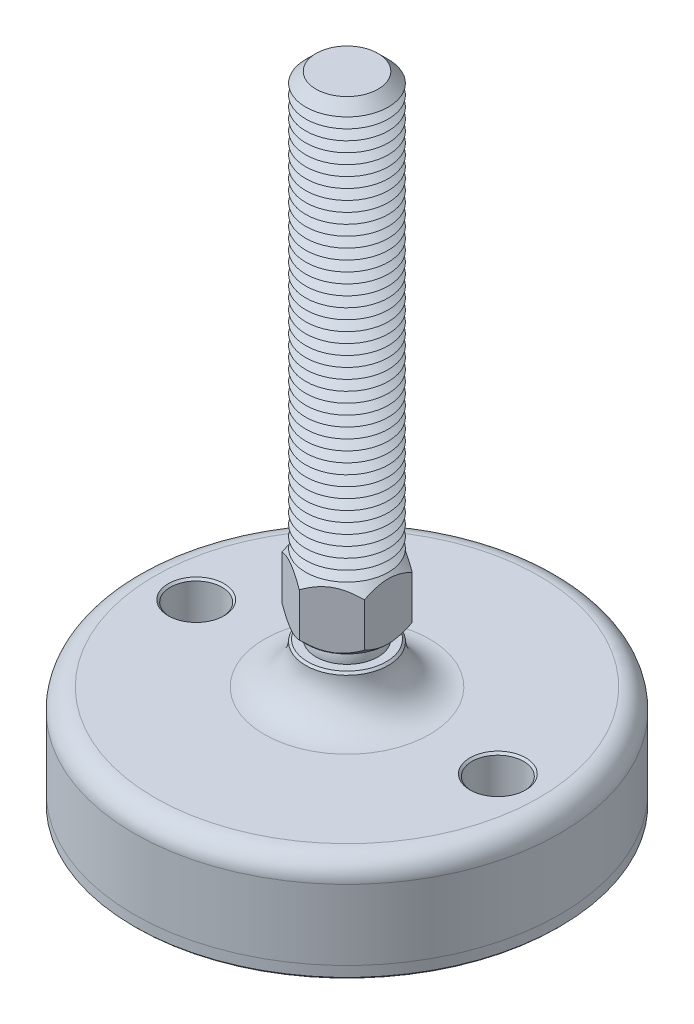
ISO-10303-21;
HEADER;
FILE_DESCRIPTION(('STEP AP214'),'2;1');
FILE_NAME('part.step','',(''),(''),'','','');
FILE_SCHEMA(('AUTOMOTIVE_DESIGN { 1 0 10303 214 1 1 1 1 }'));
ENDSEC;
DATA;
#1=APPLICATION_CONTEXT('core data for automotive mechanical design processes');
#2=APPLICATION_PROTOCOL_DEFINITION('international standard','automotive_design',2000,#1);
#3=PRODUCT_CONTEXT('',#1,'mechanical');
#4=PRODUCT('Part','Part','',(#3));
#5=PRODUCT_RELATED_PRODUCT_CATEGORY('part','',(#4));
#6=PRODUCT_DEFINITION_FORMATION('','',#4);
#7=PRODUCT_DEFINITION_CONTEXT('part definition',#1,'design');
#8=PRODUCT_DEFINITION('design','',#6,#7);
#9=PRODUCT_DEFINITION_SHAPE('','',#8);
#10=(LENGTH_UNIT() NAMED_UNIT(*) SI_UNIT(.MILLI.,.METRE.));
#11=(NAMED_UNIT(*) PLANE_ANGLE_UNIT() SI_UNIT($,.RADIAN.));
#12=(NAMED_UNIT(*) SI_UNIT($,.STERADIAN.) SOLID_ANGLE_UNIT());
#13=UNCERTAINTY_MEASURE_WITH_UNIT(LENGTH_MEASURE(1.E-05),#10,'distance_accuracy_value','');
#14=(GEOMETRIC_REPRESENTATION_CONTEXT(3) GLOBAL_UNCERTAINTY_ASSIGNED_CONTEXT((#13)) GLOBAL_UNIT_ASSIGNED_CONTEXT((#10,
#11,#12)) REPRESENTATION_CONTEXT('',''));
#15=CARTESIAN_POINT('',(0.,0.,0.));
#16=DIRECTION('',(0.,0.,1.));
#17=DIRECTION('',(1.,0.,0.));
#18=AXIS2_PLACEMENT_3D('',#15,#16,#17);
#19=CARTESIAN_POINT('',(0.,-32.,0.));
#20=DIRECTION('',(0.,1.,0.));
#21=DIRECTION('',(0.,0.,1.));
#22=AXIS2_PLACEMENT_3D('',#19,#20,#21);
#23=PLANE('',#22);
#24=CARTESIAN_POINT('',(-36.5,-32.,0.));
#25=DIRECTION('',(0.,1.,0.));
#26=DIRECTION('',(0.,0.,1.));
#27=AXIS2_PLACEMENT_3D('',#24,#25,#26);
#28=CIRCLE('',#27,6.25);
#29=CARTESIAN_POINT('',(-36.5,-32.,6.25));
#30=VERTEX_POINT('',#29);
#31=EDGE_CURVE('P0_E43',#30,#30,#28,.T.);
#32=ORIENTED_EDGE('',*,*,#31,.F.);
#33=EDGE_LOOP('',(#32));
#34=FACE_BOUND('',#33,.T.);
#35=CARTESIAN_POINT('',(36.5,-32.,0.));
#36=DIRECTION('',(0.,1.,0.));
#37=DIRECTION('',(0.,0.,1.));
#38=AXIS2_PLACEMENT_3D('',#35,#36,#37);
#39=CIRCLE('',#38,6.25);
#40=CARTESIAN_POINT('',(36.5,-32.,6.25));
#41=VERTEX_POINT('',#40);
#42=EDGE_CURVE('P0_E44',#41,#41,#39,.T.);
#43=ORIENTED_EDGE('',*,*,#42,.F.);
#44=EDGE_LOOP('',(#43));
#45=FACE_BOUND('',#44,.T.);
#46=CARTESIAN_POINT('',(0.,-32.,0.));
#47=DIRECTION('',(0.,1.,0.));
#48=DIRECTION('',(0.,0.,1.));
#49=AXIS2_PLACEMENT_3D('',#46,#47,#48);
#50=CIRCLE('',#49,51.5);
#51=CARTESIAN_POINT('',(0.,-32.,51.5));
#52=VERTEX_POINT('',#51);
#53=EDGE_CURVE('P0_E40',#52,#52,#50,.T.);
#54=ORIENTED_EDGE('',*,*,#53,.T.);
#55=EDGE_LOOP('',(#54));
#56=FACE_BOUND('',#55,.T.);
#57=ADVANCED_FACE('P0_F14',(#34,#45,#56),#23,.T.);
#58=CARTESIAN_POINT('',(0.,43.1654938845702,0.));
#59=DIRECTION('',(0.,1.,0.));
#60=DIRECTION('',(0.,0.,1.));
#61=AXIS2_PLACEMENT_3D('',#58,#59,#60);
#62=CYLINDRICAL_SURFACE('',#61,51.5);
#63=CARTESIAN_POINT('',(0.,-34.5,0.));
#64=DIRECTION('',(0.,-1.,0.));
#65=DIRECTION('',(0.,0.,-1.));
#66=AXIS2_PLACEMENT_3D('',#63,#64,#65);
#67=CIRCLE('',#66,51.5);
#68=CARTESIAN_POINT('',(0.,-34.5,-51.5));
#69=VERTEX_POINT('',#68);
#70=EDGE_CURVE('P0_E37',#69,#69,#67,.F.);
#71=ORIENTED_EDGE('',*,*,#70,.T.);
#72=EDGE_LOOP('',(#71));
#73=FACE_BOUND('',#72,.T.);
#74=ORIENTED_EDGE('',*,*,#53,.F.);
#75=EDGE_LOOP('',(#74));
#76=FACE_BOUND('',#75,.T.);
#77=ADVANCED_FACE('P0_F54',(#73,#76),#62,.T.);
#78=CARTESIAN_POINT('',(0.,-35.,51.5));
#79=DIRECTION('',(0.,-1.,0.));
#80=DIRECTION('',(0.,0.,-1.));
#81=AXIS2_PLACEMENT_3D('',#78,#79,#80);
#82=PLANE('',#81);
#83=CARTESIAN_POINT('',(36.5,-35.,0.));
#84=DIRECTION('',(0.,-1.,0.));
#85=DIRECTION('',(0.,0.,-1.));
#86=AXIS2_PLACEMENT_3D('',#83,#84,#85);
#87=CIRCLE('',#86,6.75000000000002);
#88=CARTESIAN_POINT('',(36.5,-35.,-6.75000000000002));
#89=VERTEX_POINT('',#88);
#90=EDGE_CURVE('P0_E25',#89,#89,#87,.F.);
#91=ORIENTED_EDGE('',*,*,#90,.T.);
#92=EDGE_LOOP('',(#91));
#93=FACE_BOUND('',#92,.T.);
#94=CARTESIAN_POINT('',(-36.5,-35.,0.));
#95=DIRECTION('',(0.,-1.,0.));
#96=DIRECTION('',(0.,0.,-1.));
#97=AXIS2_PLACEMENT_3D('',#94,#95,#96);
#98=CIRCLE('',#97,6.74999999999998);
#99=CARTESIAN_POINT('',(-36.5,-35.,-6.74999999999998));
#100=VERTEX_POINT('',#99);
#101=EDGE_CURVE('P0_E29',#100,#100,#98,.F.);
#102=ORIENTED_EDGE('',*,*,#101,.T.);
#103=EDGE_LOOP('',(#102));
#104=FACE_BOUND('',#103,.T.);
#105=CARTESIAN_POINT('',(0.,-35.,0.));
#106=DIRECTION('',(0.,-1.,0.));
#107=DIRECTION('',(0.,0.,-1.));
#108=AXIS2_PLACEMENT_3D('',#105,#106,#107);
#109=CIRCLE('',#108,51.);
#110=CARTESIAN_POINT('',(0.,-35.,-51.));
#111=VERTEX_POINT('',#110);
#112=EDGE_CURVE('P0_E34',#111,#111,#109,.T.);
#113=ORIENTED_EDGE('',*,*,#112,.T.);
#114=EDGE_LOOP('',(#113));
#115=FACE_BOUND('',#114,.T.);
#116=ADVANCED_FACE('P0_F61',(#93,#104,#115),#82,.T.);
#117=CARTESIAN_POINT('',(0.,-34.5,0.));
#118=DIRECTION('',(0.,1.,0.));
#119=DIRECTION('',(0.,0.,1.));
#120=AXIS2_PLACEMENT_3D('',#117,#118,#119);
#121=CONICAL_SURFACE('',#120,51.5,0.785398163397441);
#122=ORIENTED_EDGE('',*,*,#112,.F.);
#123=EDGE_LOOP('',(#122));
#124=FACE_BOUND('',#123,.T.);
#125=ORIENTED_EDGE('',*,*,#70,.F.);
#126=EDGE_LOOP('',(#125));
#127=FACE_BOUND('',#126,.T.);
#128=ADVANCED_FACE('P0_F68',(#124,#127),#121,.T.);
#129=CARTESIAN_POINT('',(36.5,-35.,0.));
#130=DIRECTION('',(0.,1.,0.));
#131=DIRECTION('',(0.,0.,1.));
#132=AXIS2_PLACEMENT_3D('',#129,#130,#131);
#133=CYLINDRICAL_SURFACE('',#132,6.25);
#134=CARTESIAN_POINT('',(36.5,-34.5,0.));
#135=DIRECTION('',(0.,-1.,0.));
#136=DIRECTION('',(0.,0.,-1.));
#137=AXIS2_PLACEMENT_3D('',#134,#135,#136);
#138=CIRCLE('',#137,6.25);
#139=CARTESIAN_POINT('',(36.5,-34.5,-6.25));
#140=VERTEX_POINT('',#139);
#141=EDGE_CURVE('P0_E21',#140,#140,#138,.T.);
#142=ORIENTED_EDGE('',*,*,#141,.T.);
#143=EDGE_LOOP('',(#142));
#144=FACE_BOUND('',#143,.T.);
#145=ORIENTED_EDGE('',*,*,#42,.T.);
#146=EDGE_LOOP('',(#145));
#147=FACE_BOUND('',#146,.T.);
#148=ADVANCED_FACE('P0_F74',(#144,#147),#133,.F.);
#149=CARTESIAN_POINT('',(-36.5,-35.,0.));
#150=DIRECTION('',(0.,1.,0.));
#151=DIRECTION('',(0.,0.,1.));
#152=AXIS2_PLACEMENT_3D('',#149,#150,#151);
#153=CYLINDRICAL_SURFACE('',#152,6.25);
#154=CARTESIAN_POINT('',(-36.5,-34.5,0.));
#155=DIRECTION('',(0.,-1.,0.));
#156=DIRECTION('',(0.,0.,-1.));
#157=AXIS2_PLACEMENT_3D('',#154,#155,#156);
#158=CIRCLE('',#157,6.25);
#159=CARTESIAN_POINT('',(-36.5,-34.5,-6.25));
#160=VERTEX_POINT('',#159);
#161=EDGE_CURVE('P0_E10',#160,#160,#158,.T.);
#162=ORIENTED_EDGE('',*,*,#161,.T.);
#163=EDGE_LOOP('',(#162));
#164=FACE_BOUND('',#163,.T.);
#165=ORIENTED_EDGE('',*,*,#31,.T.);
#166=EDGE_LOOP('',(#165));
#167=FACE_BOUND('',#166,.T.);
#168=ADVANCED_FACE('P0_F50',(#164,#167),#153,.F.);
#169=CARTESIAN_POINT('',(36.5,-35.,0.));
#170=DIRECTION('',(0.,-1.,0.));
#171=DIRECTION('',(0.,0.,-1.));
#172=AXIS2_PLACEMENT_3D('',#169,#170,#171);
#173=CONICAL_SURFACE('',#172,6.75000000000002,0.785398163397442);
#174=ORIENTED_EDGE('',*,*,#141,.F.);
#175=EDGE_LOOP('',(#174));
#176=FACE_BOUND('',#175,.T.);
#177=ORIENTED_EDGE('',*,*,#90,.F.);
#178=EDGE_LOOP('',(#177));
#179=FACE_BOUND('',#178,.T.);
#180=ADVANCED_FACE('P0_F76',(#176,#179),#173,.F.);
#181=CARTESIAN_POINT('',(-36.5,-35.,0.));
#182=DIRECTION('',(0.,-1.,0.));
#183=DIRECTION('',(0.,0.,-1.));
#184=AXIS2_PLACEMENT_3D('',#181,#182,#183);
#185=CONICAL_SURFACE('',#184,6.74999999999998,0.785398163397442);
#186=ORIENTED_EDGE('',*,*,#161,.F.);
#187=EDGE_LOOP('',(#186));
#188=FACE_BOUND('',#187,.T.);
#189=ORIENTED_EDGE('',*,*,#101,.F.);
#190=EDGE_LOOP('',(#189));
#191=FACE_BOUND('',#190,.T.);
#192=ADVANCED_FACE('P0_F16',(#188,#191),#185,.F.);
#193=CLOSED_SHELL('',(#57,#77,#116,#128,#148,#168,#180,#192));
#194=MANIFOLD_SOLID_BREP('P0_B1',#193);
#195=CARTESIAN_POINT('',(0.,3.75,0.));
#196=DIRECTION('',(0.,1.,0.));
#197=DIRECTION('',(0.,0.,1.));
#198=AXIS2_PLACEMENT_3D('',#195,#196,#197);
#199=PLANE('',#198);
#200=CARTESIAN_POINT('',(0.,3.75,0.));
#201=DIRECTION('',(0.,1.,0.));
#202=DIRECTION('',(0.,0.,1.));
#203=AXIS2_PLACEMENT_3D('',#200,#201,#202);
#204=CIRCLE('',#203,9.72829454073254);
#205=CARTESIAN_POINT('',(0.,3.75,9.72829454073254));
#206=VERTEX_POINT('',#205);
#207=EDGE_CURVE('P1_E211',#206,#206,#204,.T.);
#208=ORIENTED_EDGE('',*,*,#207,.F.);
#209=EDGE_LOOP('',(#208));
#210=FACE_BOUND('',#209,.T.);
#211=CARTESIAN_POINT('',(0.,3.75,0.));
#212=DIRECTION('',(0.,1.,0.));
#213=DIRECTION('',(0.,0.,1.));
#214=AXIS2_PLACEMENT_3D('',#211,#212,#213);
#215=CIRCLE('',#214,6.49519052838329);
#216=CARTESIAN_POINT('',(0.,3.75,6.49519052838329));
#217=VERTEX_POINT('',#216);
#218=EDGE_CURVE('P1_E24',#217,#217,#215,.F.);
#219=ORIENTED_EDGE('',*,*,#218,.F.);
#220=EDGE_LOOP('',(#219));
#221=FACE_BOUND('',#220,.T.);
#222=ADVANCED_FACE('P1_F16',(#210,#221),#199,.F.);
#223=CARTESIAN_POINT('',(0.,0.,0.));
#224=DIRECTION('',(0.,1.,0.));
#225=DIRECTION('',(0.,0.,-1.));
#226=AXIS2_PLACEMENT_3D('',#223,#224,#225);
#227=SPHERICAL_SURFACE('',#226,7.5);
#228=ORIENTED_EDGE('',*,*,#218,.T.);
#229=EDGE_LOOP('',(#228));
#230=FACE_BOUND('',#229,.T.);
#231=ADVANCED_FACE('P1_F201',(#230),#227,.T.);
#232=CARTESIAN_POINT('',(0.,3.75,0.));
#233=DIRECTION('',(0.,1.,0.));
#234=DIRECTION('',(0.,0.,1.));
#235=AXIS2_PLACEMENT_3D('',#232,#233,#234);
#236=CONICAL_SURFACE('',#235,9.72829454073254,0.785398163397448);
#237=ORIENTED_EDGE('',*,*,#207,.T.);
#238=EDGE_LOOP('',(#237));
#239=FACE_BOUND('',#238,.T.);
#240=CARTESIAN_POINT('',(-10.,9.59571642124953,-11.9394228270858));
#241=CARTESIAN_POINT('',(-10.,9.37430561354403,-11.6505452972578));
#242=CARTESIAN_POINT('',(-10.,9.15490936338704,-11.3600988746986));
#243=CARTESIAN_POINT('',(-10.,8.72106267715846,-10.7754314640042));
#244=CARTESIAN_POINT('',(-10.,8.50661343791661,-10.4812095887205));
#245=CARTESIAN_POINT('',(-10.,8.08205114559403,-9.88620330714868));
#246=CARTESIAN_POINT('',(-10.,7.87198437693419,-9.58538576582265));
#247=CARTESIAN_POINT('',(-10.,7.45926520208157,-8.97872312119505));
#248=CARTESIAN_POINT('',(-10.,7.25661228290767,-8.67287836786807));
#249=CARTESIAN_POINT('',(-10.,6.84809543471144,-8.03614350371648));
#250=CARTESIAN_POINT('',(-10.,6.64281401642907,-7.70487777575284));
#251=CARTESIAN_POINT('',(-10.,6.245142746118,-7.03457466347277));
#252=CARTESIAN_POINT('',(-10.,6.0527550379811,-6.69553599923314));
#253=CARTESIAN_POINT('',(-10.,5.68497951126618,-6.00961937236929));
#254=CARTESIAN_POINT('',(-10.,5.50954176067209,-5.66276839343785));
#255=CARTESIAN_POINT('',(-10.,5.17959635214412,-4.95932933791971));
#256=CARTESIAN_POINT('',(-10.,5.02507889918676,-4.60274591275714));
#257=CARTESIAN_POINT('',(-10.,4.75599518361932,-3.91353381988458));
#258=CARTESIAN_POINT('',(-10.,4.63902686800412,-3.58185263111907));
#259=CARTESIAN_POINT('',(-10.,4.43164927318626,-2.91013341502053));
#260=CARTESIAN_POINT('',(-10.,4.34124171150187,-2.57009484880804));
#261=CARTESIAN_POINT('',(-10.,4.19334931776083,-1.88955843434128));
#262=CARTESIAN_POINT('',(-10.,4.13527351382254,-1.54919119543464));
#263=CARTESIAN_POINT('',(-10.,4.05324021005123,-0.864347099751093));
#264=CARTESIAN_POINT('',(-10.,4.029275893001,-0.519871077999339));
#265=CARTESIAN_POINT('',(-10.,4.01745435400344,0.155191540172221));
#266=CARTESIAN_POINT('',(-10.,4.02812008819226,0.485752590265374));
#267=CARTESIAN_POINT('',(-10.,4.08160326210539,1.1442457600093));
#268=CARTESIAN_POINT('',(-10.,4.12442366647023,1.47217763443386));
#269=CARTESIAN_POINT('',(-10.,4.24054019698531,2.12859326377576));
#270=CARTESIAN_POINT('',(-10.,4.31437036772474,2.45698095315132));
#271=CARTESIAN_POINT('',(-10.,4.48844287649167,3.10654175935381));
#272=CARTESIAN_POINT('',(-10.,4.58868356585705,3.42771532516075));
#273=CARTESIAN_POINT('',(-10.,4.81839210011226,4.08271396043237));
#274=CARTESIAN_POINT('',(-10.,4.94932842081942,4.41601827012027));
#275=CARTESIAN_POINT('',(-10.,5.23140828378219,5.07403931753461));
#276=CARTESIAN_POINT('',(-10.,5.38256099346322,5.3987520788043));
#277=CARTESIAN_POINT('',(-10.,5.70148727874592,6.04113299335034));
#278=CARTESIAN_POINT('',(-10.,5.86931223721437,6.35877542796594));
#279=CARTESIAN_POINT('',(-10.,6.21788686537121,6.98677627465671));
#280=CARTESIAN_POINT('',(-10.,6.39863453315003,7.29713580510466));
#281=CARTESIAN_POINT('',(-10.,6.76133545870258,7.89633938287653));
#282=CARTESIAN_POINT('',(-10.,6.94278731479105,8.18548854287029));
#283=CARTESIAN_POINT('',(-10.,7.31339871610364,8.75881961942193));
#284=CARTESIAN_POINT('',(-10.,7.50255884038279,9.04300116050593));
#285=CARTESIAN_POINT('',(-10.,7.8856676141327,9.6047584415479));
#286=CARTESIAN_POINT('',(-10.,8.07956548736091,9.88236893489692));
#287=CARTESIAN_POINT('',(-10.,8.47254700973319,10.4337838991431));
#288=CARTESIAN_POINT('',(-10.,8.67162921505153,10.7075893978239));
#289=CARTESIAN_POINT('',(-10.,8.87283307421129,10.9797992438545));
#290=B_SPLINE_CURVE_WITH_KNOTS('',3,(#240,#241,#242,#243,#244,#245,#246,#247,#248,#249,#250,
#251,#252,#253,#254,#255,#256,#257,#258,#259,#260,#261,#262,#263,#264,#265,#266,#267,#268,#269,
#270,#271,#272,#273,#274,#275,#276,#277,#278,#279,#280,#281,#282,#283,#284,#285,#286,#287,#288,
#289),.UNSPECIFIED.,.F.,.F.,(4,2,2,2,2,2,2,2,2,2,2,2,2,2,2,2,2,2,2,2,2,2,2,2,4),(0.,
1.09192545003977,2.18411235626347,3.28473497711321,4.3852812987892,5.5541916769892,
6.72329593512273,7.88884387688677,9.05384420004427,10.1080362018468,11.1622963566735,
12.1965943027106,13.2306855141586,14.2212593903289,15.2119246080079,16.2203997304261,
17.2288119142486,18.3022883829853,19.3762532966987,20.4536373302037,21.5308548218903,
22.5548150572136,23.5788523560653,24.5946500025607,25.6101677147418),.UNSPECIFIED.);
#291=CARTESIAN_POINT('',(-10.,5.56871084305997,-5.77350269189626));
#292=VERTEX_POINT('',#291);
#293=CARTESIAN_POINT('',(-10.,5.56871084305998,5.77350269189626));
#294=VERTEX_POINT('',#293);
#295=EDGE_CURVE('P1_E185',#292,#294,#290,.T.);
#296=ORIENTED_EDGE('',*,*,#295,.F.);
#297=CARTESIAN_POINT('',(0.000199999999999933,5.56882631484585,-11.5471208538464));
#298=CARTESIAN_POINT('',(-0.171722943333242,5.4695807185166,-11.447861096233));
#299=CARTESIAN_POINT('',(-0.344992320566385,5.37336355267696,-11.3478239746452));
#300=CARTESIAN_POINT('',(-0.694433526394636,5.18794806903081,-11.1460740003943));
#301=CARTESIAN_POINT('',(-0.870606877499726,5.09875358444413,-11.0443602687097));
#302=CARTESIAN_POINT('',(-1.22689656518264,4.92796770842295,-10.8386563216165));
#303=CARTESIAN_POINT('',(-1.40702970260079,4.84642277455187,-10.7346564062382));
#304=CARTESIAN_POINT('',(-1.77025459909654,4.69270708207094,-10.52494841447));
#305=CARTESIAN_POINT('',(-1.95334590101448,4.62053489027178,-10.4192406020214));
#306=CARTESIAN_POINT('',(-2.31954331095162,4.4878482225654,-10.2078164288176));
#307=CARTESIAN_POINT('',(-2.50260441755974,4.42716910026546,-10.1021260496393));
#308=CARTESIAN_POINT('',(-2.87129282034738,4.31731511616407,-9.88926370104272));
#309=CARTESIAN_POINT('',(-3.05691983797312,4.26813901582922,-9.78209189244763));
#310=CARTESIAN_POINT('',(-3.42994608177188,4.1825291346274,-9.56672509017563));
#311=CARTESIAN_POINT('',(-3.61734032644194,4.14606667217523,-9.45853297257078));
#312=CARTESIAN_POINT('',(-3.99370204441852,4.08668528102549,-9.24124043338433));
#313=CARTESIAN_POINT('',(-4.1826692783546,4.06376432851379,-9.13214015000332));
#314=CARTESIAN_POINT('',(-4.64316633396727,4.0253323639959,-8.86627205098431));
#315=CARTESIAN_POINT('',(-4.91519388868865,4.01726744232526,-8.70921686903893));
#316=CARTESIAN_POINT('',(-5.45875701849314,4.03080424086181,-8.39539054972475));
#317=CARTESIAN_POINT('',(-5.7302923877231,4.05241636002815,-8.23861953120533));
#318=CARTESIAN_POINT('',(-6.27080349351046,4.12403157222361,-7.92655529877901));
#319=CARTESIAN_POINT('',(-6.53977602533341,4.17406641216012,-7.77126393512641));
#320=CARTESIAN_POINT('',(-7.07309796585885,4.29980733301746,-7.46335036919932));
#321=CARTESIAN_POINT('',(-7.33744772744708,4.3755114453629,-7.31072796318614));
#322=CARTESIAN_POINT('',(-7.80670351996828,4.53125365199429,-7.03980300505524));
#323=CARTESIAN_POINT('',(-8.01264886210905,4.60719488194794,-6.92090040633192));
#324=CARTESIAN_POINT('',(-8.42084280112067,4.77131434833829,-6.68522952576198));
#325=CARTESIAN_POINT('',(-8.62309128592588,4.85949295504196,-6.5684613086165));
#326=CARTESIAN_POINT('',(-9.02325448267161,5.04611070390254,-6.33742697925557));
#327=CARTESIAN_POINT('',(-9.22118057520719,5.1445175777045,-6.2231542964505));
#328=CARTESIAN_POINT('',(-9.61336795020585,5.35030005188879,-5.99672480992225));
#329=CARTESIAN_POINT('',(-9.80763139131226,5.45767015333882,-5.88456675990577));
#330=CARTESIAN_POINT('',(-10.0002,5.56882631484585,-5.77338722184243));
#331=B_SPLINE_CURVE_WITH_KNOTS('',3,(#297,#298,#299,#300,#301,#302,#303,#304,#305,#306,#307,
#308,#309,#310,#311,#312,#313,#314,#315,#316,#317,#318,#319,#320,#321,#322,#323,#324,#325,#326,
#327,#328,#329,#330),.UNSPECIFIED.,.F.,.F.,(4,2,2,2,2,2,2,2,2,2,2,2,2,2,2,2,4),(0.,
0.665863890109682,1.33208874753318,2.00212824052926,2.67206515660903,3.33152613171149,
3.99091606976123,4.64880867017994,5.30660292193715,6.24777541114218,7.18927777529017,
8.13183382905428,9.07431761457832,9.82287578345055,10.5714566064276,11.3177436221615,
12.0635761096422),.UNSPECIFIED.);
#332=CARTESIAN_POINT('',(0.,5.56871084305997,-11.5470053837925));
#333=VERTEX_POINT('',#332);
#334=EDGE_CURVE('P1_E179',#333,#292,#331,.T.);
#335=ORIENTED_EDGE('',*,*,#334,.F.);
#336=CARTESIAN_POINT('',(10.0002,5.56882631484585,-5.77338722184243));
#337=CARTESIAN_POINT('',(9.82827705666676,5.4695807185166,-5.87264697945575));
#338=CARTESIAN_POINT('',(9.65500767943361,5.37336355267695,-5.97268410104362));
#339=CARTESIAN_POINT('',(9.30556647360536,5.18794806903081,-6.17443407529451));
#340=CARTESIAN_POINT('',(9.12939312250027,5.09875358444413,-6.27614780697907));
#341=CARTESIAN_POINT('',(8.77310343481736,4.92796770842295,-6.48185175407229));
#342=CARTESIAN_POINT('',(8.59297029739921,4.84642277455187,-6.58585166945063));
#343=CARTESIAN_POINT('',(8.22974540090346,4.69270708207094,-6.79555966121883));
#344=CARTESIAN_POINT('',(8.04665409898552,4.62053489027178,-6.90126747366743));
#345=CARTESIAN_POINT('',(7.68045668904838,4.4878482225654,-7.11269164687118));
#346=CARTESIAN_POINT('',(7.49739558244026,4.42716910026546,-7.21838202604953));
#347=CARTESIAN_POINT('',(7.12870717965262,4.31731511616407,-7.43124437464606));
#348=CARTESIAN_POINT('',(6.94308016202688,4.26813901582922,-7.53841618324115));
#349=CARTESIAN_POINT('',(6.57005391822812,4.1825291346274,-7.75378298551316));
#350=CARTESIAN_POINT('',(6.38265967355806,4.14606667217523,-7.861975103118));
#351=CARTESIAN_POINT('',(6.00629795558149,4.08668528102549,-8.07926764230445));
#352=CARTESIAN_POINT('',(5.81733072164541,4.06376432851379,-8.18836792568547));
#353=CARTESIAN_POINT('',(5.35683366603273,4.0253323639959,-8.45423602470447));
#354=CARTESIAN_POINT('',(5.08480611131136,4.01726744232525,-8.61129120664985));
#355=CARTESIAN_POINT('',(4.54124298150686,4.03080424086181,-8.92511752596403));
#356=CARTESIAN_POINT('',(4.2697076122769,4.05241636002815,-9.08188854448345));
#357=CARTESIAN_POINT('',(3.72919650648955,4.12403157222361,-9.39395277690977));
#358=CARTESIAN_POINT('',(3.46022397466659,4.17406641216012,-9.54924414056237));
#359=CARTESIAN_POINT('',(2.92690203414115,4.29980733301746,-9.85715770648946));
#360=CARTESIAN_POINT('',(2.66255227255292,4.37551144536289,-10.0097801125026));
#361=CARTESIAN_POINT('',(2.19329648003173,4.53125365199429,-10.2807050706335));
#362=CARTESIAN_POINT('',(1.98735113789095,4.60719488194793,-10.3996076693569));
#363=CARTESIAN_POINT('',(1.57915719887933,4.77131434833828,-10.6352785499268));
#364=CARTESIAN_POINT('',(1.37690871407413,4.85949295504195,-10.7520467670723));
#365=CARTESIAN_POINT('',(0.976745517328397,5.04611070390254,-10.9830810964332));
#366=CARTESIAN_POINT('',(0.77881942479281,5.1445175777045,-11.0973537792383));
#367=CARTESIAN_POINT('',(0.386632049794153,5.35030005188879,-11.3237832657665));
#368=CARTESIAN_POINT('',(0.192368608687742,5.45767015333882,-11.435941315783));
#369=CARTESIAN_POINT('',(-0.000199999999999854,5.56882631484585,-11.5471208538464));
#370=B_SPLINE_CURVE_WITH_KNOTS('',3,(#336,#337,#338,#339,#340,#341,#342,#343,#344,#345,#346,
#347,#348,#349,#350,#351,#352,#353,#354,#355,#356,#357,#358,#359,#360,#361,#362,#363,#364,#365,
#366,#367,#368,#369),.UNSPECIFIED.,.F.,.F.,(4,2,2,2,2,2,2,2,2,2,2,2,2,2,2,2,4),(0.,
0.665863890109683,1.33208874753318,2.00212824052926,2.67206515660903,3.33152613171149,
3.99091606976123,4.64880867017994,5.30660292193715,6.24777541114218,7.18927777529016,
8.13183382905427,9.07431761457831,9.82287578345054,10.5714566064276,11.3177436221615,
12.0635761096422),.UNSPECIFIED.);
#371=CARTESIAN_POINT('',(9.99999999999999,5.56871084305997,-5.77350269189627));
#372=VERTEX_POINT('',#371);
#373=EDGE_CURVE('P1_E167',#372,#333,#370,.T.);
#374=ORIENTED_EDGE('',*,*,#373,.F.);
#375=CARTESIAN_POINT('',(10.,9.59571642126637,-11.9394228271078));
#376=CARTESIAN_POINT('',(10.,9.37430561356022,-11.6505452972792));
#377=CARTESIAN_POINT('',(10.,9.15490936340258,-11.3600988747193));
#378=CARTESIAN_POINT('',(10.,8.7210626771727,-10.7754314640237));
#379=CARTESIAN_POINT('',(10.,8.5066134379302,-10.4812095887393));
#380=CARTESIAN_POINT('',(10.,8.08205114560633,-9.88620330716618));
#381=CARTESIAN_POINT('',(10.,7.87198437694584,-9.58538576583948));
#382=CARTESIAN_POINT('',(10.,7.45926520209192,-8.97872312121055));
#383=CARTESIAN_POINT('',(10.,7.25661228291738,-8.67287836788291));
#384=CARTESIAN_POINT('',(10.,6.84809543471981,-8.03614350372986));
#385=CARTESIAN_POINT('',(10.,6.64281401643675,-7.70487777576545));
#386=CARTESIAN_POINT('',(10.,6.24514274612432,-7.03457466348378));
#387=CARTESIAN_POINT('',(10.,6.05275503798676,-6.69553599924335));
#388=CARTESIAN_POINT('',(10.,5.68497951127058,-6.00961937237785));
#389=CARTESIAN_POINT('',(10.,5.50954176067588,-5.66276839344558));
#390=CARTESIAN_POINT('',(10.,5.17959635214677,-4.95932933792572));
#391=CARTESIAN_POINT('',(10.,5.02507889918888,-4.60274591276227));
#392=CARTESIAN_POINT('',(10.,4.75599518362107,-3.91353381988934));
#393=CARTESIAN_POINT('',(10.,4.63902686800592,-3.58185263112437));
#394=CARTESIAN_POINT('',(10.,4.43164927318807,-2.91013341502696));
#395=CARTESIAN_POINT('',(10.,4.34124171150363,-2.57009484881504));
#396=CARTESIAN_POINT('',(10.,4.19334931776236,-1.8895584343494));
#397=CARTESIAN_POINT('',(10.,4.13527351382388,-1.54919119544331));
#398=CARTESIAN_POINT('',(10.,4.05324021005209,-0.86434709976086));
#399=CARTESIAN_POINT('',(10.,4.02927589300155,-0.519871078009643));
#400=CARTESIAN_POINT('',(10.,4.01745435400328,0.155191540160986));
#401=CARTESIAN_POINT('',(10.,4.0281200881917,0.485752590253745));
#402=CARTESIAN_POINT('',(10.,4.08160326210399,1.14424575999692));
#403=CARTESIAN_POINT('',(10.,4.12442366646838,1.47217763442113));
#404=CARTESIAN_POINT('',(10.,4.24054019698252,2.12859326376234));
#405=CARTESIAN_POINT('',(10.,4.31437036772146,2.45698095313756));
#406=CARTESIAN_POINT('',(10.,4.48844287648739,3.1065417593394));
#407=CARTESIAN_POINT('',(10.,4.58868356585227,3.42771532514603));
#408=CARTESIAN_POINT('',(10.,4.81839210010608,4.08271396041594));
#409=CARTESIAN_POINT('',(10.,4.94932842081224,4.41601827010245));
#410=CARTESIAN_POINT('',(10.,5.23140828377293,5.0740393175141));
#411=CARTESIAN_POINT('',(10.,5.38256099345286,5.39875207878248));
#412=CARTESIAN_POINT('',(10.,5.70148727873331,6.04113299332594));
#413=CARTESIAN_POINT('',(10.,5.86931223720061,6.35877542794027));
#414=CARTESIAN_POINT('',(10.,6.21788686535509,6.98677627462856));
#415=CARTESIAN_POINT('',(10.,6.39863453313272,7.29713580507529));
#416=CARTESIAN_POINT('',(10.,6.761335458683,7.89633938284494));
#417=CARTESIAN_POINT('',(10.,6.9427873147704,8.18548854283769));
#418=CARTESIAN_POINT('',(10.,7.31339871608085,8.75881961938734));
#419=CARTESIAN_POINT('',(10.,7.50255884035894,9.04300116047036));
#420=CARTESIAN_POINT('',(10.,7.88566761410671,9.60475844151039));
#421=CARTESIAN_POINT('',(10.,8.07956548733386,9.88236893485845));
#422=CARTESIAN_POINT('',(10.,8.47254700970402,10.4337838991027));
#423=CARTESIAN_POINT('',(10.,8.6716292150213,10.7075893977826));
#424=CARTESIAN_POINT('',(10.,8.87283307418,10.9797992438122));
#425=B_SPLINE_CURVE_WITH_KNOTS('',3,(#375,#376,#377,#378,#379,#380,#381,#382,#383,#384,#385,
#386,#387,#388,#389,#390,#391,#392,#393,#394,#395,#396,#397,#398,#399,#400,#401,#402,#403,#404,
#405,#406,#407,#408,#409,#410,#411,#412,#413,#414,#415,#416,#417,#418,#419,#420,#421,#422,#423,
#424),.UNSPECIFIED.,.F.,.F.,(4,2,2,2,2,2,2,2,2,2,2,2,2,2,2,2,2,2,2,2,2,2,2,2,4),(0.,
1.09192545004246,2.18411235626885,3.28473497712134,4.38528129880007,5.55419167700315,
6.72329593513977,7.88884387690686,9.05384420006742,10.1080362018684,11.1622963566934,
12.196594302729,13.2306855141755,14.2212593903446,15.2119246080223,16.2203997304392,
17.2288119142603,18.3022883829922,19.3762532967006,20.4536373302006,21.5308548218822,
22.5548150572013,23.5788523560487,24.5946500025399,25.6101677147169),.UNSPECIFIED.);
#426=CARTESIAN_POINT('',(10.,5.56871084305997,5.77350269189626));
#427=VERTEX_POINT('',#426);
#428=EDGE_CURVE('P1_E70',#427,#372,#425,.F.);
#429=ORIENTED_EDGE('',*,*,#428,.F.);
#430=CARTESIAN_POINT('',(-0.000200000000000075,5.56882631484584,11.5471208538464));
#431=CARTESIAN_POINT('',(0.171722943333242,5.4695807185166,11.447861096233));
#432=CARTESIAN_POINT('',(0.344992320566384,5.37336355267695,11.3478239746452));
#433=CARTESIAN_POINT('',(0.694433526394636,5.18794806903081,11.1460740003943));
#434=CARTESIAN_POINT('',(0.870606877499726,5.09875358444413,11.0443602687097));
#435=CARTESIAN_POINT('',(1.22689656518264,4.92796770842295,10.8386563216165));
#436=CARTESIAN_POINT('',(1.40702970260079,4.84642277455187,10.7346564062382));
#437=CARTESIAN_POINT('',(1.77025459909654,4.69270708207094,10.52494841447));
#438=CARTESIAN_POINT('',(1.95334590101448,4.62053489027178,10.4192406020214));
#439=CARTESIAN_POINT('',(2.31954331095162,4.4878482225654,10.2078164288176));
#440=CARTESIAN_POINT('',(2.50260441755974,4.42716910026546,10.1021260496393));
#441=CARTESIAN_POINT('',(2.87129282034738,4.31731511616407,9.88926370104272));
#442=CARTESIAN_POINT('',(3.05691983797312,4.26813901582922,9.78209189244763));
#443=CARTESIAN_POINT('',(3.42994608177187,4.18252913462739,9.56672509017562));
#444=CARTESIAN_POINT('',(3.61734032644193,4.14606667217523,9.45853297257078));
#445=CARTESIAN_POINT('',(3.99370204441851,4.08668528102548,9.24124043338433));
#446=CARTESIAN_POINT('',(4.18266927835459,4.06376432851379,9.13214015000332));
#447=CARTESIAN_POINT('',(4.64316633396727,4.0253323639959,8.86627205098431));
#448=CARTESIAN_POINT('',(4.91519388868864,4.01726744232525,8.70921686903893));
#449=CARTESIAN_POINT('',(5.45875701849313,4.03080424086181,8.39539054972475));
#450=CARTESIAN_POINT('',(5.7302923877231,4.05241636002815,8.23861953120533));
#451=CARTESIAN_POINT('',(6.27080349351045,4.1240315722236,7.92655529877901));
#452=CARTESIAN_POINT('',(6.53977602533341,4.17406641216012,7.77126393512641));
#453=CARTESIAN_POINT('',(7.07309796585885,4.29980733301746,7.46335036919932));
#454=CARTESIAN_POINT('',(7.33744772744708,4.37551144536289,7.31072796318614));
#455=CARTESIAN_POINT('',(7.80670351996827,4.53125365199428,7.03980300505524));
#456=CARTESIAN_POINT('',(8.01264886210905,4.60719488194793,6.92090040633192));
#457=CARTESIAN_POINT('',(8.42084280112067,4.77131434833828,6.68522952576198));
#458=CARTESIAN_POINT('',(8.62309128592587,4.85949295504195,6.5684613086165));
#459=CARTESIAN_POINT('',(9.0232544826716,5.04611070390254,6.33742697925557));
#460=CARTESIAN_POINT('',(9.22118057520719,5.1445175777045,6.2231542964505));
#461=CARTESIAN_POINT('',(9.61336795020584,5.35030005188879,5.99672480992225));
#462=CARTESIAN_POINT('',(9.80763139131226,5.45767015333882,5.88456675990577));
#463=CARTESIAN_POINT('',(10.0002,5.56882631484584,5.77338722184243));
#464=B_SPLINE_CURVE_WITH_KNOTS('',3,(#430,#431,#432,#433,#434,#435,#436,#437,#438,#439,#440,
#441,#442,#443,#444,#445,#446,#447,#448,#449,#450,#451,#452,#453,#454,#455,#456,#457,#458,#459,
#460,#461,#462,#463),.UNSPECIFIED.,.F.,.F.,(4,2,2,2,2,2,2,2,2,2,2,2,2,2,2,2,4),(0.,
0.665863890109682,1.33208874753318,2.00212824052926,2.67206515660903,3.33152613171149,
3.99091606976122,4.64880867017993,5.30660292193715,6.24777541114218,7.18927777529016,
8.13183382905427,9.07431761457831,9.82287578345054,10.5714566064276,11.3177436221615,
12.0635761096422),.UNSPECIFIED.);
#465=CARTESIAN_POINT('',(0.,5.56871084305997,11.5470053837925));
#466=VERTEX_POINT('',#465);
#467=EDGE_CURVE('P1_E67',#466,#427,#464,.T.);
#468=ORIENTED_EDGE('',*,*,#467,.F.);
#469=CARTESIAN_POINT('',(-10.0002,5.56882631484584,5.77338722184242));
#470=CARTESIAN_POINT('',(-9.82827705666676,5.4695807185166,5.87264697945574));
#471=CARTESIAN_POINT('',(-9.65500767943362,5.37336355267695,5.97268410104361));
#472=CARTESIAN_POINT('',(-9.30556647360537,5.18794806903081,6.1744340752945));
#473=CARTESIAN_POINT('',(-9.12939312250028,5.09875358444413,6.27614780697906));
#474=CARTESIAN_POINT('',(-8.77310343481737,4.92796770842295,6.48185175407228));
#475=CARTESIAN_POINT('',(-8.59297029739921,4.84642277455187,6.58585166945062));
#476=CARTESIAN_POINT('',(-8.22974540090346,4.69270708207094,6.79555966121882));
#477=CARTESIAN_POINT('',(-8.04665409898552,4.62053489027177,6.90126747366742));
#478=CARTESIAN_POINT('',(-7.68045668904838,4.48784822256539,7.11269164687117));
#479=CARTESIAN_POINT('',(-7.49739558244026,4.42716910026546,7.21838202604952));
#480=CARTESIAN_POINT('',(-7.12870717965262,4.31731511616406,7.43124437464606));
#481=CARTESIAN_POINT('',(-6.94308016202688,4.26813901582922,7.53841618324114));
#482=CARTESIAN_POINT('',(-6.57005391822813,4.18252913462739,7.75378298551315));
#483=CARTESIAN_POINT('',(-6.38265967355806,4.14606667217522,7.861975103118));
#484=CARTESIAN_POINT('',(-6.00629795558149,4.08668528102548,8.07926764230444));
#485=CARTESIAN_POINT('',(-5.81733072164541,4.06376432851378,8.18836792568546));
#486=CARTESIAN_POINT('',(-5.35683366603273,4.0253323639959,8.45423602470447));
#487=CARTESIAN_POINT('',(-5.08480611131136,4.01726744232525,8.61129120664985));
#488=CARTESIAN_POINT('',(-4.54124298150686,4.0308042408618,8.92511752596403));
#489=CARTESIAN_POINT('',(-4.2697076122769,4.05241636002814,9.08188854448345));
#490=CARTESIAN_POINT('',(-3.72919650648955,4.1240315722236,9.39395277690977));
#491=CARTESIAN_POINT('',(-3.46022397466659,4.17406641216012,9.54924414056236));
#492=CARTESIAN_POINT('',(-2.92690203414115,4.29980733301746,9.85715770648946));
#493=CARTESIAN_POINT('',(-2.66255227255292,4.37551144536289,10.0097801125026));
#494=CARTESIAN_POINT('',(-2.19329648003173,4.53125365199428,10.2807050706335));
#495=CARTESIAN_POINT('',(-1.98735113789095,4.60719488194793,10.3996076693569));
#496=CARTESIAN_POINT('',(-1.57915719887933,4.77131434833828,10.6352785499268));
#497=CARTESIAN_POINT('',(-1.37690871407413,4.85949295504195,10.7520467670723));
#498=CARTESIAN_POINT('',(-0.976745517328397,5.04611070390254,10.9830810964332));
#499=CARTESIAN_POINT('',(-0.778819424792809,5.1445175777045,11.0973537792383));
#500=CARTESIAN_POINT('',(-0.386632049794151,5.35030005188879,11.3237832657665));
#501=CARTESIAN_POINT('',(-0.192368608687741,5.45767015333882,11.435941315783));
#502=CARTESIAN_POINT('',(0.000199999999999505,5.56882631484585,11.5471208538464));
#503=B_SPLINE_CURVE_WITH_KNOTS('',3,(#469,#470,#471,#472,#473,#474,#475,#476,#477,#478,#479,
#480,#481,#482,#483,#484,#485,#486,#487,#488,#489,#490,#491,#492,#493,#494,#495,#496,#497,#498,
#499,#500,#501,#502),.UNSPECIFIED.,.F.,.F.,(4,2,2,2,2,2,2,2,2,2,2,2,2,2,2,2,4),(0.,
0.665863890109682,1.33208874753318,2.00212824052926,2.67206515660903,3.33152613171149,
3.99091606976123,4.64880867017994,5.30660292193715,6.24777541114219,7.18927777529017,
8.13183382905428,9.07431761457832,9.82287578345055,10.5714566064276,11.3177436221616,
12.0635761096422),.UNSPECIFIED.);
#504=EDGE_CURVE('P1_E39',#294,#466,#503,.T.);
#505=ORIENTED_EDGE('',*,*,#504,.F.);
#506=EDGE_LOOP('',(#296,#335,#374,#429,#468,#505));
#507=FACE_BOUND('',#506,.T.);
#508=ADVANCED_FACE('P1_F68',(#239,#507),#236,.T.);
#509=CARTESIAN_POINT('',(-10.,19.,-5.77350269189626));
#510=DIRECTION('',(1.,0.,0.));
#511=DIRECTION('',(0.,0.,-1.));
#512=AXIS2_PLACEMENT_3D('',#509,#510,#511);
#513=PLANE('',#512);
#514=DIRECTION('',(0.,-1.,0.));
#515=VECTOR('',#514,1.);
#516=CARTESIAN_POINT('',(-10.,19.,5.77350269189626));
#517=LINE('',#516,#515);
#518=CARTESIAN_POINT('',(-10.,16.1132486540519,5.77350269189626));
#519=VERTEX_POINT('',#518);
#520=EDGE_CURVE('P1_E83',#519,#294,#517,.T.);
#521=ORIENTED_EDGE('',*,*,#520,.F.);
#522=CARTESIAN_POINT('',(-10.,12.4093918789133,-11.5147208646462));
#523=CARTESIAN_POINT('',(-10.,12.6210295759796,-11.2343500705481));
#524=CARTESIAN_POINT('',(-10.,12.8306215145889,-10.9524094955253));
#525=CARTESIAN_POINT('',(-10.,13.2447979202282,-10.3847695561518));
#526=CARTESIAN_POINT('',(-10.,13.4493811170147,-10.0990692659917));
#527=CARTESIAN_POINT('',(-10.,13.8540786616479,-9.52120077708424));
#528=CARTESIAN_POINT('',(-10.,14.0541461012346,-9.22899961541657));
#529=CARTESIAN_POINT('',(-10.,14.4468132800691,-8.63963749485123));
#530=CARTESIAN_POINT('',(-10.,14.6394135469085,-8.34247688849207));
#531=CARTESIAN_POINT('',(-10.,15.0262335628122,-7.72525702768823));
#532=CARTESIAN_POINT('',(-10.,15.2199166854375,-7.40485974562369));
#533=CARTESIAN_POINT('',(-10.,15.5945399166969,-6.75658646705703));
#534=CARTESIAN_POINT('',(-10.,15.7754780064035,-6.4287092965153));
#535=CARTESIAN_POINT('',(-10.,16.1207071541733,-5.76550673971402));
#536=CARTESIAN_POINT('',(-10.,16.285047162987,-5.43020703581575));
#537=CARTESIAN_POINT('',(-10.,16.5934011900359,-4.75046311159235));
#538=CARTESIAN_POINT('',(-10.,16.7374244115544,-4.40602311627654));
#539=CARTESIAN_POINT('',(-10.,16.9894496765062,-3.73558113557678));
#540=CARTESIAN_POINT('',(-10.,17.0994177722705,-3.41032595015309));
#541=CARTESIAN_POINT('',(-10.,17.2932601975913,-2.75198473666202));
#542=CARTESIAN_POINT('',(-10.,17.377132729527,-2.4188981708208));
#543=CARTESIAN_POINT('',(-10.,17.5130086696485,-1.7524231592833));
#544=CARTESIAN_POINT('',(-10.,17.565558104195,-1.41914787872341));
#545=CARTESIAN_POINT('',(-10.,17.6377678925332,-0.749034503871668));
#546=CARTESIAN_POINT('',(-10.,17.6574338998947,-0.412197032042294));
#547=CARTESIAN_POINT('',(-10.,17.6624162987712,0.249527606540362));
#548=CARTESIAN_POINT('',(-10.,17.6489502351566,0.574406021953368));
#549=CARTESIAN_POINT('',(-10.,17.5910984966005,1.22138001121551));
#550=CARTESIAN_POINT('',(-10.,17.5467098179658,1.54347531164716));
#551=CARTESIAN_POINT('',(-10.,17.4286795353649,2.18799750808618));
#552=CARTESIAN_POINT('',(-10.,17.3545401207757,2.51033177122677));
#553=CARTESIAN_POINT('',(-10.,17.180962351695,3.14797698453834));
#554=CARTESIAN_POINT('',(-10.,17.0815261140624,3.46328851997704));
#555=CARTESIAN_POINT('',(-10.,16.8512186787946,4.11544298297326));
#556=CARTESIAN_POINT('',(-10.,16.7182795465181,4.45154819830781));
#557=CARTESIAN_POINT('',(-10.,16.431992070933,5.115028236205));
#558=CARTESIAN_POINT('',(-10.,16.2786342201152,5.4423989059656));
#559=CARTESIAN_POINT('',(-10.,15.9551580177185,6.09000973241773));
#560=CARTESIAN_POINT('',(-10.,15.7849870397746,6.41022338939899));
#561=CARTESIAN_POINT('',(-10.,15.4316458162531,7.04328175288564));
#562=CARTESIAN_POINT('',(-10.,15.2484776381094,7.35612762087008));
#563=CARTESIAN_POINT('',(-10.,14.8810750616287,7.96002022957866));
#564=CARTESIAN_POINT('',(-10.,14.6973474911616,8.25137695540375));
#565=CARTESIAN_POINT('',(-10.,14.3221662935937,8.82908851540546));
#566=CARTESIAN_POINT('',(-10.,14.1307120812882,9.1154429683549));
#567=CARTESIAN_POINT('',(-10.,13.7430400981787,9.68148259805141));
#568=CARTESIAN_POINT('',(-10.,13.5468736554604,9.96120305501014));
#569=CARTESIAN_POINT('',(-10.,13.149353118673,10.5168212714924));
#570=CARTESIAN_POINT('',(-10.,12.9480004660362,10.7927200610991));
#571=CARTESIAN_POINT('',(-10.,12.7445274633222,11.0670185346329));
#572=B_SPLINE_CURVE_WITH_KNOTS('',3,(#522,#523,#524,#525,#526,#527,#528,#529,#530,#531,#532,
#533,#534,#535,#536,#537,#538,#539,#540,#541,#542,#543,#544,#545,#546,#547,#548,#549,#550,#551,
#552,#553,#554,#555,#556,#557,#558,#559,#560,#561,#562,#563,#564,#565,#566,#567,#568,#569,#570,
#571),.UNSPECIFIED.,.F.,.F.,(4,2,2,2,2,2,2,2,2,2,2,2,2,2,2,2,2,2,2,2,2,2,2,2,4),(0.,
1.05386365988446,2.10799187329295,3.17028777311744,4.23250847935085,5.35544154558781,
6.47855209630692,7.5982472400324,8.71743353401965,9.74655549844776,10.7757483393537,
11.7864315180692,12.7969409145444,13.7708741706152,14.7449020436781,15.7359570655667,
16.7269291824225,17.8104078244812,18.8943927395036,19.981885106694,21.0692048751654,
22.1024062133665,23.1356859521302,24.1605722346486,25.1851766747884),.UNSPECIFIED.);
#573=CARTESIAN_POINT('',(-10.,16.1132486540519,-5.77350269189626));
#574=VERTEX_POINT('',#573);
#575=EDGE_CURVE('P1_E84',#519,#574,#572,.F.);
#576=ORIENTED_EDGE('',*,*,#575,.T.);
#577=DIRECTION('',(0.,-1.,0.));
#578=VECTOR('',#577,1.);
#579=CARTESIAN_POINT('',(-10.,19.,-5.77350269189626));
#580=LINE('',#579,#578);
#581=EDGE_CURVE('P1_E100',#574,#292,#580,.T.);
#582=ORIENTED_EDGE('',*,*,#581,.T.);
#583=ORIENTED_EDGE('',*,*,#295,.T.);
#584=EDGE_LOOP('',(#521,#576,#582,#583));
#585=FACE_BOUND('',#584,.T.);
#586=ADVANCED_FACE('P1_F193',(#585),#513,.F.);
#587=CARTESIAN_POINT('',(0.,19.,-11.5470053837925));
#588=DIRECTION('',(0.5,0.,0.866025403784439));
#589=DIRECTION('',(0.866025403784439,0.,-0.5));
#590=AXIS2_PLACEMENT_3D('',#587,#588,#589);
#591=PLANE('',#590);
#592=ORIENTED_EDGE('',*,*,#581,.F.);
#593=CARTESIAN_POINT('',(-10.0002,16.113133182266,-5.77338722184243));
#594=CARTESIAN_POINT('',(-9.82827705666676,16.2123787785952,-5.87264697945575));
#595=CARTESIAN_POINT('',(-9.65500767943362,16.3085959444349,-5.97268410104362));
#596=CARTESIAN_POINT('',(-9.30556647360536,16.494011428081,-6.17443407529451));
#597=CARTESIAN_POINT('',(-9.12939312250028,16.5832059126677,-6.27614780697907));
#598=CARTESIAN_POINT('',(-8.77310343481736,16.7539917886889,-6.48185175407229));
#599=CARTESIAN_POINT('',(-8.59297029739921,16.83553672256,-6.58585166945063));
#600=CARTESIAN_POINT('',(-8.22974540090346,16.9892524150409,-6.79555966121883));
#601=CARTESIAN_POINT('',(-8.04665409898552,17.0614246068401,-6.90126747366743));
#602=CARTESIAN_POINT('',(-7.68045668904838,17.1941112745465,-7.11269164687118));
#603=CARTESIAN_POINT('',(-7.49739558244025,17.2547903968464,-7.21838202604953));
#604=CARTESIAN_POINT('',(-7.12870717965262,17.3646443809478,-7.43124437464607));
#605=CARTESIAN_POINT('',(-6.94308016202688,17.4138204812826,-7.53841618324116));
#606=CARTESIAN_POINT('',(-6.57005391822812,17.4994303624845,-7.75378298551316));
#607=CARTESIAN_POINT('',(-6.38265967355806,17.5358928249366,-7.86197510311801));
#608=CARTESIAN_POINT('',(-6.00629795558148,17.5952742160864,-8.07926764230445));
#609=CARTESIAN_POINT('',(-5.8173307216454,17.6181951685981,-8.18836792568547));
#610=CARTESIAN_POINT('',(-5.35683366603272,17.6566271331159,-8.45423602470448));
#611=CARTESIAN_POINT('',(-5.08480611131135,17.6646920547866,-8.61129120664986));
#612=CARTESIAN_POINT('',(-4.54124298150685,17.65115525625,-8.92511752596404));
#613=CARTESIAN_POINT('',(-4.26970761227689,17.6295431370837,-9.08188854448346));
#614=CARTESIAN_POINT('',(-3.72919650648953,17.5579279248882,-9.39395277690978));
#615=CARTESIAN_POINT('',(-3.46022397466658,17.5078930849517,-9.54924414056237));
#616=CARTESIAN_POINT('',(-2.92690203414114,17.3821521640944,-9.85715770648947));
#617=CARTESIAN_POINT('',(-2.66255227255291,17.3064480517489,-10.0097801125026));
#618=CARTESIAN_POINT('',(-2.19329648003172,17.1507058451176,-10.2807050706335));
#619=CARTESIAN_POINT('',(-1.98735113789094,17.0747646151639,-10.3996076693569));
#620=CARTESIAN_POINT('',(-1.57915719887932,16.9106451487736,-10.6352785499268));
#621=CARTESIAN_POINT('',(-1.37690871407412,16.8224665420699,-10.7520467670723));
#622=CARTESIAN_POINT('',(-0.976745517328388,16.6358487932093,-10.9830810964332));
#623=CARTESIAN_POINT('',(-0.778819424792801,16.5374419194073,-11.0973537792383));
#624=CARTESIAN_POINT('',(-0.386632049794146,16.3316594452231,-11.3237832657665));
#625=CARTESIAN_POINT('',(-0.192368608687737,16.224289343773,-11.435941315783));
#626=CARTESIAN_POINT('',(0.000200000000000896,16.113133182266,-11.5471208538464));
#627=B_SPLINE_CURVE_WITH_KNOTS('',3,(#593,#594,#595,#596,#597,#598,#599,#600,#601,#602,#603,
#604,#605,#606,#607,#608,#609,#610,#611,#612,#613,#614,#615,#616,#617,#618,#619,#620,#621,#622,
#623,#624,#625,#626),.UNSPECIFIED.,.F.,.F.,(4,2,2,2,2,2,2,2,2,2,2,2,2,2,2,2,4),(0.,
0.665863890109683,1.33208874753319,2.00212824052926,2.67206515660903,3.3315261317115,
3.99091606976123,4.64880867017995,5.30660292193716,6.24777541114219,7.18927777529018,
8.13183382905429,9.07431761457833,9.82287578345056,10.5714566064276,11.3177436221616,
12.0635761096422),.UNSPECIFIED.);
#628=CARTESIAN_POINT('',(0.,16.1132486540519,-11.5470053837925));
#629=VERTEX_POINT('',#628);
#630=EDGE_CURVE('P1_E31',#574,#629,#627,.T.);
#631=ORIENTED_EDGE('',*,*,#630,.T.);
#632=DIRECTION('',(0.,-1.,0.));
#633=VECTOR('',#632,1.);
#634=CARTESIAN_POINT('',(0.,19.,-11.5470053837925));
#635=LINE('',#634,#633);
#636=EDGE_CURVE('P1_E97',#629,#333,#635,.T.);
#637=ORIENTED_EDGE('',*,*,#636,.T.);
#638=ORIENTED_EDGE('',*,*,#334,.T.);
#639=EDGE_LOOP('',(#592,#631,#637,#638));
#640=FACE_BOUND('',#639,.T.);
#641=ADVANCED_FACE('P1_F190',(#640),#591,.F.);
#642=CARTESIAN_POINT('',(10.,19.,-5.77350269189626));
#643=DIRECTION('',(-0.5,0.,0.866025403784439));
#644=DIRECTION('',(0.866025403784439,0.,0.5));
#645=AXIS2_PLACEMENT_3D('',#642,#643,#644);
#646=PLANE('',#645);
#647=ORIENTED_EDGE('',*,*,#636,.F.);
#648=CARTESIAN_POINT('',(-0.000199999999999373,16.113133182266,-11.5471208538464));
#649=CARTESIAN_POINT('',(0.171722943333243,16.2123787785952,-11.447861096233));
#650=CARTESIAN_POINT('',(0.344992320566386,16.3085959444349,-11.3478239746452));
#651=CARTESIAN_POINT('',(0.694433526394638,16.494011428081,-11.1460740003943));
#652=CARTESIAN_POINT('',(0.870606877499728,16.5832059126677,-11.0443602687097));
#653=CARTESIAN_POINT('',(1.22689656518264,16.7539917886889,-10.8386563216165));
#654=CARTESIAN_POINT('',(1.4070297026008,16.83553672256,-10.7346564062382));
#655=CARTESIAN_POINT('',(1.77025459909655,16.9892524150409,-10.52494841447));
#656=CARTESIAN_POINT('',(1.95334590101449,17.0614246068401,-10.4192406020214));
#657=CARTESIAN_POINT('',(2.31954331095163,17.1941112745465,-10.2078164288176));
#658=CARTESIAN_POINT('',(2.50260441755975,17.2547903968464,-10.1021260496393));
#659=CARTESIAN_POINT('',(2.87129282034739,17.3646443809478,-9.88926370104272));
#660=CARTESIAN_POINT('',(3.05691983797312,17.4138204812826,-9.78209189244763));
#661=CARTESIAN_POINT('',(3.42994608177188,17.4994303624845,-9.56672509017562));
#662=CARTESIAN_POINT('',(3.61734032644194,17.5358928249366,-9.45853297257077));
#663=CARTESIAN_POINT('',(3.99370204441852,17.5952742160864,-9.24124043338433));
#664=CARTESIAN_POINT('',(4.1826692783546,17.6181951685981,-9.13214015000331));
#665=CARTESIAN_POINT('',(4.64316633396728,17.6566271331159,-8.86627205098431));
#666=CARTESIAN_POINT('',(4.91519388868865,17.6646920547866,-8.70921686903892));
#667=CARTESIAN_POINT('',(5.45875701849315,17.65115525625,-8.39539054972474));
#668=CARTESIAN_POINT('',(5.73029238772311,17.6295431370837,-8.23861953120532));
#669=CARTESIAN_POINT('',(6.27080349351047,17.5579279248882,-7.92655529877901));
#670=CARTESIAN_POINT('',(6.53977602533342,17.5078930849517,-7.77126393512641));
#671=CARTESIAN_POINT('',(7.07309796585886,17.3821521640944,-7.46335036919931));
#672=CARTESIAN_POINT('',(7.33744772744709,17.3064480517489,-7.31072796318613));
#673=CARTESIAN_POINT('',(7.80670351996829,17.1507058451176,-7.03980300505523));
#674=CARTESIAN_POINT('',(8.01264886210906,17.0747646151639,-6.92090040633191));
#675=CARTESIAN_POINT('',(8.42084280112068,16.9106451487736,-6.68522952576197));
#676=CARTESIAN_POINT('',(8.62309128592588,16.8224665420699,-6.5684613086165));
#677=CARTESIAN_POINT('',(9.02325448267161,16.6358487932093,-6.33742697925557));
#678=CARTESIAN_POINT('',(9.2211805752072,16.5374419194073,-6.2231542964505));
#679=CARTESIAN_POINT('',(9.61336795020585,16.3316594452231,-5.99672480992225));
#680=CARTESIAN_POINT('',(9.80763139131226,16.224289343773,-5.88456675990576));
#681=CARTESIAN_POINT('',(10.0002,16.113133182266,-5.77338722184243));
#682=B_SPLINE_CURVE_WITH_KNOTS('',3,(#648,#649,#650,#651,#652,#653,#654,#655,#656,#657,#658,
#659,#660,#661,#662,#663,#664,#665,#666,#667,#668,#669,#670,#671,#672,#673,#674,#675,#676,#677,
#678,#679,#680,#681),.UNSPECIFIED.,.F.,.F.,(4,2,2,2,2,2,2,2,2,2,2,2,2,2,2,2,4),(0.,
0.665863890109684,1.33208874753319,2.00212824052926,2.67206515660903,3.3315261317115,
3.99091606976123,4.64880867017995,5.30660292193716,6.24777541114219,7.18927777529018,
8.13183382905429,9.07431761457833,9.82287578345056,10.5714566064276,11.3177436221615,
12.0635761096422),.UNSPECIFIED.);
#683=CARTESIAN_POINT('',(10.,16.1132486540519,-5.77350269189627));
#684=VERTEX_POINT('',#683);
#685=EDGE_CURVE('P1_E143',#629,#684,#682,.T.);
#686=ORIENTED_EDGE('',*,*,#685,.T.);
#687=DIRECTION('',(0.,-1.,0.));
#688=VECTOR('',#687,1.);
#689=CARTESIAN_POINT('',(10.,19.,-5.77350269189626));
#690=LINE('',#689,#688);
#691=EDGE_CURVE('P1_E92',#684,#372,#690,.T.);
#692=ORIENTED_EDGE('',*,*,#691,.T.);
#693=ORIENTED_EDGE('',*,*,#373,.T.);
#694=EDGE_LOOP('',(#647,#686,#692,#693));
#695=FACE_BOUND('',#694,.T.);
#696=ADVANCED_FACE('P1_F157',(#695),#646,.F.);
#697=CARTESIAN_POINT('',(10.,19.,5.77350269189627));
#698=DIRECTION('',(-1.,0.,0.));
#699=DIRECTION('',(0.,0.,1.));
#700=AXIS2_PLACEMENT_3D('',#697,#698,#699);
#701=PLANE('',#700);
#702=ORIENTED_EDGE('',*,*,#691,.F.);
#703=CARTESIAN_POINT('',(10.,12.4093918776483,-11.5147208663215));
#704=CARTESIAN_POINT('',(10.,12.6210295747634,-11.2343500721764));
#705=CARTESIAN_POINT('',(10.,12.8306215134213,-10.9524094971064));
#706=CARTESIAN_POINT('',(10.,13.2447979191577,-10.3847695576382));
#707=CARTESIAN_POINT('',(10.,13.4493811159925,-10.0990692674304));
#708=CARTESIAN_POINT('',(10.,13.8540786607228,-9.52120077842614));
#709=CARTESIAN_POINT('',(10.,14.0541461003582,-9.22899961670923));
#710=CARTESIAN_POINT('',(10.,14.4468132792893,-8.6396374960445));
#711=CARTESIAN_POINT('',(10.,14.6394135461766,-8.34247688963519));
#712=CARTESIAN_POINT('',(10.,15.02623356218,-7.72525702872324));
#713=CARTESIAN_POINT('',(10.,15.2199166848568,-7.40485974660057));
#714=CARTESIAN_POINT('',(10.,15.5945399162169,-6.75658646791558));
#715=CARTESIAN_POINT('',(10.,15.7754780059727,-6.42870929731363));
#716=CARTESIAN_POINT('',(10.,16.1207071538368,-5.76550674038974));
#717=CARTESIAN_POINT('',(10.,16.2850471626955,-5.4302070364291));
#718=CARTESIAN_POINT('',(10.,16.593401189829,-4.75046311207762));
#719=CARTESIAN_POINT('',(10.,16.7374244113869,-4.40602311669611));
#720=CARTESIAN_POINT('',(10.,16.9894496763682,-3.73558113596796));
#721=CARTESIAN_POINT('',(10.,17.09941777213,-3.41032595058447));
#722=CARTESIAN_POINT('',(10.,17.2932601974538,-2.75198473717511));
#723=CARTESIAN_POINT('',(10.,17.3771327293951,-2.4188981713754));
#724=CARTESIAN_POINT('',(10.,17.5130086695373,-1.75242315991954));
#725=CARTESIAN_POINT('',(10.,17.5655581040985,-1.41914787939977));
#726=CARTESIAN_POINT('',(10.,17.6377678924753,-0.749034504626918));
#727=CARTESIAN_POINT('',(10.,17.6574338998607,-0.41219703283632));
#728=CARTESIAN_POINT('',(10.,17.6624162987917,0.249527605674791));
#729=CARTESIAN_POINT('',(10.,17.6489502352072,0.574406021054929));
#730=CARTESIAN_POINT('',(10.,17.5910984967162,1.22138001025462));
#731=CARTESIAN_POINT('',(10.,17.5467098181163,1.5434753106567));
#732=CARTESIAN_POINT('',(10.,17.4286795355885,2.18799750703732));
#733=CARTESIAN_POINT('',(10.,17.3545401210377,2.51033177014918));
#734=CARTESIAN_POINT('',(10.,17.1809623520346,3.14797698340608));
#735=CARTESIAN_POINT('',(10.,17.0815261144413,3.46328851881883));
#736=CARTESIAN_POINT('',(10.,16.8512186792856,4.11544298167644));
#737=CARTESIAN_POINT('',(10.,16.7182795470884,4.45154819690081));
#738=CARTESIAN_POINT('',(10.,16.4319920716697,5.11502823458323));
#739=CARTESIAN_POINT('',(10.,16.2786342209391,5.44239890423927));
#740=CARTESIAN_POINT('',(10.,15.9551580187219,6.09000973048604));
#741=CARTESIAN_POINT('',(10.,15.7849870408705,6.41022338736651));
#742=CARTESIAN_POINT('',(10.,15.4316458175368,7.04328175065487));
#743=CARTESIAN_POINT('',(10.,15.2484776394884,7.35612761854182));
#744=CARTESIAN_POINT('',(10.,14.8810750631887,7.96002022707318));
#745=CARTESIAN_POINT('',(10.,14.6973474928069,8.25137695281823));
#746=CARTESIAN_POINT('',(10.,14.3221662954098,8.82908851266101));
#747=CARTESIAN_POINT('',(10.,14.13071208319,9.11544296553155));
#748=CARTESIAN_POINT('',(10.,13.7430401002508,9.68148259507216));
#749=CARTESIAN_POINT('',(10.,13.5468736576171,9.96120305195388));
#750=CARTESIAN_POINT('',(10.,13.149353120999,10.5168212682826));
#751=CARTESIAN_POINT('',(10.,12.9480004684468,10.7927200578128));
#752=CARTESIAN_POINT('',(10.,12.7445274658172,11.0670185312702));
#753=B_SPLINE_CURVE_WITH_KNOTS('',3,(#703,#704,#705,#706,#707,#708,#709,#710,#711,#712,#713,
#714,#715,#716,#717,#718,#719,#720,#721,#722,#723,#724,#725,#726,#727,#728,#729,#730,#731,#732,
#733,#734,#735,#736,#737,#738,#739,#740,#741,#742,#743,#744,#745,#746,#747,#748,#749,#750,#751,
#752),.UNSPECIFIED.,.F.,.F.,(4,2,2,2,2,2,2,2,2,2,2,2,2,2,2,2,2,2,2,2,2,2,2,2,4),(0.,
1.05386366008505,2.10799187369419,3.17028777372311,4.23250848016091,5.35544154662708,
6.47855209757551,7.59824724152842,8.71743353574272,9.74655550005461,10.7757483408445,
11.7864315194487,12.7969409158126,13.7708741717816,14.7449020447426,15.7359570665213,
16.7269291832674,17.8104078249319,18.8943927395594,19.9818851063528,21.0692048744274,
22.1024062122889,23.135685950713,24.1605722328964,25.1851766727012),.UNSPECIFIED.);
#754=CARTESIAN_POINT('',(10.,16.1132486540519,5.77350269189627));
#755=VERTEX_POINT('',#754);
#756=EDGE_CURVE('P1_E148',#684,#755,#753,.T.);
#757=ORIENTED_EDGE('',*,*,#756,.T.);
#758=DIRECTION('',(0.,-1.,0.));
#759=VECTOR('',#758,1.);
#760=CARTESIAN_POINT('',(10.,19.,5.77350269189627));
#761=LINE('',#760,#759);
#762=EDGE_CURVE('P1_E89',#755,#427,#761,.T.);
#763=ORIENTED_EDGE('',*,*,#762,.T.);
#764=ORIENTED_EDGE('',*,*,#428,.T.);
#765=EDGE_LOOP('',(#702,#757,#763,#764));
#766=FACE_BOUND('',#765,.T.);
#767=ADVANCED_FACE('P1_F154',(#766),#701,.F.);
#768=CARTESIAN_POINT('',(0.,19.,11.5470053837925));
#769=DIRECTION('',(-0.5,0.,-0.866025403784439));
#770=DIRECTION('',(-0.866025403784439,0.,0.5));
#771=AXIS2_PLACEMENT_3D('',#768,#769,#770);
#772=PLANE('',#771);
#773=ORIENTED_EDGE('',*,*,#762,.F.);
#774=CARTESIAN_POINT('',(10.0002,16.113133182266,5.77338722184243));
#775=CARTESIAN_POINT('',(9.82827705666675,16.2123787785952,5.87264697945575));
#776=CARTESIAN_POINT('',(9.65500767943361,16.3085959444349,5.97268410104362));
#777=CARTESIAN_POINT('',(9.30556647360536,16.494011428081,6.17443407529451));
#778=CARTESIAN_POINT('',(9.12939312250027,16.5832059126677,6.27614780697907));
#779=CARTESIAN_POINT('',(8.77310343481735,16.7539917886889,6.48185175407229));
#780=CARTESIAN_POINT('',(8.5929702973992,16.83553672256,6.58585166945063));
#781=CARTESIAN_POINT('',(8.22974540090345,16.9892524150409,6.79555966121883));
#782=CARTESIAN_POINT('',(8.04665409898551,17.0614246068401,6.90126747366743));
#783=CARTESIAN_POINT('',(7.68045668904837,17.1941112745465,7.11269164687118));
#784=CARTESIAN_POINT('',(7.49739558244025,17.2547903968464,7.21838202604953));
#785=CARTESIAN_POINT('',(7.12870717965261,17.3646443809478,7.43124437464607));
#786=CARTESIAN_POINT('',(6.94308016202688,17.4138204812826,7.53841618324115));
#787=CARTESIAN_POINT('',(6.57005391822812,17.4994303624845,7.75378298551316));
#788=CARTESIAN_POINT('',(6.38265967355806,17.5358928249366,7.86197510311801));
#789=CARTESIAN_POINT('',(6.00629795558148,17.5952742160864,8.07926764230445));
#790=CARTESIAN_POINT('',(5.8173307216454,17.6181951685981,8.18836792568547));
#791=CARTESIAN_POINT('',(5.35683366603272,17.6566271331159,8.45423602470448));
#792=CARTESIAN_POINT('',(5.08480611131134,17.6646920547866,8.61129120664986));
#793=CARTESIAN_POINT('',(4.54124298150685,17.65115525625,8.92511752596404));
#794=CARTESIAN_POINT('',(4.26970761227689,17.6295431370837,9.08188854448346));
#795=CARTESIAN_POINT('',(3.72919650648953,17.5579279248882,9.39395277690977));
#796=CARTESIAN_POINT('',(3.46022397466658,17.5078930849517,9.54924414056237));
#797=CARTESIAN_POINT('',(2.92690203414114,17.3821521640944,9.85715770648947));
#798=CARTESIAN_POINT('',(2.66255227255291,17.3064480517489,10.0097801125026));
#799=CARTESIAN_POINT('',(2.19329648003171,17.1507058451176,10.2807050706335));
#800=CARTESIAN_POINT('',(1.98735113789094,17.0747646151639,10.3996076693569));
#801=CARTESIAN_POINT('',(1.57915719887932,16.9106451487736,10.6352785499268));
#802=CARTESIAN_POINT('',(1.37690871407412,16.8224665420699,10.7520467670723));
#803=CARTESIAN_POINT('',(0.976745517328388,16.6358487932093,10.9830810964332));
#804=CARTESIAN_POINT('',(0.778819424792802,16.5374419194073,11.0973537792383));
#805=CARTESIAN_POINT('',(0.386632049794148,16.3316594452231,11.3237832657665));
#806=CARTESIAN_POINT('',(0.192368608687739,16.224289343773,11.435941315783));
#807=CARTESIAN_POINT('',(-0.000200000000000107,16.113133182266,11.5471208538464));
#808=B_SPLINE_CURVE_WITH_KNOTS('',3,(#774,#775,#776,#777,#778,#779,#780,#781,#782,#783,#784,
#785,#786,#787,#788,#789,#790,#791,#792,#793,#794,#795,#796,#797,#798,#799,#800,#801,#802,#803,
#804,#805,#806,#807),.UNSPECIFIED.,.F.,.F.,(4,2,2,2,2,2,2,2,2,2,2,2,2,2,2,2,4),(0.,
0.665863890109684,1.33208874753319,2.00212824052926,2.67206515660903,3.33152613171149,
3.99091606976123,4.64880867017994,5.30660292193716,6.24777541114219,7.18927777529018,
8.13183382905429,9.07431761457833,9.82287578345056,10.5714566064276,11.3177436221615,
12.0635761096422),.UNSPECIFIED.);
#809=CARTESIAN_POINT('',(0.,16.1132486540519,11.5470053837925));
#810=VERTEX_POINT('',#809);
#811=EDGE_CURVE('P1_E88',#755,#810,#808,.T.);
#812=ORIENTED_EDGE('',*,*,#811,.T.);
#813=DIRECTION('',(0.,-1.,0.));
#814=VECTOR('',#813,1.);
#815=CARTESIAN_POINT('',(0.,19.,11.5470053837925));
#816=LINE('',#815,#814);
#817=EDGE_CURVE('P1_E81',#810,#466,#816,.T.);
#818=ORIENTED_EDGE('',*,*,#817,.T.);
#819=ORIENTED_EDGE('',*,*,#467,.T.);
#820=EDGE_LOOP('',(#773,#812,#818,#819));
#821=FACE_BOUND('',#820,.T.);
#822=ADVANCED_FACE('P1_F87',(#821),#772,.F.);
#823=CARTESIAN_POINT('',(-10.,19.,5.77350269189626));
#824=DIRECTION('',(0.5,0.,-0.866025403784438));
#825=DIRECTION('',(-0.866025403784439,0.,-0.5));
#826=AXIS2_PLACEMENT_3D('',#823,#824,#825);
#827=PLANE('',#826);
#828=ORIENTED_EDGE('',*,*,#817,.F.);
#829=CARTESIAN_POINT('',(0.000200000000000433,16.113133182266,11.5471208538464));
#830=CARTESIAN_POINT('',(-0.171722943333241,16.2123787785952,11.447861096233));
#831=CARTESIAN_POINT('',(-0.344992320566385,16.3085959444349,11.3478239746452));
#832=CARTESIAN_POINT('',(-0.694433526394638,16.494011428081,11.1460740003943));
#833=CARTESIAN_POINT('',(-0.870606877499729,16.5832059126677,11.0443602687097));
#834=CARTESIAN_POINT('',(-1.22689656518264,16.7539917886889,10.8386563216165));
#835=CARTESIAN_POINT('',(-1.4070297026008,16.83553672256,10.7346564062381));
#836=CARTESIAN_POINT('',(-1.77025459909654,16.9892524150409,10.52494841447));
#837=CARTESIAN_POINT('',(-1.95334590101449,17.0614246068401,10.4192406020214));
#838=CARTESIAN_POINT('',(-2.31954331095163,17.1941112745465,10.2078164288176));
#839=CARTESIAN_POINT('',(-2.50260441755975,17.2547903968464,10.1021260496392));
#840=CARTESIAN_POINT('',(-2.87129282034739,17.3646443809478,9.88926370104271));
#841=CARTESIAN_POINT('',(-3.05691983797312,17.4138204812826,9.78209189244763));
#842=CARTESIAN_POINT('',(-3.42994608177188,17.4994303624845,9.56672509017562));
#843=CARTESIAN_POINT('',(-3.61734032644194,17.5358928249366,9.45853297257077));
#844=CARTESIAN_POINT('',(-3.99370204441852,17.5952742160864,9.24124043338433));
#845=CARTESIAN_POINT('',(-4.1826692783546,17.6181951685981,9.13214015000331));
#846=CARTESIAN_POINT('',(-4.64316633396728,17.6566271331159,8.8662720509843));
#847=CARTESIAN_POINT('',(-4.91519388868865,17.6646920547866,8.70921686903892));
#848=CARTESIAN_POINT('',(-5.45875701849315,17.65115525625,8.39539054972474));
#849=CARTESIAN_POINT('',(-5.73029238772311,17.6295431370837,8.23861953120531));
#850=CARTESIAN_POINT('',(-6.27080349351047,17.5579279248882,7.926555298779));
#851=CARTESIAN_POINT('',(-6.53977602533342,17.5078930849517,7.7712639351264));
#852=CARTESIAN_POINT('',(-7.07309796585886,17.3821521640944,7.46335036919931));
#853=CARTESIAN_POINT('',(-7.33744772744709,17.306448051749,7.31072796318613));
#854=CARTESIAN_POINT('',(-7.80670351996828,17.1507058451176,7.03980300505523));
#855=CARTESIAN_POINT('',(-8.01264886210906,17.0747646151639,6.9209004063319));
#856=CARTESIAN_POINT('',(-8.42084280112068,16.9106451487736,6.68522952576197));
#857=CARTESIAN_POINT('',(-8.62309128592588,16.8224665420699,6.56846130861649));
#858=CARTESIAN_POINT('',(-9.02325448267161,16.6358487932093,6.33742697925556));
#859=CARTESIAN_POINT('',(-9.2211805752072,16.5374419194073,6.22315429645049));
#860=CARTESIAN_POINT('',(-9.61336795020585,16.3316594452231,5.99672480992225));
#861=CARTESIAN_POINT('',(-9.80763139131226,16.224289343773,5.88456675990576));
#862=CARTESIAN_POINT('',(-10.0002,16.113133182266,5.77338722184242));
#863=B_SPLINE_CURVE_WITH_KNOTS('',3,(#829,#830,#831,#832,#833,#834,#835,#836,#837,#838,#839,
#840,#841,#842,#843,#844,#845,#846,#847,#848,#849,#850,#851,#852,#853,#854,#855,#856,#857,#858,
#859,#860,#861,#862),.UNSPECIFIED.,.F.,.F.,(4,2,2,2,2,2,2,2,2,2,2,2,2,2,2,2,4),(0.,
0.665863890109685,1.33208874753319,2.00212824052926,2.67206515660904,3.3315261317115,
3.99091606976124,4.64880867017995,5.30660292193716,6.24777541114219,7.18927777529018,
8.13183382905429,9.07431761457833,9.82287578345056,10.5714566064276,11.3177436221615,
12.0635761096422),.UNSPECIFIED.);
#864=EDGE_CURVE('P1_E104',#810,#519,#863,.T.);
#865=ORIENTED_EDGE('',*,*,#864,.T.);
#866=ORIENTED_EDGE('',*,*,#520,.T.);
#867=ORIENTED_EDGE('',*,*,#504,.T.);
#868=EDGE_LOOP('',(#828,#865,#866,#867));
#869=FACE_BOUND('',#868,.T.);
#870=ADVANCED_FACE('P1_F79',(#869),#827,.F.);
#871=CARTESIAN_POINT('',(0.,16.1132486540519,0.));
#872=DIRECTION('',(0.,-1.,0.));
#873=DIRECTION('',(0.,0.,-1.));
#874=AXIS2_PLACEMENT_3D('',#871,#872,#873);
#875=CONICAL_SURFACE('',#874,11.5470053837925,0.785398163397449);
#876=CARTESIAN_POINT('',(0.,19.,0.));
#877=DIRECTION('',(0.,1.,0.));
#878=DIRECTION('',(0.,0.,1.));
#879=AXIS2_PLACEMENT_3D('',#876,#877,#878);
#880=CIRCLE('',#879,8.66025403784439);
#881=CARTESIAN_POINT('',(0.,19.,8.66025403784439));
#882=VERTEX_POINT('',#881);
#883=EDGE_CURVE('P1_E214',#882,#882,#880,.T.);
#884=ORIENTED_EDGE('',*,*,#883,.F.);
#885=EDGE_LOOP('',(#884));
#886=FACE_BOUND('',#885,.T.);
#887=ORIENTED_EDGE('',*,*,#811,.F.);
#888=ORIENTED_EDGE('',*,*,#756,.F.);
#889=ORIENTED_EDGE('',*,*,#685,.F.);
#890=ORIENTED_EDGE('',*,*,#630,.F.);
#891=ORIENTED_EDGE('',*,*,#575,.F.);
#892=ORIENTED_EDGE('',*,*,#864,.F.);
#893=EDGE_LOOP('',(#887,#888,#889,#890,#891,#892));
#894=FACE_BOUND('',#893,.T.);
#895=ADVANCED_FACE('P1_F117',(#886,#894),#875,.T.);
#896=CARTESIAN_POINT('',(0.,19.,0.));
#897=DIRECTION('',(0.,1.,0.));
#898=DIRECTION('',(0.,0.,1.));
#899=AXIS2_PLACEMENT_3D('',#896,#897,#898);
#900=PLANE('',#899);
#901=ORIENTED_EDGE('',*,*,#883,.T.);
#902=EDGE_LOOP('',(#901));
#903=FACE_BOUND('',#902,.T.);
#904=CARTESIAN_POINT('',(0.,19.,0.));
#905=DIRECTION('',(0.,1.,0.));
#906=DIRECTION('',(0.,0.,1.));
#907=AXIS2_PLACEMENT_3D('',#904,#905,#906);
#908=CIRCLE('',#907,10.);
#909=CARTESIAN_POINT('',(0.,19.,10.));
#910=VERTEX_POINT('',#909);
#911=EDGE_CURVE('P1_E215',#910,#910,#908,.T.);
#912=ORIENTED_EDGE('',*,*,#911,.F.);
#913=EDGE_LOOP('',(#912));
#914=FACE_BOUND('',#913,.T.);
#915=ADVANCED_FACE('P1_F122',(#903,#914),#900,.F.);
#916=CARTESIAN_POINT('',(0.,19.,0.));
#917=DIRECTION('',(0.,-1.,0.));
#918=DIRECTION('',(0.,0.,-1.));
#919=AXIS2_PLACEMENT_3D('',#916,#917,#918);
#920=CONICAL_SURFACE('',#919,10.,1.0471975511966);
#921=CARTESIAN_POINT('',(0.,20.25,0.));
#922=DIRECTION('',(0.,1.,0.));
#923=DIRECTION('',(0.,0.,1.));
#924=AXIS2_PLACEMENT_3D('',#921,#922,#923);
#925=CIRCLE('',#924,7.83493649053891);
#926=CARTESIAN_POINT('',(0.,20.25,7.83493649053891));
#927=VERTEX_POINT('',#926);
#928=EDGE_CURVE('P1_E219',#927,#927,#925,.T.);
#929=ORIENTED_EDGE('',*,*,#928,.F.);
#930=EDGE_LOOP('',(#929));
#931=FACE_BOUND('',#930,.T.);
#932=ORIENTED_EDGE('',*,*,#911,.T.);
#933=EDGE_LOOP('',(#932));
#934=FACE_BOUND('',#933,.T.);
#935=ADVANCED_FACE('P1_F918',(#931,#934),#920,.T.);
#936=CARTESIAN_POINT('',(0.,20.25,0.));
#937=DIRECTION('',(0.,1.,0.));
#938=DIRECTION('',(0.,0.,1.));
#939=AXIS2_PLACEMENT_3D('',#936,#937,#938);
#940=CONICAL_SURFACE('',#939,7.83493649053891,1.0471975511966);
#941=CARTESIAN_POINT('',(0.,21.5,0.));
#942=DIRECTION('',(0.,1.,0.));
#943=DIRECTION('',(0.,0.,1.));
#944=AXIS2_PLACEMENT_3D('',#941,#942,#943);
#945=CIRCLE('',#944,10.);
#946=CARTESIAN_POINT('',(0.,21.5,10.));
#947=VERTEX_POINT('',#946);
#948=EDGE_CURVE('P1_E224',#947,#947,#945,.T.);
#949=ORIENTED_EDGE('',*,*,#948,.F.);
#950=EDGE_LOOP('',(#949));
#951=FACE_BOUND('',#950,.T.);
#952=ORIENTED_EDGE('',*,*,#928,.T.);
#953=EDGE_LOOP('',(#952));
#954=FACE_BOUND('',#953,.T.);
#955=ADVANCED_FACE('P1_F912',(#951,#954),#940,.T.);
#956=CARTESIAN_POINT('',(0.,21.5,0.));
#957=DIRECTION('',(0.,-1.,0.));
#958=DIRECTION('',(0.,0.,-1.));
#959=AXIS2_PLACEMENT_3D('',#956,#957,#958);
#960=CONICAL_SURFACE('',#959,10.,1.0471975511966);
#961=CARTESIAN_POINT('',(0.,22.75,0.));
#962=DIRECTION('',(0.,1.,0.));
#963=DIRECTION('',(0.,0.,1.));
#964=AXIS2_PLACEMENT_3D('',#961,#962,#963);
#965=CIRCLE('',#964,7.83493649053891);
#966=CARTESIAN_POINT('',(0.,22.75,7.83493649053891));
#967=VERTEX_POINT('',#966);
#968=EDGE_CURVE('P1_E227',#967,#967,#965,.T.);
#969=ORIENTED_EDGE('',*,*,#968,.F.);
#970=EDGE_LOOP('',(#969));
#971=FACE_BOUND('',#970,.T.);
#972=ORIENTED_EDGE('',*,*,#948,.T.);
#973=EDGE_LOOP('',(#972));
#974=FACE_BOUND('',#973,.T.);
#975=ADVANCED_FACE('P1_F906',(#971,#974),#960,.T.);
#976=CARTESIAN_POINT('',(0.,22.75,0.));
#977=DIRECTION('',(0.,1.,0.));
#978=DIRECTION('',(0.,0.,1.));
#979=AXIS2_PLACEMENT_3D('',#976,#977,#978);
#980=CONICAL_SURFACE('',#979,7.83493649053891,1.0471975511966);
#981=CARTESIAN_POINT('',(0.,24.,0.));
#982=DIRECTION('',(0.,1.,0.));
#983=DIRECTION('',(0.,0.,1.));
#984=AXIS2_PLACEMENT_3D('',#981,#982,#983);
#985=CIRCLE('',#984,10.);
#986=CARTESIAN_POINT('',(0.,24.,10.));
#987=VERTEX_POINT('',#986);
#988=EDGE_CURVE('P1_E230',#987,#987,#985,.T.);
#989=ORIENTED_EDGE('',*,*,#988,.F.);
#990=EDGE_LOOP('',(#989));
#991=FACE_BOUND('',#990,.T.);
#992=ORIENTED_EDGE('',*,*,#968,.T.);
#993=EDGE_LOOP('',(#992));
#994=FACE_BOUND('',#993,.T.);
#995=ADVANCED_FACE('P1_F900',(#991,#994),#980,.T.);
#996=CARTESIAN_POINT('',(0.,24.,0.));
#997=DIRECTION('',(0.,-1.,0.));
#998=DIRECTION('',(0.,0.,-1.));
#999=AXIS2_PLACEMENT_3D('',#996,#997,#998);
#1000=CONICAL_SURFACE('',#999,10.,1.0471975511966);
#1001=CARTESIAN_POINT('',(0.,25.25,0.));
#1002=DIRECTION('',(0.,1.,0.));
#1003=DIRECTION('',(0.,0.,1.));
#1004=AXIS2_PLACEMENT_3D('',#1001,#1002,#1003);
#1005=CIRCLE('',#1004,7.83493649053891);
#1006=CARTESIAN_POINT('',(0.,25.25,7.83493649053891));
#1007=VERTEX_POINT('',#1006);
#1008=EDGE_CURVE('P1_E233',#1007,#1007,#1005,.T.);
#1009=ORIENTED_EDGE('',*,*,#1008,.F.);
#1010=EDGE_LOOP('',(#1009));
#1011=FACE_BOUND('',#1010,.T.);
#1012=ORIENTED_EDGE('',*,*,#988,.T.);
#1013=EDGE_LOOP('',(#1012));
#1014=FACE_BOUND('',#1013,.T.);
#1015=ADVANCED_FACE('P1_F894',(#1011,#1014),#1000,.T.);
#1016=CARTESIAN_POINT('',(0.,25.25,0.));
#1017=DIRECTION('',(0.,1.,0.));
#1018=DIRECTION('',(0.,0.,1.));
#1019=AXIS2_PLACEMENT_3D('',#1016,#1017,#1018);
#1020=CONICAL_SURFACE('',#1019,7.83493649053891,1.0471975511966);
#1021=CARTESIAN_POINT('',(0.,26.5,0.));
#1022=DIRECTION('',(0.,1.,0.));
#1023=DIRECTION('',(0.,0.,1.));
#1024=AXIS2_PLACEMENT_3D('',#1021,#1022,#1023);
#1025=CIRCLE('',#1024,10.);
#1026=CARTESIAN_POINT('',(0.,26.5,10.));
#1027=VERTEX_POINT('',#1026);
#1028=EDGE_CURVE('P1_E236',#1027,#1027,#1025,.T.);
#1029=ORIENTED_EDGE('',*,*,#1028,.F.);
#1030=EDGE_LOOP('',(#1029));
#1031=FACE_BOUND('',#1030,.T.);
#1032=ORIENTED_EDGE('',*,*,#1008,.T.);
#1033=EDGE_LOOP('',(#1032));
#1034=FACE_BOUND('',#1033,.T.);
#1035=ADVANCED_FACE('P1_F888',(#1031,#1034),#1020,.T.);
#1036=CARTESIAN_POINT('',(0.,26.5,0.));
#1037=DIRECTION('',(0.,-1.,0.));
#1038=DIRECTION('',(0.,0.,-1.));
#1039=AXIS2_PLACEMENT_3D('',#1036,#1037,#1038);
#1040=CONICAL_SURFACE('',#1039,10.,1.0471975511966);
#1041=CARTESIAN_POINT('',(0.,27.75,0.));
#1042=DIRECTION('',(0.,1.,0.));
#1043=DIRECTION('',(0.,0.,1.));
#1044=AXIS2_PLACEMENT_3D('',#1041,#1042,#1043);
#1045=CIRCLE('',#1044,7.83493649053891);
#1046=CARTESIAN_POINT('',(0.,27.75,7.83493649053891));
#1047=VERTEX_POINT('',#1046);
#1048=EDGE_CURVE('P1_E239',#1047,#1047,#1045,.T.);
#1049=ORIENTED_EDGE('',*,*,#1048,.F.);
#1050=EDGE_LOOP('',(#1049));
#1051=FACE_BOUND('',#1050,.T.);
#1052=ORIENTED_EDGE('',*,*,#1028,.T.);
#1053=EDGE_LOOP('',(#1052));
#1054=FACE_BOUND('',#1053,.T.);
#1055=ADVANCED_FACE('P1_F882',(#1051,#1054),#1040,.T.);
#1056=CARTESIAN_POINT('',(0.,27.75,0.));
#1057=DIRECTION('',(0.,1.,0.));
#1058=DIRECTION('',(0.,0.,1.));
#1059=AXIS2_PLACEMENT_3D('',#1056,#1057,#1058);
#1060=CONICAL_SURFACE('',#1059,7.83493649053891,1.0471975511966);
#1061=CARTESIAN_POINT('',(0.,29.,0.));
#1062=DIRECTION('',(0.,1.,0.));
#1063=DIRECTION('',(0.,0.,1.));
#1064=AXIS2_PLACEMENT_3D('',#1061,#1062,#1063);
#1065=CIRCLE('',#1064,10.);
#1066=CARTESIAN_POINT('',(0.,29.,10.));
#1067=VERTEX_POINT('',#1066);
#1068=EDGE_CURVE('P1_E242',#1067,#1067,#1065,.T.);
#1069=ORIENTED_EDGE('',*,*,#1068,.F.);
#1070=EDGE_LOOP('',(#1069));
#1071=FACE_BOUND('',#1070,.T.);
#1072=ORIENTED_EDGE('',*,*,#1048,.T.);
#1073=EDGE_LOOP('',(#1072));
#1074=FACE_BOUND('',#1073,.T.);
#1075=ADVANCED_FACE('P1_F876',(#1071,#1074),#1060,.T.);
#1076=CARTESIAN_POINT('',(0.,29.,0.));
#1077=DIRECTION('',(0.,-1.,0.));
#1078=DIRECTION('',(0.,0.,-1.));
#1079=AXIS2_PLACEMENT_3D('',#1076,#1077,#1078);
#1080=CONICAL_SURFACE('',#1079,10.,1.0471975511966);
#1081=CARTESIAN_POINT('',(0.,30.25,0.));
#1082=DIRECTION('',(0.,1.,0.));
#1083=DIRECTION('',(0.,0.,1.));
#1084=AXIS2_PLACEMENT_3D('',#1081,#1082,#1083);
#1085=CIRCLE('',#1084,7.83493649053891);
#1086=CARTESIAN_POINT('',(0.,30.25,7.83493649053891));
#1087=VERTEX_POINT('',#1086);
#1088=EDGE_CURVE('P1_E245',#1087,#1087,#1085,.T.);
#1089=ORIENTED_EDGE('',*,*,#1088,.F.);
#1090=EDGE_LOOP('',(#1089));
#1091=FACE_BOUND('',#1090,.T.);
#1092=ORIENTED_EDGE('',*,*,#1068,.T.);
#1093=EDGE_LOOP('',(#1092));
#1094=FACE_BOUND('',#1093,.T.);
#1095=ADVANCED_FACE('P1_F870',(#1091,#1094),#1080,.T.);
#1096=CARTESIAN_POINT('',(0.,30.25,0.));
#1097=DIRECTION('',(0.,1.,0.));
#1098=DIRECTION('',(0.,0.,1.));
#1099=AXIS2_PLACEMENT_3D('',#1096,#1097,#1098);
#1100=CONICAL_SURFACE('',#1099,7.83493649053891,1.0471975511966);
#1101=CARTESIAN_POINT('',(0.,31.5,0.));
#1102=DIRECTION('',(0.,1.,0.));
#1103=DIRECTION('',(0.,0.,1.));
#1104=AXIS2_PLACEMENT_3D('',#1101,#1102,#1103);
#1105=CIRCLE('',#1104,10.);
#1106=CARTESIAN_POINT('',(0.,31.5,10.));
#1107=VERTEX_POINT('',#1106);
#1108=EDGE_CURVE('P1_E248',#1107,#1107,#1105,.T.);
#1109=ORIENTED_EDGE('',*,*,#1108,.F.);
#1110=EDGE_LOOP('',(#1109));
#1111=FACE_BOUND('',#1110,.T.);
#1112=ORIENTED_EDGE('',*,*,#1088,.T.);
#1113=EDGE_LOOP('',(#1112));
#1114=FACE_BOUND('',#1113,.T.);
#1115=ADVANCED_FACE('P1_F864',(#1111,#1114),#1100,.T.);
#1116=CARTESIAN_POINT('',(0.,31.5,0.));
#1117=DIRECTION('',(0.,-1.,0.));
#1118=DIRECTION('',(0.,0.,-1.));
#1119=AXIS2_PLACEMENT_3D('',#1116,#1117,#1118);
#1120=CONICAL_SURFACE('',#1119,10.,1.0471975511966);
#1121=CARTESIAN_POINT('',(0.,32.75,0.));
#1122=DIRECTION('',(0.,1.,0.));
#1123=DIRECTION('',(0.,0.,1.));
#1124=AXIS2_PLACEMENT_3D('',#1121,#1122,#1123);
#1125=CIRCLE('',#1124,7.83493649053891);
#1126=CARTESIAN_POINT('',(0.,32.75,7.83493649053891));
#1127=VERTEX_POINT('',#1126);
#1128=EDGE_CURVE('P1_E251',#1127,#1127,#1125,.T.);
#1129=ORIENTED_EDGE('',*,*,#1128,.F.);
#1130=EDGE_LOOP('',(#1129));
#1131=FACE_BOUND('',#1130,.T.);
#1132=ORIENTED_EDGE('',*,*,#1108,.T.);
#1133=EDGE_LOOP('',(#1132));
#1134=FACE_BOUND('',#1133,.T.);
#1135=ADVANCED_FACE('P1_F858',(#1131,#1134),#1120,.T.);
#1136=CARTESIAN_POINT('',(0.,32.75,0.));
#1137=DIRECTION('',(0.,1.,0.));
#1138=DIRECTION('',(0.,0.,1.));
#1139=AXIS2_PLACEMENT_3D('',#1136,#1137,#1138);
#1140=CONICAL_SURFACE('',#1139,7.83493649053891,1.0471975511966);
#1141=CARTESIAN_POINT('',(0.,34.,0.));
#1142=DIRECTION('',(0.,1.,0.));
#1143=DIRECTION('',(0.,0.,1.));
#1144=AXIS2_PLACEMENT_3D('',#1141,#1142,#1143);
#1145=CIRCLE('',#1144,10.);
#1146=CARTESIAN_POINT('',(0.,34.,10.));
#1147=VERTEX_POINT('',#1146);
#1148=EDGE_CURVE('P1_E254',#1147,#1147,#1145,.T.);
#1149=ORIENTED_EDGE('',*,*,#1148,.F.);
#1150=EDGE_LOOP('',(#1149));
#1151=FACE_BOUND('',#1150,.T.);
#1152=ORIENTED_EDGE('',*,*,#1128,.T.);
#1153=EDGE_LOOP('',(#1152));
#1154=FACE_BOUND('',#1153,.T.);
#1155=ADVANCED_FACE('P1_F852',(#1151,#1154),#1140,.T.);
#1156=CARTESIAN_POINT('',(0.,34.,0.));
#1157=DIRECTION('',(0.,-1.,0.));
#1158=DIRECTION('',(0.,0.,-1.));
#1159=AXIS2_PLACEMENT_3D('',#1156,#1157,#1158);
#1160=CONICAL_SURFACE('',#1159,10.,1.0471975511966);
#1161=CARTESIAN_POINT('',(0.,35.25,0.));
#1162=DIRECTION('',(0.,1.,0.));
#1163=DIRECTION('',(0.,0.,1.));
#1164=AXIS2_PLACEMENT_3D('',#1161,#1162,#1163);
#1165=CIRCLE('',#1164,7.83493649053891);
#1166=CARTESIAN_POINT('',(0.,35.25,7.83493649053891));
#1167=VERTEX_POINT('',#1166);
#1168=EDGE_CURVE('P1_E257',#1167,#1167,#1165,.T.);
#1169=ORIENTED_EDGE('',*,*,#1168,.F.);
#1170=EDGE_LOOP('',(#1169));
#1171=FACE_BOUND('',#1170,.T.);
#1172=ORIENTED_EDGE('',*,*,#1148,.T.);
#1173=EDGE_LOOP('',(#1172));
#1174=FACE_BOUND('',#1173,.T.);
#1175=ADVANCED_FACE('P1_F846',(#1171,#1174),#1160,.T.);
#1176=CARTESIAN_POINT('',(0.,35.25,0.));
#1177=DIRECTION('',(0.,1.,0.));
#1178=DIRECTION('',(0.,0.,1.));
#1179=AXIS2_PLACEMENT_3D('',#1176,#1177,#1178);
#1180=CONICAL_SURFACE('',#1179,7.83493649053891,1.0471975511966);
#1181=CARTESIAN_POINT('',(0.,36.5,0.));
#1182=DIRECTION('',(0.,1.,0.));
#1183=DIRECTION('',(0.,0.,1.));
#1184=AXIS2_PLACEMENT_3D('',#1181,#1182,#1183);
#1185=CIRCLE('',#1184,10.);
#1186=CARTESIAN_POINT('',(0.,36.5,10.));
#1187=VERTEX_POINT('',#1186);
#1188=EDGE_CURVE('P1_E260',#1187,#1187,#1185,.T.);
#1189=ORIENTED_EDGE('',*,*,#1188,.F.);
#1190=EDGE_LOOP('',(#1189));
#1191=FACE_BOUND('',#1190,.T.);
#1192=ORIENTED_EDGE('',*,*,#1168,.T.);
#1193=EDGE_LOOP('',(#1192));
#1194=FACE_BOUND('',#1193,.T.);
#1195=ADVANCED_FACE('P1_F840',(#1191,#1194),#1180,.T.);
#1196=CARTESIAN_POINT('',(0.,36.5,0.));
#1197=DIRECTION('',(0.,-1.,0.));
#1198=DIRECTION('',(0.,0.,-1.));
#1199=AXIS2_PLACEMENT_3D('',#1196,#1197,#1198);
#1200=CONICAL_SURFACE('',#1199,10.,1.0471975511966);
#1201=CARTESIAN_POINT('',(0.,37.75,0.));
#1202=DIRECTION('',(0.,1.,0.));
#1203=DIRECTION('',(0.,0.,1.));
#1204=AXIS2_PLACEMENT_3D('',#1201,#1202,#1203);
#1205=CIRCLE('',#1204,7.83493649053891);
#1206=CARTESIAN_POINT('',(0.,37.75,7.83493649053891));
#1207=VERTEX_POINT('',#1206);
#1208=EDGE_CURVE('P1_E263',#1207,#1207,#1205,.T.);
#1209=ORIENTED_EDGE('',*,*,#1208,.F.);
#1210=EDGE_LOOP('',(#1209));
#1211=FACE_BOUND('',#1210,.T.);
#1212=ORIENTED_EDGE('',*,*,#1188,.T.);
#1213=EDGE_LOOP('',(#1212));
#1214=FACE_BOUND('',#1213,.T.);
#1215=ADVANCED_FACE('P1_F834',(#1211,#1214),#1200,.T.);
#1216=CARTESIAN_POINT('',(0.,37.75,0.));
#1217=DIRECTION('',(0.,1.,0.));
#1218=DIRECTION('',(0.,0.,1.));
#1219=AXIS2_PLACEMENT_3D('',#1216,#1217,#1218);
#1220=CONICAL_SURFACE('',#1219,7.83493649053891,1.0471975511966);
#1221=CARTESIAN_POINT('',(0.,39.,0.));
#1222=DIRECTION('',(0.,1.,0.));
#1223=DIRECTION('',(0.,0.,1.));
#1224=AXIS2_PLACEMENT_3D('',#1221,#1222,#1223);
#1225=CIRCLE('',#1224,10.);
#1226=CARTESIAN_POINT('',(0.,39.,10.));
#1227=VERTEX_POINT('',#1226);
#1228=EDGE_CURVE('P1_E266',#1227,#1227,#1225,.T.);
#1229=ORIENTED_EDGE('',*,*,#1228,.F.);
#1230=EDGE_LOOP('',(#1229));
#1231=FACE_BOUND('',#1230,.T.);
#1232=ORIENTED_EDGE('',*,*,#1208,.T.);
#1233=EDGE_LOOP('',(#1232));
#1234=FACE_BOUND('',#1233,.T.);
#1235=ADVANCED_FACE('P1_F828',(#1231,#1234),#1220,.T.);
#1236=CARTESIAN_POINT('',(0.,39.,0.));
#1237=DIRECTION('',(0.,-1.,0.));
#1238=DIRECTION('',(0.,0.,-1.));
#1239=AXIS2_PLACEMENT_3D('',#1236,#1237,#1238);
#1240=CONICAL_SURFACE('',#1239,10.,1.0471975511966);
#1241=CARTESIAN_POINT('',(0.,40.25,0.));
#1242=DIRECTION('',(0.,1.,0.));
#1243=DIRECTION('',(0.,0.,1.));
#1244=AXIS2_PLACEMENT_3D('',#1241,#1242,#1243);
#1245=CIRCLE('',#1244,7.83493649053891);
#1246=CARTESIAN_POINT('',(0.,40.25,7.83493649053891));
#1247=VERTEX_POINT('',#1246);
#1248=EDGE_CURVE('P1_E269',#1247,#1247,#1245,.T.);
#1249=ORIENTED_EDGE('',*,*,#1248,.F.);
#1250=EDGE_LOOP('',(#1249));
#1251=FACE_BOUND('',#1250,.T.);
#1252=ORIENTED_EDGE('',*,*,#1228,.T.);
#1253=EDGE_LOOP('',(#1252));
#1254=FACE_BOUND('',#1253,.T.);
#1255=ADVANCED_FACE('P1_F822',(#1251,#1254),#1240,.T.);
#1256=CARTESIAN_POINT('',(0.,40.25,0.));
#1257=DIRECTION('',(0.,1.,0.));
#1258=DIRECTION('',(0.,0.,1.));
#1259=AXIS2_PLACEMENT_3D('',#1256,#1257,#1258);
#1260=CONICAL_SURFACE('',#1259,7.83493649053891,1.0471975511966);
#1261=CARTESIAN_POINT('',(0.,41.5,0.));
#1262=DIRECTION('',(0.,1.,0.));
#1263=DIRECTION('',(0.,0.,1.));
#1264=AXIS2_PLACEMENT_3D('',#1261,#1262,#1263);
#1265=CIRCLE('',#1264,10.);
#1266=CARTESIAN_POINT('',(0.,41.5,10.));
#1267=VERTEX_POINT('',#1266);
#1268=EDGE_CURVE('P1_E272',#1267,#1267,#1265,.T.);
#1269=ORIENTED_EDGE('',*,*,#1268,.F.);
#1270=EDGE_LOOP('',(#1269));
#1271=FACE_BOUND('',#1270,.T.);
#1272=ORIENTED_EDGE('',*,*,#1248,.T.);
#1273=EDGE_LOOP('',(#1272));
#1274=FACE_BOUND('',#1273,.T.);
#1275=ADVANCED_FACE('P1_F816',(#1271,#1274),#1260,.T.);
#1276=CARTESIAN_POINT('',(0.,41.5,0.));
#1277=DIRECTION('',(0.,-1.,0.));
#1278=DIRECTION('',(0.,0.,-1.));
#1279=AXIS2_PLACEMENT_3D('',#1276,#1277,#1278);
#1280=CONICAL_SURFACE('',#1279,10.,1.0471975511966);
#1281=CARTESIAN_POINT('',(0.,42.75,0.));
#1282=DIRECTION('',(0.,1.,0.));
#1283=DIRECTION('',(0.,0.,1.));
#1284=AXIS2_PLACEMENT_3D('',#1281,#1282,#1283);
#1285=CIRCLE('',#1284,7.83493649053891);
#1286=CARTESIAN_POINT('',(0.,42.75,7.83493649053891));
#1287=VERTEX_POINT('',#1286);
#1288=EDGE_CURVE('P1_E275',#1287,#1287,#1285,.T.);
#1289=ORIENTED_EDGE('',*,*,#1288,.F.);
#1290=EDGE_LOOP('',(#1289));
#1291=FACE_BOUND('',#1290,.T.);
#1292=ORIENTED_EDGE('',*,*,#1268,.T.);
#1293=EDGE_LOOP('',(#1292));
#1294=FACE_BOUND('',#1293,.T.);
#1295=ADVANCED_FACE('P1_F810',(#1291,#1294),#1280,.T.);
#1296=CARTESIAN_POINT('',(0.,42.75,0.));
#1297=DIRECTION('',(0.,1.,0.));
#1298=DIRECTION('',(0.,0.,1.));
#1299=AXIS2_PLACEMENT_3D('',#1296,#1297,#1298);
#1300=CONICAL_SURFACE('',#1299,7.83493649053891,1.0471975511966);
#1301=CARTESIAN_POINT('',(0.,44.,0.));
#1302=DIRECTION('',(0.,1.,0.));
#1303=DIRECTION('',(0.,0.,1.));
#1304=AXIS2_PLACEMENT_3D('',#1301,#1302,#1303);
#1305=CIRCLE('',#1304,10.);
#1306=CARTESIAN_POINT('',(0.,44.,10.));
#1307=VERTEX_POINT('',#1306);
#1308=EDGE_CURVE('P1_E278',#1307,#1307,#1305,.T.);
#1309=ORIENTED_EDGE('',*,*,#1308,.F.);
#1310=EDGE_LOOP('',(#1309));
#1311=FACE_BOUND('',#1310,.T.);
#1312=ORIENTED_EDGE('',*,*,#1288,.T.);
#1313=EDGE_LOOP('',(#1312));
#1314=FACE_BOUND('',#1313,.T.);
#1315=ADVANCED_FACE('P1_F804',(#1311,#1314),#1300,.T.);
#1316=CARTESIAN_POINT('',(0.,44.,0.));
#1317=DIRECTION('',(0.,-1.,0.));
#1318=DIRECTION('',(0.,0.,-1.));
#1319=AXIS2_PLACEMENT_3D('',#1316,#1317,#1318);
#1320=CONICAL_SURFACE('',#1319,10.,1.0471975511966);
#1321=CARTESIAN_POINT('',(0.,45.25,0.));
#1322=DIRECTION('',(0.,1.,0.));
#1323=DIRECTION('',(0.,0.,1.));
#1324=AXIS2_PLACEMENT_3D('',#1321,#1322,#1323);
#1325=CIRCLE('',#1324,7.83493649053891);
#1326=CARTESIAN_POINT('',(0.,45.25,7.83493649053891));
#1327=VERTEX_POINT('',#1326);
#1328=EDGE_CURVE('P1_E281',#1327,#1327,#1325,.T.);
#1329=ORIENTED_EDGE('',*,*,#1328,.F.);
#1330=EDGE_LOOP('',(#1329));
#1331=FACE_BOUND('',#1330,.T.);
#1332=ORIENTED_EDGE('',*,*,#1308,.T.);
#1333=EDGE_LOOP('',(#1332));
#1334=FACE_BOUND('',#1333,.T.);
#1335=ADVANCED_FACE('P1_F798',(#1331,#1334),#1320,.T.);
#1336=CARTESIAN_POINT('',(0.,45.25,0.));
#1337=DIRECTION('',(0.,1.,0.));
#1338=DIRECTION('',(0.,0.,1.));
#1339=AXIS2_PLACEMENT_3D('',#1336,#1337,#1338);
#1340=CONICAL_SURFACE('',#1339,7.83493649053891,1.0471975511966);
#1341=CARTESIAN_POINT('',(0.,46.5,0.));
#1342=DIRECTION('',(0.,1.,0.));
#1343=DIRECTION('',(0.,0.,1.));
#1344=AXIS2_PLACEMENT_3D('',#1341,#1342,#1343);
#1345=CIRCLE('',#1344,10.);
#1346=CARTESIAN_POINT('',(0.,46.5,10.));
#1347=VERTEX_POINT('',#1346);
#1348=EDGE_CURVE('P1_E284',#1347,#1347,#1345,.T.);
#1349=ORIENTED_EDGE('',*,*,#1348,.F.);
#1350=EDGE_LOOP('',(#1349));
#1351=FACE_BOUND('',#1350,.T.);
#1352=ORIENTED_EDGE('',*,*,#1328,.T.);
#1353=EDGE_LOOP('',(#1352));
#1354=FACE_BOUND('',#1353,.T.);
#1355=ADVANCED_FACE('P1_F792',(#1351,#1354),#1340,.T.);
#1356=CARTESIAN_POINT('',(0.,46.5,0.));
#1357=DIRECTION('',(0.,-1.,0.));
#1358=DIRECTION('',(0.,0.,-1.));
#1359=AXIS2_PLACEMENT_3D('',#1356,#1357,#1358);
#1360=CONICAL_SURFACE('',#1359,10.,1.0471975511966);
#1361=CARTESIAN_POINT('',(0.,47.75,0.));
#1362=DIRECTION('',(0.,1.,0.));
#1363=DIRECTION('',(0.,0.,1.));
#1364=AXIS2_PLACEMENT_3D('',#1361,#1362,#1363);
#1365=CIRCLE('',#1364,7.83493649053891);
#1366=CARTESIAN_POINT('',(0.,47.75,7.83493649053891));
#1367=VERTEX_POINT('',#1366);
#1368=EDGE_CURVE('P1_E287',#1367,#1367,#1365,.T.);
#1369=ORIENTED_EDGE('',*,*,#1368,.F.);
#1370=EDGE_LOOP('',(#1369));
#1371=FACE_BOUND('',#1370,.T.);
#1372=ORIENTED_EDGE('',*,*,#1348,.T.);
#1373=EDGE_LOOP('',(#1372));
#1374=FACE_BOUND('',#1373,.T.);
#1375=ADVANCED_FACE('P1_F786',(#1371,#1374),#1360,.T.);
#1376=CARTESIAN_POINT('',(0.,47.75,0.));
#1377=DIRECTION('',(0.,1.,0.));
#1378=DIRECTION('',(0.,0.,1.));
#1379=AXIS2_PLACEMENT_3D('',#1376,#1377,#1378);
#1380=CONICAL_SURFACE('',#1379,7.83493649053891,1.0471975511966);
#1381=CARTESIAN_POINT('',(0.,49.,0.));
#1382=DIRECTION('',(0.,1.,0.));
#1383=DIRECTION('',(0.,0.,1.));
#1384=AXIS2_PLACEMENT_3D('',#1381,#1382,#1383);
#1385=CIRCLE('',#1384,10.);
#1386=CARTESIAN_POINT('',(0.,49.,10.));
#1387=VERTEX_POINT('',#1386);
#1388=EDGE_CURVE('P1_E290',#1387,#1387,#1385,.T.);
#1389=ORIENTED_EDGE('',*,*,#1388,.F.);
#1390=EDGE_LOOP('',(#1389));
#1391=FACE_BOUND('',#1390,.T.);
#1392=ORIENTED_EDGE('',*,*,#1368,.T.);
#1393=EDGE_LOOP('',(#1392));
#1394=FACE_BOUND('',#1393,.T.);
#1395=ADVANCED_FACE('P1_F780',(#1391,#1394),#1380,.T.);
#1396=CARTESIAN_POINT('',(0.,49.,0.));
#1397=DIRECTION('',(0.,-1.,0.));
#1398=DIRECTION('',(0.,0.,-1.));
#1399=AXIS2_PLACEMENT_3D('',#1396,#1397,#1398);
#1400=CONICAL_SURFACE('',#1399,10.,1.0471975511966);
#1401=CARTESIAN_POINT('',(0.,50.25,0.));
#1402=DIRECTION('',(0.,1.,0.));
#1403=DIRECTION('',(0.,0.,1.));
#1404=AXIS2_PLACEMENT_3D('',#1401,#1402,#1403);
#1405=CIRCLE('',#1404,7.83493649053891);
#1406=CARTESIAN_POINT('',(0.,50.25,7.83493649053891));
#1407=VERTEX_POINT('',#1406);
#1408=EDGE_CURVE('P1_E293',#1407,#1407,#1405,.T.);
#1409=ORIENTED_EDGE('',*,*,#1408,.F.);
#1410=EDGE_LOOP('',(#1409));
#1411=FACE_BOUND('',#1410,.T.);
#1412=ORIENTED_EDGE('',*,*,#1388,.T.);
#1413=EDGE_LOOP('',(#1412));
#1414=FACE_BOUND('',#1413,.T.);
#1415=ADVANCED_FACE('P1_F774',(#1411,#1414),#1400,.T.);
#1416=CARTESIAN_POINT('',(0.,50.25,0.));
#1417=DIRECTION('',(0.,1.,0.));
#1418=DIRECTION('',(0.,0.,1.));
#1419=AXIS2_PLACEMENT_3D('',#1416,#1417,#1418);
#1420=CONICAL_SURFACE('',#1419,7.83493649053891,1.0471975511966);
#1421=CARTESIAN_POINT('',(0.,51.5,0.));
#1422=DIRECTION('',(0.,1.,0.));
#1423=DIRECTION('',(0.,0.,1.));
#1424=AXIS2_PLACEMENT_3D('',#1421,#1422,#1423);
#1425=CIRCLE('',#1424,10.);
#1426=CARTESIAN_POINT('',(0.,51.5,10.));
#1427=VERTEX_POINT('',#1426);
#1428=EDGE_CURVE('P1_E296',#1427,#1427,#1425,.T.);
#1429=ORIENTED_EDGE('',*,*,#1428,.F.);
#1430=EDGE_LOOP('',(#1429));
#1431=FACE_BOUND('',#1430,.T.);
#1432=ORIENTED_EDGE('',*,*,#1408,.T.);
#1433=EDGE_LOOP('',(#1432));
#1434=FACE_BOUND('',#1433,.T.);
#1435=ADVANCED_FACE('P1_F768',(#1431,#1434),#1420,.T.);
#1436=CARTESIAN_POINT('',(0.,51.5,0.));
#1437=DIRECTION('',(0.,-1.,0.));
#1438=DIRECTION('',(0.,0.,-1.));
#1439=AXIS2_PLACEMENT_3D('',#1436,#1437,#1438);
#1440=CONICAL_SURFACE('',#1439,10.,1.0471975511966);
#1441=CARTESIAN_POINT('',(0.,52.75,0.));
#1442=DIRECTION('',(0.,1.,0.));
#1443=DIRECTION('',(0.,0.,1.));
#1444=AXIS2_PLACEMENT_3D('',#1441,#1442,#1443);
#1445=CIRCLE('',#1444,7.83493649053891);
#1446=CARTESIAN_POINT('',(0.,52.75,7.83493649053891));
#1447=VERTEX_POINT('',#1446);
#1448=EDGE_CURVE('P1_E299',#1447,#1447,#1445,.T.);
#1449=ORIENTED_EDGE('',*,*,#1448,.F.);
#1450=EDGE_LOOP('',(#1449));
#1451=FACE_BOUND('',#1450,.T.);
#1452=ORIENTED_EDGE('',*,*,#1428,.T.);
#1453=EDGE_LOOP('',(#1452));
#1454=FACE_BOUND('',#1453,.T.);
#1455=ADVANCED_FACE('P1_F762',(#1451,#1454),#1440,.T.);
#1456=CARTESIAN_POINT('',(0.,52.75,0.));
#1457=DIRECTION('',(0.,1.,0.));
#1458=DIRECTION('',(0.,0.,1.));
#1459=AXIS2_PLACEMENT_3D('',#1456,#1457,#1458);
#1460=CONICAL_SURFACE('',#1459,7.83493649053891,1.0471975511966);
#1461=CARTESIAN_POINT('',(0.,54.,0.));
#1462=DIRECTION('',(0.,1.,0.));
#1463=DIRECTION('',(0.,0.,1.));
#1464=AXIS2_PLACEMENT_3D('',#1461,#1462,#1463);
#1465=CIRCLE('',#1464,10.);
#1466=CARTESIAN_POINT('',(0.,54.,10.));
#1467=VERTEX_POINT('',#1466);
#1468=EDGE_CURVE('P1_E302',#1467,#1467,#1465,.T.);
#1469=ORIENTED_EDGE('',*,*,#1468,.F.);
#1470=EDGE_LOOP('',(#1469));
#1471=FACE_BOUND('',#1470,.T.);
#1472=ORIENTED_EDGE('',*,*,#1448,.T.);
#1473=EDGE_LOOP('',(#1472));
#1474=FACE_BOUND('',#1473,.T.);
#1475=ADVANCED_FACE('P1_F756',(#1471,#1474),#1460,.T.);
#1476=CARTESIAN_POINT('',(0.,54.,0.));
#1477=DIRECTION('',(0.,-1.,0.));
#1478=DIRECTION('',(0.,0.,-1.));
#1479=AXIS2_PLACEMENT_3D('',#1476,#1477,#1478);
#1480=CONICAL_SURFACE('',#1479,10.,1.0471975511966);
#1481=CARTESIAN_POINT('',(0.,55.25,0.));
#1482=DIRECTION('',(0.,1.,0.));
#1483=DIRECTION('',(0.,0.,1.));
#1484=AXIS2_PLACEMENT_3D('',#1481,#1482,#1483);
#1485=CIRCLE('',#1484,7.83493649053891);
#1486=CARTESIAN_POINT('',(0.,55.25,7.83493649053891));
#1487=VERTEX_POINT('',#1486);
#1488=EDGE_CURVE('P1_E305',#1487,#1487,#1485,.T.);
#1489=ORIENTED_EDGE('',*,*,#1488,.F.);
#1490=EDGE_LOOP('',(#1489));
#1491=FACE_BOUND('',#1490,.T.);
#1492=ORIENTED_EDGE('',*,*,#1468,.T.);
#1493=EDGE_LOOP('',(#1492));
#1494=FACE_BOUND('',#1493,.T.);
#1495=ADVANCED_FACE('P1_F750',(#1491,#1494),#1480,.T.);
#1496=CARTESIAN_POINT('',(0.,55.25,0.));
#1497=DIRECTION('',(0.,1.,0.));
#1498=DIRECTION('',(0.,0.,1.));
#1499=AXIS2_PLACEMENT_3D('',#1496,#1497,#1498);
#1500=CONICAL_SURFACE('',#1499,7.83493649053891,1.0471975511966);
#1501=CARTESIAN_POINT('',(0.,56.5,0.));
#1502=DIRECTION('',(0.,1.,0.));
#1503=DIRECTION('',(0.,0.,1.));
#1504=AXIS2_PLACEMENT_3D('',#1501,#1502,#1503);
#1505=CIRCLE('',#1504,10.);
#1506=CARTESIAN_POINT('',(0.,56.5,10.));
#1507=VERTEX_POINT('',#1506);
#1508=EDGE_CURVE('P1_E308',#1507,#1507,#1505,.T.);
#1509=ORIENTED_EDGE('',*,*,#1508,.F.);
#1510=EDGE_LOOP('',(#1509));
#1511=FACE_BOUND('',#1510,.T.);
#1512=ORIENTED_EDGE('',*,*,#1488,.T.);
#1513=EDGE_LOOP('',(#1512));
#1514=FACE_BOUND('',#1513,.T.);
#1515=ADVANCED_FACE('P1_F744',(#1511,#1514),#1500,.T.);
#1516=CARTESIAN_POINT('',(0.,56.5,0.));
#1517=DIRECTION('',(0.,-1.,0.));
#1518=DIRECTION('',(0.,0.,-1.));
#1519=AXIS2_PLACEMENT_3D('',#1516,#1517,#1518);
#1520=CONICAL_SURFACE('',#1519,10.,1.0471975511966);
#1521=CARTESIAN_POINT('',(0.,57.75,0.));
#1522=DIRECTION('',(0.,1.,0.));
#1523=DIRECTION('',(0.,0.,1.));
#1524=AXIS2_PLACEMENT_3D('',#1521,#1522,#1523);
#1525=CIRCLE('',#1524,7.83493649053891);
#1526=CARTESIAN_POINT('',(0.,57.75,7.83493649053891));
#1527=VERTEX_POINT('',#1526);
#1528=EDGE_CURVE('P1_E311',#1527,#1527,#1525,.T.);
#1529=ORIENTED_EDGE('',*,*,#1528,.F.);
#1530=EDGE_LOOP('',(#1529));
#1531=FACE_BOUND('',#1530,.T.);
#1532=ORIENTED_EDGE('',*,*,#1508,.T.);
#1533=EDGE_LOOP('',(#1532));
#1534=FACE_BOUND('',#1533,.T.);
#1535=ADVANCED_FACE('P1_F738',(#1531,#1534),#1520,.T.);
#1536=CARTESIAN_POINT('',(0.,57.75,0.));
#1537=DIRECTION('',(0.,1.,0.));
#1538=DIRECTION('',(0.,0.,1.));
#1539=AXIS2_PLACEMENT_3D('',#1536,#1537,#1538);
#1540=CONICAL_SURFACE('',#1539,7.83493649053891,1.0471975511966);
#1541=CARTESIAN_POINT('',(0.,59.,0.));
#1542=DIRECTION('',(0.,1.,0.));
#1543=DIRECTION('',(0.,0.,1.));
#1544=AXIS2_PLACEMENT_3D('',#1541,#1542,#1543);
#1545=CIRCLE('',#1544,10.);
#1546=CARTESIAN_POINT('',(0.,59.,10.));
#1547=VERTEX_POINT('',#1546);
#1548=EDGE_CURVE('P1_E314',#1547,#1547,#1545,.T.);
#1549=ORIENTED_EDGE('',*,*,#1548,.F.);
#1550=EDGE_LOOP('',(#1549));
#1551=FACE_BOUND('',#1550,.T.);
#1552=ORIENTED_EDGE('',*,*,#1528,.T.);
#1553=EDGE_LOOP('',(#1552));
#1554=FACE_BOUND('',#1553,.T.);
#1555=ADVANCED_FACE('P1_F732',(#1551,#1554),#1540,.T.);
#1556=CARTESIAN_POINT('',(0.,59.,0.));
#1557=DIRECTION('',(0.,-1.,0.));
#1558=DIRECTION('',(0.,0.,-1.));
#1559=AXIS2_PLACEMENT_3D('',#1556,#1557,#1558);
#1560=CONICAL_SURFACE('',#1559,10.,1.0471975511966);
#1561=CARTESIAN_POINT('',(0.,60.25,0.));
#1562=DIRECTION('',(0.,1.,0.));
#1563=DIRECTION('',(0.,0.,1.));
#1564=AXIS2_PLACEMENT_3D('',#1561,#1562,#1563);
#1565=CIRCLE('',#1564,7.83493649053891);
#1566=CARTESIAN_POINT('',(0.,60.25,7.83493649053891));
#1567=VERTEX_POINT('',#1566);
#1568=EDGE_CURVE('P1_E317',#1567,#1567,#1565,.T.);
#1569=ORIENTED_EDGE('',*,*,#1568,.F.);
#1570=EDGE_LOOP('',(#1569));
#1571=FACE_BOUND('',#1570,.T.);
#1572=ORIENTED_EDGE('',*,*,#1548,.T.);
#1573=EDGE_LOOP('',(#1572));
#1574=FACE_BOUND('',#1573,.T.);
#1575=ADVANCED_FACE('P1_F726',(#1571,#1574),#1560,.T.);
#1576=CARTESIAN_POINT('',(0.,60.25,0.));
#1577=DIRECTION('',(0.,1.,0.));
#1578=DIRECTION('',(0.,0.,1.));
#1579=AXIS2_PLACEMENT_3D('',#1576,#1577,#1578);
#1580=CONICAL_SURFACE('',#1579,7.83493649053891,1.0471975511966);
#1581=CARTESIAN_POINT('',(0.,61.5,0.));
#1582=DIRECTION('',(0.,1.,0.));
#1583=DIRECTION('',(0.,0.,1.));
#1584=AXIS2_PLACEMENT_3D('',#1581,#1582,#1583);
#1585=CIRCLE('',#1584,10.);
#1586=CARTESIAN_POINT('',(0.,61.5,10.));
#1587=VERTEX_POINT('',#1586);
#1588=EDGE_CURVE('P1_E320',#1587,#1587,#1585,.T.);
#1589=ORIENTED_EDGE('',*,*,#1588,.F.);
#1590=EDGE_LOOP('',(#1589));
#1591=FACE_BOUND('',#1590,.T.);
#1592=ORIENTED_EDGE('',*,*,#1568,.T.);
#1593=EDGE_LOOP('',(#1592));
#1594=FACE_BOUND('',#1593,.T.);
#1595=ADVANCED_FACE('P1_F720',(#1591,#1594),#1580,.T.);
#1596=CARTESIAN_POINT('',(0.,61.5,0.));
#1597=DIRECTION('',(0.,-1.,0.));
#1598=DIRECTION('',(0.,0.,-1.));
#1599=AXIS2_PLACEMENT_3D('',#1596,#1597,#1598);
#1600=CONICAL_SURFACE('',#1599,10.,1.0471975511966);
#1601=CARTESIAN_POINT('',(0.,62.75,0.));
#1602=DIRECTION('',(0.,1.,0.));
#1603=DIRECTION('',(0.,0.,1.));
#1604=AXIS2_PLACEMENT_3D('',#1601,#1602,#1603);
#1605=CIRCLE('',#1604,7.83493649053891);
#1606=CARTESIAN_POINT('',(0.,62.75,7.83493649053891));
#1607=VERTEX_POINT('',#1606);
#1608=EDGE_CURVE('P1_E323',#1607,#1607,#1605,.T.);
#1609=ORIENTED_EDGE('',*,*,#1608,.F.);
#1610=EDGE_LOOP('',(#1609));
#1611=FACE_BOUND('',#1610,.T.);
#1612=ORIENTED_EDGE('',*,*,#1588,.T.);
#1613=EDGE_LOOP('',(#1612));
#1614=FACE_BOUND('',#1613,.T.);
#1615=ADVANCED_FACE('P1_F714',(#1611,#1614),#1600,.T.);
#1616=CARTESIAN_POINT('',(0.,62.75,0.));
#1617=DIRECTION('',(0.,1.,0.));
#1618=DIRECTION('',(0.,0.,1.));
#1619=AXIS2_PLACEMENT_3D('',#1616,#1617,#1618);
#1620=CONICAL_SURFACE('',#1619,7.83493649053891,1.0471975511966);
#1621=CARTESIAN_POINT('',(0.,64.,0.));
#1622=DIRECTION('',(0.,1.,0.));
#1623=DIRECTION('',(0.,0.,1.));
#1624=AXIS2_PLACEMENT_3D('',#1621,#1622,#1623);
#1625=CIRCLE('',#1624,10.);
#1626=CARTESIAN_POINT('',(0.,64.,10.));
#1627=VERTEX_POINT('',#1626);
#1628=EDGE_CURVE('P1_E326',#1627,#1627,#1625,.T.);
#1629=ORIENTED_EDGE('',*,*,#1628,.F.);
#1630=EDGE_LOOP('',(#1629));
#1631=FACE_BOUND('',#1630,.T.);
#1632=ORIENTED_EDGE('',*,*,#1608,.T.);
#1633=EDGE_LOOP('',(#1632));
#1634=FACE_BOUND('',#1633,.T.);
#1635=ADVANCED_FACE('P1_F708',(#1631,#1634),#1620,.T.);
#1636=CARTESIAN_POINT('',(0.,64.,0.));
#1637=DIRECTION('',(0.,-1.,0.));
#1638=DIRECTION('',(0.,0.,-1.));
#1639=AXIS2_PLACEMENT_3D('',#1636,#1637,#1638);
#1640=CONICAL_SURFACE('',#1639,10.,1.0471975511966);
#1641=CARTESIAN_POINT('',(0.,65.25,0.));
#1642=DIRECTION('',(0.,1.,0.));
#1643=DIRECTION('',(0.,0.,1.));
#1644=AXIS2_PLACEMENT_3D('',#1641,#1642,#1643);
#1645=CIRCLE('',#1644,7.83493649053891);
#1646=CARTESIAN_POINT('',(0.,65.25,7.83493649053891));
#1647=VERTEX_POINT('',#1646);
#1648=EDGE_CURVE('P1_E329',#1647,#1647,#1645,.T.);
#1649=ORIENTED_EDGE('',*,*,#1648,.F.);
#1650=EDGE_LOOP('',(#1649));
#1651=FACE_BOUND('',#1650,.T.);
#1652=ORIENTED_EDGE('',*,*,#1628,.T.);
#1653=EDGE_LOOP('',(#1652));
#1654=FACE_BOUND('',#1653,.T.);
#1655=ADVANCED_FACE('P1_F702',(#1651,#1654),#1640,.T.);
#1656=CARTESIAN_POINT('',(0.,65.25,0.));
#1657=DIRECTION('',(0.,1.,0.));
#1658=DIRECTION('',(0.,0.,1.));
#1659=AXIS2_PLACEMENT_3D('',#1656,#1657,#1658);
#1660=CONICAL_SURFACE('',#1659,7.83493649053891,1.0471975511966);
#1661=CARTESIAN_POINT('',(0.,66.5,0.));
#1662=DIRECTION('',(0.,1.,0.));
#1663=DIRECTION('',(0.,0.,1.));
#1664=AXIS2_PLACEMENT_3D('',#1661,#1662,#1663);
#1665=CIRCLE('',#1664,10.);
#1666=CARTESIAN_POINT('',(0.,66.5,10.));
#1667=VERTEX_POINT('',#1666);
#1668=EDGE_CURVE('P1_E332',#1667,#1667,#1665,.T.);
#1669=ORIENTED_EDGE('',*,*,#1668,.F.);
#1670=EDGE_LOOP('',(#1669));
#1671=FACE_BOUND('',#1670,.T.);
#1672=ORIENTED_EDGE('',*,*,#1648,.T.);
#1673=EDGE_LOOP('',(#1672));
#1674=FACE_BOUND('',#1673,.T.);
#1675=ADVANCED_FACE('P1_F696',(#1671,#1674),#1660,.T.);
#1676=CARTESIAN_POINT('',(0.,66.5,0.));
#1677=DIRECTION('',(0.,-1.,0.));
#1678=DIRECTION('',(0.,0.,-1.));
#1679=AXIS2_PLACEMENT_3D('',#1676,#1677,#1678);
#1680=CONICAL_SURFACE('',#1679,10.,1.0471975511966);
#1681=CARTESIAN_POINT('',(0.,67.75,0.));
#1682=DIRECTION('',(0.,1.,0.));
#1683=DIRECTION('',(0.,0.,1.));
#1684=AXIS2_PLACEMENT_3D('',#1681,#1682,#1683);
#1685=CIRCLE('',#1684,7.83493649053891);
#1686=CARTESIAN_POINT('',(0.,67.75,7.83493649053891));
#1687=VERTEX_POINT('',#1686);
#1688=EDGE_CURVE('P1_E335',#1687,#1687,#1685,.T.);
#1689=ORIENTED_EDGE('',*,*,#1688,.F.);
#1690=EDGE_LOOP('',(#1689));
#1691=FACE_BOUND('',#1690,.T.);
#1692=ORIENTED_EDGE('',*,*,#1668,.T.);
#1693=EDGE_LOOP('',(#1692));
#1694=FACE_BOUND('',#1693,.T.);
#1695=ADVANCED_FACE('P1_F690',(#1691,#1694),#1680,.T.);
#1696=CARTESIAN_POINT('',(0.,67.75,0.));
#1697=DIRECTION('',(0.,1.,0.));
#1698=DIRECTION('',(0.,0.,1.));
#1699=AXIS2_PLACEMENT_3D('',#1696,#1697,#1698);
#1700=CONICAL_SURFACE('',#1699,7.83493649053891,1.0471975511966);
#1701=CARTESIAN_POINT('',(0.,69.,0.));
#1702=DIRECTION('',(0.,1.,0.));
#1703=DIRECTION('',(0.,0.,1.));
#1704=AXIS2_PLACEMENT_3D('',#1701,#1702,#1703);
#1705=CIRCLE('',#1704,10.);
#1706=CARTESIAN_POINT('',(0.,69.,10.));
#1707=VERTEX_POINT('',#1706);
#1708=EDGE_CURVE('P1_E338',#1707,#1707,#1705,.T.);
#1709=ORIENTED_EDGE('',*,*,#1708,.F.);
#1710=EDGE_LOOP('',(#1709));
#1711=FACE_BOUND('',#1710,.T.);
#1712=ORIENTED_EDGE('',*,*,#1688,.T.);
#1713=EDGE_LOOP('',(#1712));
#1714=FACE_BOUND('',#1713,.T.);
#1715=ADVANCED_FACE('P1_F684',(#1711,#1714),#1700,.T.);
#1716=CARTESIAN_POINT('',(0.,69.,0.));
#1717=DIRECTION('',(0.,-1.,0.));
#1718=DIRECTION('',(0.,0.,-1.));
#1719=AXIS2_PLACEMENT_3D('',#1716,#1717,#1718);
#1720=CONICAL_SURFACE('',#1719,10.,1.0471975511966);
#1721=CARTESIAN_POINT('',(0.,70.25,0.));
#1722=DIRECTION('',(0.,1.,0.));
#1723=DIRECTION('',(0.,0.,1.));
#1724=AXIS2_PLACEMENT_3D('',#1721,#1722,#1723);
#1725=CIRCLE('',#1724,7.83493649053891);
#1726=CARTESIAN_POINT('',(0.,70.25,7.83493649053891));
#1727=VERTEX_POINT('',#1726);
#1728=EDGE_CURVE('P1_E341',#1727,#1727,#1725,.T.);
#1729=ORIENTED_EDGE('',*,*,#1728,.F.);
#1730=EDGE_LOOP('',(#1729));
#1731=FACE_BOUND('',#1730,.T.);
#1732=ORIENTED_EDGE('',*,*,#1708,.T.);
#1733=EDGE_LOOP('',(#1732));
#1734=FACE_BOUND('',#1733,.T.);
#1735=ADVANCED_FACE('P1_F678',(#1731,#1734),#1720,.T.);
#1736=CARTESIAN_POINT('',(0.,70.25,0.));
#1737=DIRECTION('',(0.,1.,0.));
#1738=DIRECTION('',(0.,0.,1.));
#1739=AXIS2_PLACEMENT_3D('',#1736,#1737,#1738);
#1740=CONICAL_SURFACE('',#1739,7.83493649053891,1.0471975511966);
#1741=CARTESIAN_POINT('',(0.,71.5,0.));
#1742=DIRECTION('',(0.,1.,0.));
#1743=DIRECTION('',(0.,0.,1.));
#1744=AXIS2_PLACEMENT_3D('',#1741,#1742,#1743);
#1745=CIRCLE('',#1744,10.);
#1746=CARTESIAN_POINT('',(0.,71.5,10.));
#1747=VERTEX_POINT('',#1746);
#1748=EDGE_CURVE('P1_E344',#1747,#1747,#1745,.T.);
#1749=ORIENTED_EDGE('',*,*,#1748,.F.);
#1750=EDGE_LOOP('',(#1749));
#1751=FACE_BOUND('',#1750,.T.);
#1752=ORIENTED_EDGE('',*,*,#1728,.T.);
#1753=EDGE_LOOP('',(#1752));
#1754=FACE_BOUND('',#1753,.T.);
#1755=ADVANCED_FACE('P1_F672',(#1751,#1754),#1740,.T.);
#1756=CARTESIAN_POINT('',(0.,71.5,0.));
#1757=DIRECTION('',(0.,-1.,0.));
#1758=DIRECTION('',(0.,0.,-1.));
#1759=AXIS2_PLACEMENT_3D('',#1756,#1757,#1758);
#1760=CONICAL_SURFACE('',#1759,10.,1.0471975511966);
#1761=CARTESIAN_POINT('',(0.,72.75,0.));
#1762=DIRECTION('',(0.,1.,0.));
#1763=DIRECTION('',(0.,0.,1.));
#1764=AXIS2_PLACEMENT_3D('',#1761,#1762,#1763);
#1765=CIRCLE('',#1764,7.83493649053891);
#1766=CARTESIAN_POINT('',(0.,72.75,7.83493649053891));
#1767=VERTEX_POINT('',#1766);
#1768=EDGE_CURVE('P1_E347',#1767,#1767,#1765,.T.);
#1769=ORIENTED_EDGE('',*,*,#1768,.F.);
#1770=EDGE_LOOP('',(#1769));
#1771=FACE_BOUND('',#1770,.T.);
#1772=ORIENTED_EDGE('',*,*,#1748,.T.);
#1773=EDGE_LOOP('',(#1772));
#1774=FACE_BOUND('',#1773,.T.);
#1775=ADVANCED_FACE('P1_F666',(#1771,#1774),#1760,.T.);
#1776=CARTESIAN_POINT('',(0.,72.75,0.));
#1777=DIRECTION('',(0.,1.,0.));
#1778=DIRECTION('',(0.,0.,1.));
#1779=AXIS2_PLACEMENT_3D('',#1776,#1777,#1778);
#1780=CONICAL_SURFACE('',#1779,7.83493649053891,1.0471975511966);
#1781=CARTESIAN_POINT('',(0.,74.,0.));
#1782=DIRECTION('',(0.,1.,0.));
#1783=DIRECTION('',(0.,0.,1.));
#1784=AXIS2_PLACEMENT_3D('',#1781,#1782,#1783);
#1785=CIRCLE('',#1784,10.);
#1786=CARTESIAN_POINT('',(0.,74.,10.));
#1787=VERTEX_POINT('',#1786);
#1788=EDGE_CURVE('P1_E350',#1787,#1787,#1785,.T.);
#1789=ORIENTED_EDGE('',*,*,#1788,.F.);
#1790=EDGE_LOOP('',(#1789));
#1791=FACE_BOUND('',#1790,.T.);
#1792=ORIENTED_EDGE('',*,*,#1768,.T.);
#1793=EDGE_LOOP('',(#1792));
#1794=FACE_BOUND('',#1793,.T.);
#1795=ADVANCED_FACE('P1_F660',(#1791,#1794),#1780,.T.);
#1796=CARTESIAN_POINT('',(0.,74.,0.));
#1797=DIRECTION('',(0.,-1.,0.));
#1798=DIRECTION('',(0.,0.,-1.));
#1799=AXIS2_PLACEMENT_3D('',#1796,#1797,#1798);
#1800=CONICAL_SURFACE('',#1799,10.,1.0471975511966);
#1801=CARTESIAN_POINT('',(0.,75.25,0.));
#1802=DIRECTION('',(0.,1.,0.));
#1803=DIRECTION('',(0.,0.,1.));
#1804=AXIS2_PLACEMENT_3D('',#1801,#1802,#1803);
#1805=CIRCLE('',#1804,7.83493649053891);
#1806=CARTESIAN_POINT('',(0.,75.25,7.83493649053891));
#1807=VERTEX_POINT('',#1806);
#1808=EDGE_CURVE('P1_E353',#1807,#1807,#1805,.T.);
#1809=ORIENTED_EDGE('',*,*,#1808,.F.);
#1810=EDGE_LOOP('',(#1809));
#1811=FACE_BOUND('',#1810,.T.);
#1812=ORIENTED_EDGE('',*,*,#1788,.T.);
#1813=EDGE_LOOP('',(#1812));
#1814=FACE_BOUND('',#1813,.T.);
#1815=ADVANCED_FACE('P1_F654',(#1811,#1814),#1800,.T.);
#1816=CARTESIAN_POINT('',(0.,75.25,0.));
#1817=DIRECTION('',(0.,1.,0.));
#1818=DIRECTION('',(0.,0.,1.));
#1819=AXIS2_PLACEMENT_3D('',#1816,#1817,#1818);
#1820=CONICAL_SURFACE('',#1819,7.83493649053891,1.0471975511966);
#1821=CARTESIAN_POINT('',(0.,76.5,0.));
#1822=DIRECTION('',(0.,1.,0.));
#1823=DIRECTION('',(0.,0.,1.));
#1824=AXIS2_PLACEMENT_3D('',#1821,#1822,#1823);
#1825=CIRCLE('',#1824,10.);
#1826=CARTESIAN_POINT('',(0.,76.5,10.));
#1827=VERTEX_POINT('',#1826);
#1828=EDGE_CURVE('P1_E356',#1827,#1827,#1825,.T.);
#1829=ORIENTED_EDGE('',*,*,#1828,.F.);
#1830=EDGE_LOOP('',(#1829));
#1831=FACE_BOUND('',#1830,.T.);
#1832=ORIENTED_EDGE('',*,*,#1808,.T.);
#1833=EDGE_LOOP('',(#1832));
#1834=FACE_BOUND('',#1833,.T.);
#1835=ADVANCED_FACE('P1_F648',(#1831,#1834),#1820,.T.);
#1836=CARTESIAN_POINT('',(0.,76.5,0.));
#1837=DIRECTION('',(0.,-1.,0.));
#1838=DIRECTION('',(0.,0.,-1.));
#1839=AXIS2_PLACEMENT_3D('',#1836,#1837,#1838);
#1840=CONICAL_SURFACE('',#1839,10.,1.0471975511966);
#1841=CARTESIAN_POINT('',(0.,77.75,0.));
#1842=DIRECTION('',(0.,1.,0.));
#1843=DIRECTION('',(0.,0.,1.));
#1844=AXIS2_PLACEMENT_3D('',#1841,#1842,#1843);
#1845=CIRCLE('',#1844,7.83493649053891);
#1846=CARTESIAN_POINT('',(0.,77.75,7.83493649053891));
#1847=VERTEX_POINT('',#1846);
#1848=EDGE_CURVE('P1_E359',#1847,#1847,#1845,.T.);
#1849=ORIENTED_EDGE('',*,*,#1848,.F.);
#1850=EDGE_LOOP('',(#1849));
#1851=FACE_BOUND('',#1850,.T.);
#1852=ORIENTED_EDGE('',*,*,#1828,.T.);
#1853=EDGE_LOOP('',(#1852));
#1854=FACE_BOUND('',#1853,.T.);
#1855=ADVANCED_FACE('P1_F642',(#1851,#1854),#1840,.T.);
#1856=CARTESIAN_POINT('',(0.,77.75,0.));
#1857=DIRECTION('',(0.,1.,0.));
#1858=DIRECTION('',(0.,0.,1.));
#1859=AXIS2_PLACEMENT_3D('',#1856,#1857,#1858);
#1860=CONICAL_SURFACE('',#1859,7.83493649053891,1.0471975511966);
#1861=CARTESIAN_POINT('',(0.,79.,0.));
#1862=DIRECTION('',(0.,1.,0.));
#1863=DIRECTION('',(0.,0.,1.));
#1864=AXIS2_PLACEMENT_3D('',#1861,#1862,#1863);
#1865=CIRCLE('',#1864,10.);
#1866=CARTESIAN_POINT('',(0.,79.,10.));
#1867=VERTEX_POINT('',#1866);
#1868=EDGE_CURVE('P1_E362',#1867,#1867,#1865,.T.);
#1869=ORIENTED_EDGE('',*,*,#1868,.F.);
#1870=EDGE_LOOP('',(#1869));
#1871=FACE_BOUND('',#1870,.T.);
#1872=ORIENTED_EDGE('',*,*,#1848,.T.);
#1873=EDGE_LOOP('',(#1872));
#1874=FACE_BOUND('',#1873,.T.);
#1875=ADVANCED_FACE('P1_F636',(#1871,#1874),#1860,.T.);
#1876=CARTESIAN_POINT('',(0.,79.,0.));
#1877=DIRECTION('',(0.,-1.,0.));
#1878=DIRECTION('',(0.,0.,-1.));
#1879=AXIS2_PLACEMENT_3D('',#1876,#1877,#1878);
#1880=CONICAL_SURFACE('',#1879,10.,1.0471975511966);
#1881=CARTESIAN_POINT('',(0.,80.25,0.));
#1882=DIRECTION('',(0.,1.,0.));
#1883=DIRECTION('',(0.,0.,1.));
#1884=AXIS2_PLACEMENT_3D('',#1881,#1882,#1883);
#1885=CIRCLE('',#1884,7.83493649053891);
#1886=CARTESIAN_POINT('',(0.,80.25,7.83493649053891));
#1887=VERTEX_POINT('',#1886);
#1888=EDGE_CURVE('P1_E365',#1887,#1887,#1885,.T.);
#1889=ORIENTED_EDGE('',*,*,#1888,.F.);
#1890=EDGE_LOOP('',(#1889));
#1891=FACE_BOUND('',#1890,.T.);
#1892=ORIENTED_EDGE('',*,*,#1868,.T.);
#1893=EDGE_LOOP('',(#1892));
#1894=FACE_BOUND('',#1893,.T.);
#1895=ADVANCED_FACE('P1_F630',(#1891,#1894),#1880,.T.);
#1896=CARTESIAN_POINT('',(0.,80.25,0.));
#1897=DIRECTION('',(0.,1.,0.));
#1898=DIRECTION('',(0.,0.,1.));
#1899=AXIS2_PLACEMENT_3D('',#1896,#1897,#1898);
#1900=CONICAL_SURFACE('',#1899,7.83493649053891,1.0471975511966);
#1901=CARTESIAN_POINT('',(0.,81.5,0.));
#1902=DIRECTION('',(0.,1.,0.));
#1903=DIRECTION('',(0.,0.,1.));
#1904=AXIS2_PLACEMENT_3D('',#1901,#1902,#1903);
#1905=CIRCLE('',#1904,10.);
#1906=CARTESIAN_POINT('',(0.,81.5,10.));
#1907=VERTEX_POINT('',#1906);
#1908=EDGE_CURVE('P1_E368',#1907,#1907,#1905,.T.);
#1909=ORIENTED_EDGE('',*,*,#1908,.F.);
#1910=EDGE_LOOP('',(#1909));
#1911=FACE_BOUND('',#1910,.T.);
#1912=ORIENTED_EDGE('',*,*,#1888,.T.);
#1913=EDGE_LOOP('',(#1912));
#1914=FACE_BOUND('',#1913,.T.);
#1915=ADVANCED_FACE('P1_F624',(#1911,#1914),#1900,.T.);
#1916=CARTESIAN_POINT('',(0.,81.5,0.));
#1917=DIRECTION('',(0.,-1.,0.));
#1918=DIRECTION('',(0.,0.,-1.));
#1919=AXIS2_PLACEMENT_3D('',#1916,#1917,#1918);
#1920=CONICAL_SURFACE('',#1919,10.,1.0471975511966);
#1921=CARTESIAN_POINT('',(0.,82.75,0.));
#1922=DIRECTION('',(0.,1.,0.));
#1923=DIRECTION('',(0.,0.,1.));
#1924=AXIS2_PLACEMENT_3D('',#1921,#1922,#1923);
#1925=CIRCLE('',#1924,7.83493649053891);
#1926=CARTESIAN_POINT('',(0.,82.75,7.83493649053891));
#1927=VERTEX_POINT('',#1926);
#1928=EDGE_CURVE('P1_E371',#1927,#1927,#1925,.T.);
#1929=ORIENTED_EDGE('',*,*,#1928,.F.);
#1930=EDGE_LOOP('',(#1929));
#1931=FACE_BOUND('',#1930,.T.);
#1932=ORIENTED_EDGE('',*,*,#1908,.T.);
#1933=EDGE_LOOP('',(#1932));
#1934=FACE_BOUND('',#1933,.T.);
#1935=ADVANCED_FACE('P1_F618',(#1931,#1934),#1920,.T.);
#1936=CARTESIAN_POINT('',(0.,82.75,0.));
#1937=DIRECTION('',(0.,1.,0.));
#1938=DIRECTION('',(0.,0.,1.));
#1939=AXIS2_PLACEMENT_3D('',#1936,#1937,#1938);
#1940=CONICAL_SURFACE('',#1939,7.83493649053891,1.0471975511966);
#1941=CARTESIAN_POINT('',(0.,84.,0.));
#1942=DIRECTION('',(0.,1.,0.));
#1943=DIRECTION('',(0.,0.,1.));
#1944=AXIS2_PLACEMENT_3D('',#1941,#1942,#1943);
#1945=CIRCLE('',#1944,10.);
#1946=CARTESIAN_POINT('',(0.,84.,10.));
#1947=VERTEX_POINT('',#1946);
#1948=EDGE_CURVE('P1_E374',#1947,#1947,#1945,.T.);
#1949=ORIENTED_EDGE('',*,*,#1948,.F.);
#1950=EDGE_LOOP('',(#1949));
#1951=FACE_BOUND('',#1950,.T.);
#1952=ORIENTED_EDGE('',*,*,#1928,.T.);
#1953=EDGE_LOOP('',(#1952));
#1954=FACE_BOUND('',#1953,.T.);
#1955=ADVANCED_FACE('P1_F612',(#1951,#1954),#1940,.T.);
#1956=CARTESIAN_POINT('',(0.,84.,0.));
#1957=DIRECTION('',(0.,-1.,0.));
#1958=DIRECTION('',(0.,0.,-1.));
#1959=AXIS2_PLACEMENT_3D('',#1956,#1957,#1958);
#1960=CONICAL_SURFACE('',#1959,10.,1.0471975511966);
#1961=CARTESIAN_POINT('',(0.,85.25,0.));
#1962=DIRECTION('',(0.,1.,0.));
#1963=DIRECTION('',(0.,0.,1.));
#1964=AXIS2_PLACEMENT_3D('',#1961,#1962,#1963);
#1965=CIRCLE('',#1964,7.83493649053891);
#1966=CARTESIAN_POINT('',(0.,85.25,7.83493649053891));
#1967=VERTEX_POINT('',#1966);
#1968=EDGE_CURVE('P1_E377',#1967,#1967,#1965,.T.);
#1969=ORIENTED_EDGE('',*,*,#1968,.F.);
#1970=EDGE_LOOP('',(#1969));
#1971=FACE_BOUND('',#1970,.T.);
#1972=ORIENTED_EDGE('',*,*,#1948,.T.);
#1973=EDGE_LOOP('',(#1972));
#1974=FACE_BOUND('',#1973,.T.);
#1975=ADVANCED_FACE('P1_F606',(#1971,#1974),#1960,.T.);
#1976=CARTESIAN_POINT('',(0.,85.25,0.));
#1977=DIRECTION('',(0.,1.,0.));
#1978=DIRECTION('',(0.,0.,1.));
#1979=AXIS2_PLACEMENT_3D('',#1976,#1977,#1978);
#1980=CONICAL_SURFACE('',#1979,7.83493649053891,1.0471975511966);
#1981=CARTESIAN_POINT('',(0.,86.5,0.));
#1982=DIRECTION('',(0.,1.,0.));
#1983=DIRECTION('',(0.,0.,1.));
#1984=AXIS2_PLACEMENT_3D('',#1981,#1982,#1983);
#1985=CIRCLE('',#1984,10.);
#1986=CARTESIAN_POINT('',(0.,86.5,10.));
#1987=VERTEX_POINT('',#1986);
#1988=EDGE_CURVE('P1_E380',#1987,#1987,#1985,.T.);
#1989=ORIENTED_EDGE('',*,*,#1988,.F.);
#1990=EDGE_LOOP('',(#1989));
#1991=FACE_BOUND('',#1990,.T.);
#1992=ORIENTED_EDGE('',*,*,#1968,.T.);
#1993=EDGE_LOOP('',(#1992));
#1994=FACE_BOUND('',#1993,.T.);
#1995=ADVANCED_FACE('P1_F600',(#1991,#1994),#1980,.T.);
#1996=CARTESIAN_POINT('',(0.,86.5,0.));
#1997=DIRECTION('',(0.,-1.,0.));
#1998=DIRECTION('',(0.,0.,-1.));
#1999=AXIS2_PLACEMENT_3D('',#1996,#1997,#1998);
#2000=CONICAL_SURFACE('',#1999,10.,1.0471975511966);
#2001=CARTESIAN_POINT('',(0.,87.75,0.));
#2002=DIRECTION('',(0.,1.,0.));
#2003=DIRECTION('',(0.,0.,1.));
#2004=AXIS2_PLACEMENT_3D('',#2001,#2002,#2003);
#2005=CIRCLE('',#2004,7.83493649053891);
#2006=CARTESIAN_POINT('',(0.,87.75,7.83493649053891));
#2007=VERTEX_POINT('',#2006);
#2008=EDGE_CURVE('P1_E383',#2007,#2007,#2005,.T.);
#2009=ORIENTED_EDGE('',*,*,#2008,.F.);
#2010=EDGE_LOOP('',(#2009));
#2011=FACE_BOUND('',#2010,.T.);
#2012=ORIENTED_EDGE('',*,*,#1988,.T.);
#2013=EDGE_LOOP('',(#2012));
#2014=FACE_BOUND('',#2013,.T.);
#2015=ADVANCED_FACE('P1_F594',(#2011,#2014),#2000,.T.);
#2016=CARTESIAN_POINT('',(0.,87.75,0.));
#2017=DIRECTION('',(0.,1.,0.));
#2018=DIRECTION('',(0.,0.,1.));
#2019=AXIS2_PLACEMENT_3D('',#2016,#2017,#2018);
#2020=CONICAL_SURFACE('',#2019,7.83493649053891,1.0471975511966);
#2021=CARTESIAN_POINT('',(0.,89.,0.));
#2022=DIRECTION('',(0.,1.,0.));
#2023=DIRECTION('',(0.,0.,1.));
#2024=AXIS2_PLACEMENT_3D('',#2021,#2022,#2023);
#2025=CIRCLE('',#2024,10.);
#2026=CARTESIAN_POINT('',(0.,89.,10.));
#2027=VERTEX_POINT('',#2026);
#2028=EDGE_CURVE('P1_E386',#2027,#2027,#2025,.T.);
#2029=ORIENTED_EDGE('',*,*,#2028,.F.);
#2030=EDGE_LOOP('',(#2029));
#2031=FACE_BOUND('',#2030,.T.);
#2032=ORIENTED_EDGE('',*,*,#2008,.T.);
#2033=EDGE_LOOP('',(#2032));
#2034=FACE_BOUND('',#2033,.T.);
#2035=ADVANCED_FACE('P1_F588',(#2031,#2034),#2020,.T.);
#2036=CARTESIAN_POINT('',(0.,89.,0.));
#2037=DIRECTION('',(0.,-1.,0.));
#2038=DIRECTION('',(0.,0.,-1.));
#2039=AXIS2_PLACEMENT_3D('',#2036,#2037,#2038);
#2040=CONICAL_SURFACE('',#2039,10.,1.0471975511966);
#2041=CARTESIAN_POINT('',(0.,90.25,0.));
#2042=DIRECTION('',(0.,1.,0.));
#2043=DIRECTION('',(0.,0.,1.));
#2044=AXIS2_PLACEMENT_3D('',#2041,#2042,#2043);
#2045=CIRCLE('',#2044,7.83493649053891);
#2046=CARTESIAN_POINT('',(0.,90.25,7.83493649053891));
#2047=VERTEX_POINT('',#2046);
#2048=EDGE_CURVE('P1_E389',#2047,#2047,#2045,.T.);
#2049=ORIENTED_EDGE('',*,*,#2048,.F.);
#2050=EDGE_LOOP('',(#2049));
#2051=FACE_BOUND('',#2050,.T.);
#2052=ORIENTED_EDGE('',*,*,#2028,.T.);
#2053=EDGE_LOOP('',(#2052));
#2054=FACE_BOUND('',#2053,.T.);
#2055=ADVANCED_FACE('P1_F582',(#2051,#2054),#2040,.T.);
#2056=CARTESIAN_POINT('',(0.,90.25,0.));
#2057=DIRECTION('',(0.,1.,0.));
#2058=DIRECTION('',(0.,0.,1.));
#2059=AXIS2_PLACEMENT_3D('',#2056,#2057,#2058);
#2060=CONICAL_SURFACE('',#2059,7.83493649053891,1.0471975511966);
#2061=CARTESIAN_POINT('',(0.,91.5,0.));
#2062=DIRECTION('',(0.,1.,0.));
#2063=DIRECTION('',(0.,0.,1.));
#2064=AXIS2_PLACEMENT_3D('',#2061,#2062,#2063);
#2065=CIRCLE('',#2064,10.);
#2066=CARTESIAN_POINT('',(0.,91.5,10.));
#2067=VERTEX_POINT('',#2066);
#2068=EDGE_CURVE('P1_E392',#2067,#2067,#2065,.T.);
#2069=ORIENTED_EDGE('',*,*,#2068,.F.);
#2070=EDGE_LOOP('',(#2069));
#2071=FACE_BOUND('',#2070,.T.);
#2072=ORIENTED_EDGE('',*,*,#2048,.T.);
#2073=EDGE_LOOP('',(#2072));
#2074=FACE_BOUND('',#2073,.T.);
#2075=ADVANCED_FACE('P1_F576',(#2071,#2074),#2060,.T.);
#2076=CARTESIAN_POINT('',(0.,91.5,0.));
#2077=DIRECTION('',(0.,-1.,0.));
#2078=DIRECTION('',(0.,0.,-1.));
#2079=AXIS2_PLACEMENT_3D('',#2076,#2077,#2078);
#2080=CONICAL_SURFACE('',#2079,10.,1.0471975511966);
#2081=CARTESIAN_POINT('',(0.,92.75,0.));
#2082=DIRECTION('',(0.,1.,0.));
#2083=DIRECTION('',(0.,0.,1.));
#2084=AXIS2_PLACEMENT_3D('',#2081,#2082,#2083);
#2085=CIRCLE('',#2084,7.83493649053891);
#2086=CARTESIAN_POINT('',(0.,92.75,7.83493649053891));
#2087=VERTEX_POINT('',#2086);
#2088=EDGE_CURVE('P1_E395',#2087,#2087,#2085,.T.);
#2089=ORIENTED_EDGE('',*,*,#2088,.F.);
#2090=EDGE_LOOP('',(#2089));
#2091=FACE_BOUND('',#2090,.T.);
#2092=ORIENTED_EDGE('',*,*,#2068,.T.);
#2093=EDGE_LOOP('',(#2092));
#2094=FACE_BOUND('',#2093,.T.);
#2095=ADVANCED_FACE('P1_F570',(#2091,#2094),#2080,.T.);
#2096=CARTESIAN_POINT('',(0.,92.75,0.));
#2097=DIRECTION('',(0.,1.,0.));
#2098=DIRECTION('',(0.,0.,1.));
#2099=AXIS2_PLACEMENT_3D('',#2096,#2097,#2098);
#2100=CONICAL_SURFACE('',#2099,7.83493649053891,1.0471975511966);
#2101=CARTESIAN_POINT('',(0.,94.,0.));
#2102=DIRECTION('',(0.,1.,0.));
#2103=DIRECTION('',(0.,0.,1.));
#2104=AXIS2_PLACEMENT_3D('',#2101,#2102,#2103);
#2105=CIRCLE('',#2104,10.);
#2106=CARTESIAN_POINT('',(0.,94.,10.));
#2107=VERTEX_POINT('',#2106);
#2108=EDGE_CURVE('P1_E398',#2107,#2107,#2105,.T.);
#2109=ORIENTED_EDGE('',*,*,#2108,.F.);
#2110=EDGE_LOOP('',(#2109));
#2111=FACE_BOUND('',#2110,.T.);
#2112=ORIENTED_EDGE('',*,*,#2088,.T.);
#2113=EDGE_LOOP('',(#2112));
#2114=FACE_BOUND('',#2113,.T.);
#2115=ADVANCED_FACE('P1_F564',(#2111,#2114),#2100,.T.);
#2116=CARTESIAN_POINT('',(0.,94.,0.));
#2117=DIRECTION('',(0.,-1.,0.));
#2118=DIRECTION('',(0.,0.,-1.));
#2119=AXIS2_PLACEMENT_3D('',#2116,#2117,#2118);
#2120=CONICAL_SURFACE('',#2119,10.,1.0471975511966);
#2121=CARTESIAN_POINT('',(0.,95.25,0.));
#2122=DIRECTION('',(0.,1.,0.));
#2123=DIRECTION('',(0.,0.,1.));
#2124=AXIS2_PLACEMENT_3D('',#2121,#2122,#2123);
#2125=CIRCLE('',#2124,7.83493649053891);
#2126=CARTESIAN_POINT('',(0.,95.25,7.83493649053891));
#2127=VERTEX_POINT('',#2126);
#2128=EDGE_CURVE('P1_E401',#2127,#2127,#2125,.T.);
#2129=ORIENTED_EDGE('',*,*,#2128,.F.);
#2130=EDGE_LOOP('',(#2129));
#2131=FACE_BOUND('',#2130,.T.);
#2132=ORIENTED_EDGE('',*,*,#2108,.T.);
#2133=EDGE_LOOP('',(#2132));
#2134=FACE_BOUND('',#2133,.T.);
#2135=ADVANCED_FACE('P1_F558',(#2131,#2134),#2120,.T.);
#2136=CARTESIAN_POINT('',(0.,95.25,0.));
#2137=DIRECTION('',(0.,1.,0.));
#2138=DIRECTION('',(0.,0.,1.));
#2139=AXIS2_PLACEMENT_3D('',#2136,#2137,#2138);
#2140=CONICAL_SURFACE('',#2139,7.83493649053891,1.0471975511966);
#2141=CARTESIAN_POINT('',(0.,96.5,0.));
#2142=DIRECTION('',(0.,1.,0.));
#2143=DIRECTION('',(0.,0.,1.));
#2144=AXIS2_PLACEMENT_3D('',#2141,#2142,#2143);
#2145=CIRCLE('',#2144,10.);
#2146=CARTESIAN_POINT('',(0.,96.5,10.));
#2147=VERTEX_POINT('',#2146);
#2148=EDGE_CURVE('P1_E404',#2147,#2147,#2145,.T.);
#2149=ORIENTED_EDGE('',*,*,#2148,.F.);
#2150=EDGE_LOOP('',(#2149));
#2151=FACE_BOUND('',#2150,.T.);
#2152=ORIENTED_EDGE('',*,*,#2128,.T.);
#2153=EDGE_LOOP('',(#2152));
#2154=FACE_BOUND('',#2153,.T.);
#2155=ADVANCED_FACE('P1_F552',(#2151,#2154),#2140,.T.);
#2156=CARTESIAN_POINT('',(0.,96.5,0.));
#2157=DIRECTION('',(0.,-1.,0.));
#2158=DIRECTION('',(0.,0.,-1.));
#2159=AXIS2_PLACEMENT_3D('',#2156,#2157,#2158);
#2160=CONICAL_SURFACE('',#2159,10.,1.0471975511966);
#2161=CARTESIAN_POINT('',(0.,97.75,0.));
#2162=DIRECTION('',(0.,1.,0.));
#2163=DIRECTION('',(0.,0.,1.));
#2164=AXIS2_PLACEMENT_3D('',#2161,#2162,#2163);
#2165=CIRCLE('',#2164,7.83493649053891);
#2166=CARTESIAN_POINT('',(0.,97.75,7.83493649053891));
#2167=VERTEX_POINT('',#2166);
#2168=EDGE_CURVE('P1_E407',#2167,#2167,#2165,.T.);
#2169=ORIENTED_EDGE('',*,*,#2168,.F.);
#2170=EDGE_LOOP('',(#2169));
#2171=FACE_BOUND('',#2170,.T.);
#2172=ORIENTED_EDGE('',*,*,#2148,.T.);
#2173=EDGE_LOOP('',(#2172));
#2174=FACE_BOUND('',#2173,.T.);
#2175=ADVANCED_FACE('P1_F546',(#2171,#2174),#2160,.T.);
#2176=CARTESIAN_POINT('',(0.,97.75,0.));
#2177=DIRECTION('',(0.,1.,0.));
#2178=DIRECTION('',(0.,0.,1.));
#2179=AXIS2_PLACEMENT_3D('',#2176,#2177,#2178);
#2180=CONICAL_SURFACE('',#2179,7.83493649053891,1.0471975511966);
#2181=CARTESIAN_POINT('',(0.,99.,0.));
#2182=DIRECTION('',(0.,1.,0.));
#2183=DIRECTION('',(0.,0.,1.));
#2184=AXIS2_PLACEMENT_3D('',#2181,#2182,#2183);
#2185=CIRCLE('',#2184,10.);
#2186=CARTESIAN_POINT('',(0.,99.,10.));
#2187=VERTEX_POINT('',#2186);
#2188=EDGE_CURVE('P1_E410',#2187,#2187,#2185,.T.);
#2189=ORIENTED_EDGE('',*,*,#2188,.F.);
#2190=EDGE_LOOP('',(#2189));
#2191=FACE_BOUND('',#2190,.T.);
#2192=ORIENTED_EDGE('',*,*,#2168,.T.);
#2193=EDGE_LOOP('',(#2192));
#2194=FACE_BOUND('',#2193,.T.);
#2195=ADVANCED_FACE('P1_F540',(#2191,#2194),#2180,.T.);
#2196=CARTESIAN_POINT('',(0.,99.,0.));
#2197=DIRECTION('',(0.,-1.,0.));
#2198=DIRECTION('',(0.,0.,-1.));
#2199=AXIS2_PLACEMENT_3D('',#2196,#2197,#2198);
#2200=CONICAL_SURFACE('',#2199,10.,1.0471975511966);
#2201=CARTESIAN_POINT('',(0.,100.25,0.));
#2202=DIRECTION('',(0.,1.,0.));
#2203=DIRECTION('',(0.,0.,1.));
#2204=AXIS2_PLACEMENT_3D('',#2201,#2202,#2203);
#2205=CIRCLE('',#2204,7.83493649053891);
#2206=CARTESIAN_POINT('',(0.,100.25,7.83493649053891));
#2207=VERTEX_POINT('',#2206);
#2208=EDGE_CURVE('P1_E413',#2207,#2207,#2205,.T.);
#2209=ORIENTED_EDGE('',*,*,#2208,.F.);
#2210=EDGE_LOOP('',(#2209));
#2211=FACE_BOUND('',#2210,.T.);
#2212=ORIENTED_EDGE('',*,*,#2188,.T.);
#2213=EDGE_LOOP('',(#2212));
#2214=FACE_BOUND('',#2213,.T.);
#2215=ADVANCED_FACE('P1_F534',(#2211,#2214),#2200,.T.);
#2216=CARTESIAN_POINT('',(0.,100.25,0.));
#2217=DIRECTION('',(0.,1.,0.));
#2218=DIRECTION('',(0.,0.,1.));
#2219=AXIS2_PLACEMENT_3D('',#2216,#2217,#2218);
#2220=CONICAL_SURFACE('',#2219,7.83493649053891,1.0471975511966);
#2221=CARTESIAN_POINT('',(0.,101.5,0.));
#2222=DIRECTION('',(0.,1.,0.));
#2223=DIRECTION('',(0.,0.,1.));
#2224=AXIS2_PLACEMENT_3D('',#2221,#2222,#2223);
#2225=CIRCLE('',#2224,10.);
#2226=CARTESIAN_POINT('',(0.,101.5,10.));
#2227=VERTEX_POINT('',#2226);
#2228=EDGE_CURVE('P1_E416',#2227,#2227,#2225,.T.);
#2229=ORIENTED_EDGE('',*,*,#2228,.F.);
#2230=EDGE_LOOP('',(#2229));
#2231=FACE_BOUND('',#2230,.T.);
#2232=ORIENTED_EDGE('',*,*,#2208,.T.);
#2233=EDGE_LOOP('',(#2232));
#2234=FACE_BOUND('',#2233,.T.);
#2235=ADVANCED_FACE('P1_F528',(#2231,#2234),#2220,.T.);
#2236=CARTESIAN_POINT('',(0.,101.5,0.));
#2237=DIRECTION('',(0.,-1.,0.));
#2238=DIRECTION('',(0.,0.,-1.));
#2239=AXIS2_PLACEMENT_3D('',#2236,#2237,#2238);
#2240=CONICAL_SURFACE('',#2239,10.,1.0471975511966);
#2241=CARTESIAN_POINT('',(0.,102.75,0.));
#2242=DIRECTION('',(0.,1.,0.));
#2243=DIRECTION('',(0.,0.,1.));
#2244=AXIS2_PLACEMENT_3D('',#2241,#2242,#2243);
#2245=CIRCLE('',#2244,7.83493649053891);
#2246=CARTESIAN_POINT('',(0.,102.75,7.83493649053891));
#2247=VERTEX_POINT('',#2246);
#2248=EDGE_CURVE('P1_E419',#2247,#2247,#2245,.T.);
#2249=ORIENTED_EDGE('',*,*,#2248,.F.);
#2250=EDGE_LOOP('',(#2249));
#2251=FACE_BOUND('',#2250,.T.);
#2252=ORIENTED_EDGE('',*,*,#2228,.T.);
#2253=EDGE_LOOP('',(#2252));
#2254=FACE_BOUND('',#2253,.T.);
#2255=ADVANCED_FACE('P1_F522',(#2251,#2254),#2240,.T.);
#2256=CARTESIAN_POINT('',(0.,102.75,0.));
#2257=DIRECTION('',(0.,1.,0.));
#2258=DIRECTION('',(0.,0.,1.));
#2259=AXIS2_PLACEMENT_3D('',#2256,#2257,#2258);
#2260=CONICAL_SURFACE('',#2259,7.83493649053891,1.0471975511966);
#2261=CARTESIAN_POINT('',(0.,104.,0.));
#2262=DIRECTION('',(0.,1.,0.));
#2263=DIRECTION('',(0.,0.,1.));
#2264=AXIS2_PLACEMENT_3D('',#2261,#2262,#2263);
#2265=CIRCLE('',#2264,10.);
#2266=CARTESIAN_POINT('',(0.,104.,10.));
#2267=VERTEX_POINT('',#2266);
#2268=EDGE_CURVE('P1_E422',#2267,#2267,#2265,.T.);
#2269=ORIENTED_EDGE('',*,*,#2268,.F.);
#2270=EDGE_LOOP('',(#2269));
#2271=FACE_BOUND('',#2270,.T.);
#2272=ORIENTED_EDGE('',*,*,#2248,.T.);
#2273=EDGE_LOOP('',(#2272));
#2274=FACE_BOUND('',#2273,.T.);
#2275=ADVANCED_FACE('P1_F516',(#2271,#2274),#2260,.T.);
#2276=CARTESIAN_POINT('',(0.,104.,0.));
#2277=DIRECTION('',(0.,-1.,0.));
#2278=DIRECTION('',(0.,0.,-1.));
#2279=AXIS2_PLACEMENT_3D('',#2276,#2277,#2278);
#2280=CONICAL_SURFACE('',#2279,10.,1.0471975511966);
#2281=CARTESIAN_POINT('',(0.,105.25,0.));
#2282=DIRECTION('',(0.,1.,0.));
#2283=DIRECTION('',(0.,0.,1.));
#2284=AXIS2_PLACEMENT_3D('',#2281,#2282,#2283);
#2285=CIRCLE('',#2284,7.83493649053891);
#2286=CARTESIAN_POINT('',(0.,105.25,7.83493649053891));
#2287=VERTEX_POINT('',#2286);
#2288=EDGE_CURVE('P1_E425',#2287,#2287,#2285,.T.);
#2289=ORIENTED_EDGE('',*,*,#2288,.F.);
#2290=EDGE_LOOP('',(#2289));
#2291=FACE_BOUND('',#2290,.T.);
#2292=ORIENTED_EDGE('',*,*,#2268,.T.);
#2293=EDGE_LOOP('',(#2292));
#2294=FACE_BOUND('',#2293,.T.);
#2295=ADVANCED_FACE('P1_F510',(#2291,#2294),#2280,.T.);
#2296=CARTESIAN_POINT('',(0.,105.25,0.));
#2297=DIRECTION('',(0.,1.,0.));
#2298=DIRECTION('',(0.,0.,1.));
#2299=AXIS2_PLACEMENT_3D('',#2296,#2297,#2298);
#2300=CONICAL_SURFACE('',#2299,7.83493649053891,1.0471975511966);
#2301=CARTESIAN_POINT('',(0.,106.5,0.));
#2302=DIRECTION('',(0.,1.,0.));
#2303=DIRECTION('',(0.,0.,1.));
#2304=AXIS2_PLACEMENT_3D('',#2301,#2302,#2303);
#2305=CIRCLE('',#2304,10.);
#2306=CARTESIAN_POINT('',(0.,106.5,10.));
#2307=VERTEX_POINT('',#2306);
#2308=EDGE_CURVE('P1_E428',#2307,#2307,#2305,.T.);
#2309=ORIENTED_EDGE('',*,*,#2308,.F.);
#2310=EDGE_LOOP('',(#2309));
#2311=FACE_BOUND('',#2310,.T.);
#2312=ORIENTED_EDGE('',*,*,#2288,.T.);
#2313=EDGE_LOOP('',(#2312));
#2314=FACE_BOUND('',#2313,.T.);
#2315=ADVANCED_FACE('P1_F504',(#2311,#2314),#2300,.T.);
#2316=CARTESIAN_POINT('',(0.,106.5,0.));
#2317=DIRECTION('',(0.,-1.,0.));
#2318=DIRECTION('',(0.,0.,-1.));
#2319=AXIS2_PLACEMENT_3D('',#2316,#2317,#2318);
#2320=CONICAL_SURFACE('',#2319,10.,1.0471975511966);
#2321=CARTESIAN_POINT('',(0.,107.75,0.));
#2322=DIRECTION('',(0.,1.,0.));
#2323=DIRECTION('',(0.,0.,1.));
#2324=AXIS2_PLACEMENT_3D('',#2321,#2322,#2323);
#2325=CIRCLE('',#2324,7.83493649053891);
#2326=CARTESIAN_POINT('',(0.,107.75,7.83493649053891));
#2327=VERTEX_POINT('',#2326);
#2328=EDGE_CURVE('P1_E431',#2327,#2327,#2325,.T.);
#2329=ORIENTED_EDGE('',*,*,#2328,.F.);
#2330=EDGE_LOOP('',(#2329));
#2331=FACE_BOUND('',#2330,.T.);
#2332=ORIENTED_EDGE('',*,*,#2308,.T.);
#2333=EDGE_LOOP('',(#2332));
#2334=FACE_BOUND('',#2333,.T.);
#2335=ADVANCED_FACE('P1_F498',(#2331,#2334),#2320,.T.);
#2336=CARTESIAN_POINT('',(0.,107.75,0.));
#2337=DIRECTION('',(0.,1.,0.));
#2338=DIRECTION('',(0.,0.,1.));
#2339=AXIS2_PLACEMENT_3D('',#2336,#2337,#2338);
#2340=CONICAL_SURFACE('',#2339,7.83493649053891,1.0471975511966);
#2341=CARTESIAN_POINT('',(0.,109.,0.));
#2342=DIRECTION('',(0.,1.,0.));
#2343=DIRECTION('',(0.,0.,1.));
#2344=AXIS2_PLACEMENT_3D('',#2341,#2342,#2343);
#2345=CIRCLE('',#2344,10.);
#2346=CARTESIAN_POINT('',(0.,109.,10.));
#2347=VERTEX_POINT('',#2346);
#2348=EDGE_CURVE('P1_E434',#2347,#2347,#2345,.T.);
#2349=ORIENTED_EDGE('',*,*,#2348,.F.);
#2350=EDGE_LOOP('',(#2349));
#2351=FACE_BOUND('',#2350,.T.);
#2352=ORIENTED_EDGE('',*,*,#2328,.T.);
#2353=EDGE_LOOP('',(#2352));
#2354=FACE_BOUND('',#2353,.T.);
#2355=ADVANCED_FACE('P1_F492',(#2351,#2354),#2340,.T.);
#2356=CARTESIAN_POINT('',(0.,109.,0.));
#2357=DIRECTION('',(0.,-1.,0.));
#2358=DIRECTION('',(0.,0.,-1.));
#2359=AXIS2_PLACEMENT_3D('',#2356,#2357,#2358);
#2360=CONICAL_SURFACE('',#2359,10.,1.0471975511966);
#2361=CARTESIAN_POINT('',(0.,110.25,0.));
#2362=DIRECTION('',(0.,1.,0.));
#2363=DIRECTION('',(0.,0.,1.));
#2364=AXIS2_PLACEMENT_3D('',#2361,#2362,#2363);
#2365=CIRCLE('',#2364,7.83493649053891);
#2366=CARTESIAN_POINT('',(0.,110.25,7.83493649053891));
#2367=VERTEX_POINT('',#2366);
#2368=EDGE_CURVE('P1_E437',#2367,#2367,#2365,.T.);
#2369=ORIENTED_EDGE('',*,*,#2368,.F.);
#2370=EDGE_LOOP('',(#2369));
#2371=FACE_BOUND('',#2370,.T.);
#2372=ORIENTED_EDGE('',*,*,#2348,.T.);
#2373=EDGE_LOOP('',(#2372));
#2374=FACE_BOUND('',#2373,.T.);
#2375=ADVANCED_FACE('P1_F486',(#2371,#2374),#2360,.T.);
#2376=CARTESIAN_POINT('',(0.,110.25,0.));
#2377=DIRECTION('',(0.,1.,0.));
#2378=DIRECTION('',(0.,0.,1.));
#2379=AXIS2_PLACEMENT_3D('',#2376,#2377,#2378);
#2380=CONICAL_SURFACE('',#2379,7.83493649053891,1.0471975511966);
#2381=CARTESIAN_POINT('',(0.,111.5,0.));
#2382=DIRECTION('',(0.,1.,0.));
#2383=DIRECTION('',(0.,0.,1.));
#2384=AXIS2_PLACEMENT_3D('',#2381,#2382,#2383);
#2385=CIRCLE('',#2384,10.);
#2386=CARTESIAN_POINT('',(0.,111.5,10.));
#2387=VERTEX_POINT('',#2386);
#2388=EDGE_CURVE('P1_E440',#2387,#2387,#2385,.T.);
#2389=ORIENTED_EDGE('',*,*,#2388,.F.);
#2390=EDGE_LOOP('',(#2389));
#2391=FACE_BOUND('',#2390,.T.);
#2392=ORIENTED_EDGE('',*,*,#2368,.T.);
#2393=EDGE_LOOP('',(#2392));
#2394=FACE_BOUND('',#2393,.T.);
#2395=ADVANCED_FACE('P1_F480',(#2391,#2394),#2380,.T.);
#2396=CARTESIAN_POINT('',(0.,111.5,0.));
#2397=DIRECTION('',(0.,-1.,0.));
#2398=DIRECTION('',(0.,0.,-1.));
#2399=AXIS2_PLACEMENT_3D('',#2396,#2397,#2398);
#2400=CONICAL_SURFACE('',#2399,10.,1.0471975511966);
#2401=CARTESIAN_POINT('',(0.,112.75,0.));
#2402=DIRECTION('',(0.,1.,0.));
#2403=DIRECTION('',(0.,0.,1.));
#2404=AXIS2_PLACEMENT_3D('',#2401,#2402,#2403);
#2405=CIRCLE('',#2404,7.83493649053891);
#2406=CARTESIAN_POINT('',(0.,112.75,7.83493649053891));
#2407=VERTEX_POINT('',#2406);
#2408=EDGE_CURVE('P1_E443',#2407,#2407,#2405,.T.);
#2409=ORIENTED_EDGE('',*,*,#2408,.F.);
#2410=EDGE_LOOP('',(#2409));
#2411=FACE_BOUND('',#2410,.T.);
#2412=ORIENTED_EDGE('',*,*,#2388,.T.);
#2413=EDGE_LOOP('',(#2412));
#2414=FACE_BOUND('',#2413,.T.);
#2415=ADVANCED_FACE('P1_F474',(#2411,#2414),#2400,.T.);
#2416=CARTESIAN_POINT('',(0.,112.75,0.));
#2417=DIRECTION('',(0.,1.,0.));
#2418=DIRECTION('',(0.,0.,1.));
#2419=AXIS2_PLACEMENT_3D('',#2416,#2417,#2418);
#2420=CONICAL_SURFACE('',#2419,7.83493649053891,1.0471975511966);
#2421=CARTESIAN_POINT('',(0.,114.,0.));
#2422=DIRECTION('',(0.,1.,0.));
#2423=DIRECTION('',(0.,0.,1.));
#2424=AXIS2_PLACEMENT_3D('',#2421,#2422,#2423);
#2425=CIRCLE('',#2424,10.);
#2426=CARTESIAN_POINT('',(0.,114.,10.));
#2427=VERTEX_POINT('',#2426);
#2428=EDGE_CURVE('P1_E446',#2427,#2427,#2425,.T.);
#2429=ORIENTED_EDGE('',*,*,#2428,.F.);
#2430=EDGE_LOOP('',(#2429));
#2431=FACE_BOUND('',#2430,.T.);
#2432=ORIENTED_EDGE('',*,*,#2408,.T.);
#2433=EDGE_LOOP('',(#2432));
#2434=FACE_BOUND('',#2433,.T.);
#2435=ADVANCED_FACE('P1_F468',(#2431,#2434),#2420,.T.);
#2436=CARTESIAN_POINT('',(0.,114.,0.));
#2437=DIRECTION('',(0.,-1.,0.));
#2438=DIRECTION('',(0.,0.,-1.));
#2439=AXIS2_PLACEMENT_3D('',#2436,#2437,#2438);
#2440=CONICAL_SURFACE('',#2439,10.,1.0471975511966);
#2441=CARTESIAN_POINT('',(0.,115.25,0.));
#2442=DIRECTION('',(0.,1.,0.));
#2443=DIRECTION('',(0.,0.,1.));
#2444=AXIS2_PLACEMENT_3D('',#2441,#2442,#2443);
#2445=CIRCLE('',#2444,7.83493649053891);
#2446=CARTESIAN_POINT('',(0.,115.25,7.83493649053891));
#2447=VERTEX_POINT('',#2446);
#2448=EDGE_CURVE('P1_E449',#2447,#2447,#2445,.T.);
#2449=ORIENTED_EDGE('',*,*,#2448,.F.);
#2450=EDGE_LOOP('',(#2449));
#2451=FACE_BOUND('',#2450,.T.);
#2452=ORIENTED_EDGE('',*,*,#2428,.T.);
#2453=EDGE_LOOP('',(#2452));
#2454=FACE_BOUND('',#2453,.T.);
#2455=ADVANCED_FACE('P1_F462',(#2451,#2454),#2440,.T.);
#2456=CARTESIAN_POINT('',(0.,115.25,0.));
#2457=DIRECTION('',(0.,1.,0.));
#2458=DIRECTION('',(0.,0.,1.));
#2459=AXIS2_PLACEMENT_3D('',#2456,#2457,#2458);
#2460=CONICAL_SURFACE('',#2459,7.83493649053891,1.0471975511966);
#2461=CARTESIAN_POINT('',(0.,116.5,0.));
#2462=DIRECTION('',(0.,1.,0.));
#2463=DIRECTION('',(0.,0.,1.));
#2464=AXIS2_PLACEMENT_3D('',#2461,#2462,#2463);
#2465=CIRCLE('',#2464,10.);
#2466=CARTESIAN_POINT('',(0.,116.5,10.));
#2467=VERTEX_POINT('',#2466);
#2468=EDGE_CURVE('P1_E452',#2467,#2467,#2465,.T.);
#2469=ORIENTED_EDGE('',*,*,#2468,.F.);
#2470=EDGE_LOOP('',(#2469));
#2471=FACE_BOUND('',#2470,.T.);
#2472=ORIENTED_EDGE('',*,*,#2448,.T.);
#2473=EDGE_LOOP('',(#2472));
#2474=FACE_BOUND('',#2473,.T.);
#2475=ADVANCED_FACE('P1_F458',(#2471,#2474),#2460,.T.);
#2476=CARTESIAN_POINT('',(0.,119.,0.));
#2477=DIRECTION('',(0.,1.,0.));
#2478=DIRECTION('',(0.,0.,1.));
#2479=AXIS2_PLACEMENT_3D('',#2476,#2477,#2478);
#2480=PLANE('',#2479);
#2481=CARTESIAN_POINT('',(0.,119.,0.));
#2482=DIRECTION('',(0.,1.,0.));
#2483=DIRECTION('',(0.,0.,1.));
#2484=AXIS2_PLACEMENT_3D('',#2481,#2482,#2483);
#2485=CIRCLE('',#2484,7.50000000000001);
#2486=CARTESIAN_POINT('',(0.,119.,7.50000000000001));
#2487=VERTEX_POINT('',#2486);
#2488=EDGE_CURVE('P1_E11',#2487,#2487,#2485,.T.);
#2489=ORIENTED_EDGE('',*,*,#2488,.T.);
#2490=EDGE_LOOP('',(#2489));
#2491=FACE_BOUND('',#2490,.T.);
#2492=ADVANCED_FACE('P1_F461',(#2491),#2480,.T.);
#2493=CARTESIAN_POINT('',(0.,119.,0.));
#2494=DIRECTION('',(0.,-1.,0.));
#2495=DIRECTION('',(0.,0.,-1.));
#2496=AXIS2_PLACEMENT_3D('',#2493,#2494,#2495);
#2497=CONICAL_SURFACE('',#2496,7.50000000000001,0.785398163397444);
#2498=ORIENTED_EDGE('',*,*,#2468,.T.);
#2499=EDGE_LOOP('',(#2498));
#2500=FACE_BOUND('',#2499,.T.);
#2501=ORIENTED_EDGE('',*,*,#2488,.F.);
#2502=EDGE_LOOP('',(#2501));
#2503=FACE_BOUND('',#2502,.T.);
#2504=ADVANCED_FACE('P1_F18',(#2500,#2503),#2497,.T.);
#2505=CLOSED_SHELL('',(#222,#231,#508,#586,#641,#696,#767,#822,#870,#895,#915,#935,#955,#975,
#995,#1015,#1035,#1055,#1075,#1095,#1115,#1135,#1155,#1175,#1195,#1215,#1235,#1255,#1275,#1295,
#1315,#1335,#1355,#1375,#1395,#1415,#1435,#1455,#1475,#1495,#1515,#1535,#1555,#1575,#1595,#1615,
#1635,#1655,#1675,#1695,#1715,#1735,#1755,#1775,#1795,#1815,#1835,#1855,#1875,#1895,#1915,#1935,
#1955,#1975,#1995,#2015,#2035,#2055,#2075,#2095,#2115,#2135,#2155,#2175,#2195,#2215,#2235,#2255,
#2275,#2295,#2315,#2335,#2355,#2375,#2395,#2415,#2435,#2455,#2475,#2492,#2504));
#2506=MANIFOLD_SOLID_BREP('P1_B1',#2505);
#2507=CARTESIAN_POINT('',(0.,-32.,51.5));
#2508=DIRECTION('',(0.,-1.,0.));
#2509=DIRECTION('',(0.,0.,-1.));
#2510=AXIS2_PLACEMENT_3D('',#2507,#2508,#2509);
#2511=PLANE('',#2510);
#2512=CARTESIAN_POINT('',(-36.5,-32.,0.));
#2513=DIRECTION('',(0.,-1.,0.));
#2514=DIRECTION('',(0.,0.,-1.));
#2515=AXIS2_PLACEMENT_3D('',#2512,#2513,#2514);
#2516=CIRCLE('',#2515,6.25);
#2517=CARTESIAN_POINT('',(-36.5,-32.,-6.25));
#2518=VERTEX_POINT('',#2517);
#2519=EDGE_CURVE('P2_E54',#2518,#2518,#2516,.T.);
#2520=ORIENTED_EDGE('',*,*,#2519,.F.);
#2521=EDGE_LOOP('',(#2520));
#2522=FACE_BOUND('',#2521,.T.);
#2523=CARTESIAN_POINT('',(36.5,-32.,0.));
#2524=DIRECTION('',(0.,-1.,0.));
#2525=DIRECTION('',(0.,0.,-1.));
#2526=AXIS2_PLACEMENT_3D('',#2523,#2524,#2525);
#2527=CIRCLE('',#2526,6.25);
#2528=CARTESIAN_POINT('',(36.5,-32.,-6.25));
#2529=VERTEX_POINT('',#2528);
#2530=EDGE_CURVE('P2_E57',#2529,#2529,#2527,.T.);
#2531=ORIENTED_EDGE('',*,*,#2530,.F.);
#2532=EDGE_LOOP('',(#2531));
#2533=FACE_BOUND('',#2532,.T.);
#2534=CARTESIAN_POINT('',(0.,-32.,0.));
#2535=DIRECTION('',(0.,1.,0.));
#2536=DIRECTION('',(0.,0.,1.));
#2537=AXIS2_PLACEMENT_3D('',#2534,#2535,#2536);
#2538=CIRCLE('',#2537,51.5);
#2539=CARTESIAN_POINT('',(0.,-32.,51.5));
#2540=VERTEX_POINT('',#2539);
#2541=EDGE_CURVE('P2_E45',#2540,#2540,#2538,.T.);
#2542=ORIENTED_EDGE('',*,*,#2541,.F.);
#2543=EDGE_LOOP('',(#2542));
#2544=FACE_BOUND('',#2543,.T.);
#2545=ADVANCED_FACE('P2_F13',(#2522,#2533,#2544),#2511,.T.);
#2546=CARTESIAN_POINT('',(0.,67.1782687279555,0.));
#2547=DIRECTION('',(0.,1.,0.));
#2548=DIRECTION('',(0.,0.,1.));
#2549=AXIS2_PLACEMENT_3D('',#2546,#2547,#2548);
#2550=CYLINDRICAL_SURFACE('',#2549,51.5);
#2551=CARTESIAN_POINT('',(0.,-15.,0.));
#2552=DIRECTION('',(0.,1.,0.));
#2553=DIRECTION('',(0.,0.,1.));
#2554=AXIS2_PLACEMENT_3D('',#2551,#2552,#2553);
#2555=CIRCLE('',#2554,51.5);
#2556=CARTESIAN_POINT('',(0.,-15.,51.5));
#2557=VERTEX_POINT('',#2556);
#2558=EDGE_CURVE('P2_E39',#2557,#2557,#2555,.F.);
#2559=ORIENTED_EDGE('',*,*,#2558,.T.);
#2560=EDGE_LOOP('',(#2559));
#2561=FACE_BOUND('',#2560,.T.);
#2562=ORIENTED_EDGE('',*,*,#2541,.T.);
#2563=EDGE_LOOP('',(#2562));
#2564=FACE_BOUND('',#2563,.T.);
#2565=ADVANCED_FACE('P2_F65',(#2561,#2564),#2550,.T.);
#2566=CARTESIAN_POINT('',(0.,-10.,20.));
#2567=DIRECTION('',(0.,1.,0.));
#2568=DIRECTION('',(0.,0.,1.));
#2569=AXIS2_PLACEMENT_3D('',#2566,#2567,#2568);
#2570=PLANE('',#2569);
#2571=CARTESIAN_POINT('',(36.5,-10.,0.));
#2572=DIRECTION('',(0.,1.,0.));
#2573=DIRECTION('',(0.,0.,1.));
#2574=AXIS2_PLACEMENT_3D('',#2571,#2572,#2573);
#2575=CIRCLE('',#2574,6.75000000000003);
#2576=CARTESIAN_POINT('',(36.5,-10.,6.75000000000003));
#2577=VERTEX_POINT('',#2576);
#2578=EDGE_CURVE('P2_E20',#2577,#2577,#2575,.F.);
#2579=ORIENTED_EDGE('',*,*,#2578,.T.);
#2580=EDGE_LOOP('',(#2579));
#2581=FACE_BOUND('',#2580,.T.);
#2582=CARTESIAN_POINT('',(-36.5,-10.,0.));
#2583=DIRECTION('',(0.,1.,0.));
#2584=DIRECTION('',(0.,0.,1.));
#2585=AXIS2_PLACEMENT_3D('',#2582,#2583,#2584);
#2586=CIRCLE('',#2585,6.75000000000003);
#2587=CARTESIAN_POINT('',(-36.5,-10.,6.75000000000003));
#2588=VERTEX_POINT('',#2587);
#2589=EDGE_CURVE('P2_E24',#2588,#2588,#2586,.F.);
#2590=ORIENTED_EDGE('',*,*,#2589,.T.);
#2591=EDGE_LOOP('',(#2590));
#2592=FACE_BOUND('',#2591,.T.);
#2593=CARTESIAN_POINT('',(0.,-10.,0.));
#2594=DIRECTION('',(0.,1.,0.));
#2595=DIRECTION('',(0.,0.,1.));
#2596=AXIS2_PLACEMENT_3D('',#2593,#2594,#2595);
#2597=CIRCLE('',#2596,46.5);
#2598=CARTESIAN_POINT('',(0.,-10.,46.5));
#2599=VERTEX_POINT('',#2598);
#2600=EDGE_CURVE('P2_E42',#2599,#2599,#2597,.T.);
#2601=ORIENTED_EDGE('',*,*,#2600,.T.);
#2602=EDGE_LOOP('',(#2601));
#2603=FACE_BOUND('',#2602,.T.);
#2604=CARTESIAN_POINT('',(0.,-9.99999999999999,0.));
#2605=DIRECTION('',(0.,1.,0.));
#2606=DIRECTION('',(0.,0.,1.));
#2607=AXIS2_PLACEMENT_3D('',#2604,#2605,#2606);
#2608=CIRCLE('',#2607,20.);
#2609=CARTESIAN_POINT('',(0.,-9.99999999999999,20.));
#2610=VERTEX_POINT('',#2609);
#2611=EDGE_CURVE('P2_E48',#2610,#2610,#2608,.T.);
#2612=ORIENTED_EDGE('',*,*,#2611,.F.);
#2613=EDGE_LOOP('',(#2612));
#2614=FACE_BOUND('',#2613,.T.);
#2615=ADVANCED_FACE('P2_F71',(#2581,#2592,#2603,#2614),#2570,.T.);
#2616=CARTESIAN_POINT('',(0.,0.,0.));
#2617=DIRECTION('',(0.,1.,0.));
#2618=DIRECTION('',(0.,0.,1.));
#2619=AXIS2_PLACEMENT_3D('',#2616,#2617,#2618);
#2620=TOROIDAL_SURFACE('',#2619,20.,10.);
#2621=CARTESIAN_POINT('',(0.,-0.513176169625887,0.));
#2622=DIRECTION('',(0.,1.,0.));
#2623=DIRECTION('',(0.,0.,1.));
#2624=AXIS2_PLACEMENT_3D('',#2621,#2622,#2623);
#2625=CIRCLE('',#2624,10.0131761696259);
#2626=CARTESIAN_POINT('',(0.,-0.513176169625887,10.0131761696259));
#2627=VERTEX_POINT('',#2626);
#2628=EDGE_CURVE('P2_E33',#2627,#2627,#2625,.F.);
#2629=ORIENTED_EDGE('',*,*,#2628,.T.);
#2630=EDGE_LOOP('',(#2629));
#2631=FACE_BOUND('',#2630,.T.);
#2632=ORIENTED_EDGE('',*,*,#2611,.T.);
#2633=EDGE_LOOP('',(#2632));
#2634=FACE_BOUND('',#2633,.T.);
#2635=ADVANCED_FACE('P2_F78',(#2631,#2634),#2620,.F.);
#2636=CARTESIAN_POINT('',(0.,0.,0.));
#2637=DIRECTION('',(0.,1.,0.));
#2638=DIRECTION('',(0.,0.,1.));
#2639=AXIS2_PLACEMENT_3D('',#2636,#2637,#2638);
#2640=PLANE('',#2639);
#2641=CARTESIAN_POINT('',(0.,0.,0.));
#2642=DIRECTION('',(0.,1.,0.));
#2643=DIRECTION('',(0.,0.,1.));
#2644=AXIS2_PLACEMENT_3D('',#2641,#2642,#2643);
#2645=CIRCLE('',#2644,9.5);
#2646=CARTESIAN_POINT('',(0.,0.,9.5));
#2647=VERTEX_POINT('',#2646);
#2648=EDGE_CURVE('P2_E36',#2647,#2647,#2645,.T.);
#2649=ORIENTED_EDGE('',*,*,#2648,.T.);
#2650=EDGE_LOOP('',(#2649));
#2651=FACE_BOUND('',#2650,.T.);
#2652=CARTESIAN_POINT('',(0.,0.,0.));
#2653=DIRECTION('',(0.,1.,0.));
#2654=DIRECTION('',(0.,0.,1.));
#2655=AXIS2_PLACEMENT_3D('',#2652,#2653,#2654);
#2656=CIRCLE('',#2655,7.5);
#2657=CARTESIAN_POINT('',(0.,0.,7.5));
#2658=VERTEX_POINT('',#2657);
#2659=EDGE_CURVE('P2_E51',#2658,#2658,#2656,.T.);
#2660=ORIENTED_EDGE('',*,*,#2659,.F.);
#2661=EDGE_LOOP('',(#2660));
#2662=FACE_BOUND('',#2661,.T.);
#2663=ADVANCED_FACE('P2_F86',(#2651,#2662),#2640,.T.);
#2664=CARTESIAN_POINT('',(0.,-15.,0.));
#2665=DIRECTION('',(0.,1.,0.));
#2666=DIRECTION('',(0.,0.,1.));
#2667=AXIS2_PLACEMENT_3D('',#2664,#2665,#2666);
#2668=TOROIDAL_SURFACE('',#2667,46.5,5.);
#2669=ORIENTED_EDGE('',*,*,#2558,.F.);
#2670=EDGE_LOOP('',(#2669));
#2671=FACE_BOUND('',#2670,.T.);
#2672=ORIENTED_EDGE('',*,*,#2600,.F.);
#2673=EDGE_LOOP('',(#2672));
#2674=FACE_BOUND('',#2673,.T.);
#2675=ADVANCED_FACE('P2_F82',(#2671,#2674),#2668,.T.);
#2676=CARTESIAN_POINT('',(0.,0.,0.));
#2677=DIRECTION('',(0.,1.,0.));
#2678=DIRECTION('',(0.,0.,1.));
#2679=AXIS2_PLACEMENT_3D('',#2676,#2677,#2678);
#2680=SPHERICAL_SURFACE('',#2679,7.5);
#2681=ORIENTED_EDGE('',*,*,#2659,.T.);
#2682=EDGE_LOOP('',(#2681));
#2683=FACE_BOUND('',#2682,.T.);
#2684=ADVANCED_FACE('P2_F85',(#2683),#2680,.F.);
#2685=CARTESIAN_POINT('',(0.,0.,0.));
#2686=DIRECTION('',(0.,-1.,0.));
#2687=DIRECTION('',(0.,0.,-1.));
#2688=AXIS2_PLACEMENT_3D('',#2685,#2686,#2687);
#2689=CONICAL_SURFACE('',#2688,9.5,0.785398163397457);
#2690=ORIENTED_EDGE('',*,*,#2628,.F.);
#2691=EDGE_LOOP('',(#2690));
#2692=FACE_BOUND('',#2691,.T.);
#2693=ORIENTED_EDGE('',*,*,#2648,.F.);
#2694=EDGE_LOOP('',(#2693));
#2695=FACE_BOUND('',#2694,.T.);
#2696=ADVANCED_FACE('P2_F88',(#2692,#2695),#2689,.T.);
#2697=CARTESIAN_POINT('',(36.5,-40.,0.));
#2698=DIRECTION('',(0.,1.,0.));
#2699=DIRECTION('',(0.,0.,1.));
#2700=AXIS2_PLACEMENT_3D('',#2697,#2698,#2699);
#2701=CYLINDRICAL_SURFACE('',#2700,6.25);
#2702=CARTESIAN_POINT('',(36.5,-10.5,0.));
#2703=DIRECTION('',(0.,1.,0.));
#2704=DIRECTION('',(0.,0.,1.));
#2705=AXIS2_PLACEMENT_3D('',#2702,#2703,#2704);
#2706=CIRCLE('',#2705,6.25);
#2707=CARTESIAN_POINT('',(36.5,-10.5,6.25));
#2708=VERTEX_POINT('',#2707);
#2709=EDGE_CURVE('P2_E28',#2708,#2708,#2706,.T.);
#2710=ORIENTED_EDGE('',*,*,#2709,.T.);
#2711=EDGE_LOOP('',(#2710));
#2712=FACE_BOUND('',#2711,.T.);
#2713=ORIENTED_EDGE('',*,*,#2530,.T.);
#2714=EDGE_LOOP('',(#2713));
#2715=FACE_BOUND('',#2714,.T.);
#2716=ADVANCED_FACE('P2_F61',(#2712,#2715),#2701,.F.);
#2717=CARTESIAN_POINT('',(-36.5,-40.,0.));
#2718=DIRECTION('',(0.,1.,0.));
#2719=DIRECTION('',(0.,0.,1.));
#2720=AXIS2_PLACEMENT_3D('',#2717,#2718,#2719);
#2721=CYLINDRICAL_SURFACE('',#2720,6.25);
#2722=CARTESIAN_POINT('',(-36.5,-10.5,0.));
#2723=DIRECTION('',(0.,1.,0.));
#2724=DIRECTION('',(0.,0.,1.));
#2725=AXIS2_PLACEMENT_3D('',#2722,#2723,#2724);
#2726=CIRCLE('',#2725,6.25);
#2727=CARTESIAN_POINT('',(-36.5,-10.5,6.25));
#2728=VERTEX_POINT('',#2727);
#2729=EDGE_CURVE('P2_E9',#2728,#2728,#2726,.T.);
#2730=ORIENTED_EDGE('',*,*,#2729,.T.);
#2731=EDGE_LOOP('',(#2730));
#2732=FACE_BOUND('',#2731,.T.);
#2733=ORIENTED_EDGE('',*,*,#2519,.T.);
#2734=EDGE_LOOP('',(#2733));
#2735=FACE_BOUND('',#2734,.T.);
#2736=ADVANCED_FACE('P2_F93',(#2732,#2735),#2721,.F.);
#2737=CARTESIAN_POINT('',(36.5,-10.5,0.));
#2738=DIRECTION('',(0.,1.,0.));
#2739=DIRECTION('',(0.,0.,1.));
#2740=AXIS2_PLACEMENT_3D('',#2737,#2738,#2739);
#2741=CONICAL_SURFACE('',#2740,6.25,0.785398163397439);
#2742=ORIENTED_EDGE('',*,*,#2578,.F.);
#2743=EDGE_LOOP('',(#2742));
#2744=FACE_BOUND('',#2743,.T.);
#2745=ORIENTED_EDGE('',*,*,#2709,.F.);
#2746=EDGE_LOOP('',(#2745));
#2747=FACE_BOUND('',#2746,.T.);
#2748=ADVANCED_FACE('P2_F91',(#2744,#2747),#2741,.F.);
#2749=CARTESIAN_POINT('',(-36.5,-10.5,0.));
#2750=DIRECTION('',(0.,1.,0.));
#2751=DIRECTION('',(0.,0.,1.));
#2752=AXIS2_PLACEMENT_3D('',#2749,#2750,#2751);
#2753=CONICAL_SURFACE('',#2752,6.25,0.785398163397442);
#2754=ORIENTED_EDGE('',*,*,#2589,.F.);
#2755=EDGE_LOOP('',(#2754));
#2756=FACE_BOUND('',#2755,.T.);
#2757=ORIENTED_EDGE('',*,*,#2729,.F.);
#2758=EDGE_LOOP('',(#2757));
#2759=FACE_BOUND('',#2758,.T.);
#2760=ADVANCED_FACE('P2_F15',(#2756,#2759),#2753,.F.);
#2761=CLOSED_SHELL('',(#2545,#2565,#2615,#2635,#2663,#2675,#2684,#2696,#2716,#2736,#2748,#2760));
#2762=MANIFOLD_SOLID_BREP('P2_B1',#2761);
#2763=ADVANCED_BREP_SHAPE_REPRESENTATION('',(#18,#194,#2506,#2762),#14);
#2764=SHAPE_DEFINITION_REPRESENTATION(#9,#2763);
ENDSEC;
END-ISO-10303-21;
